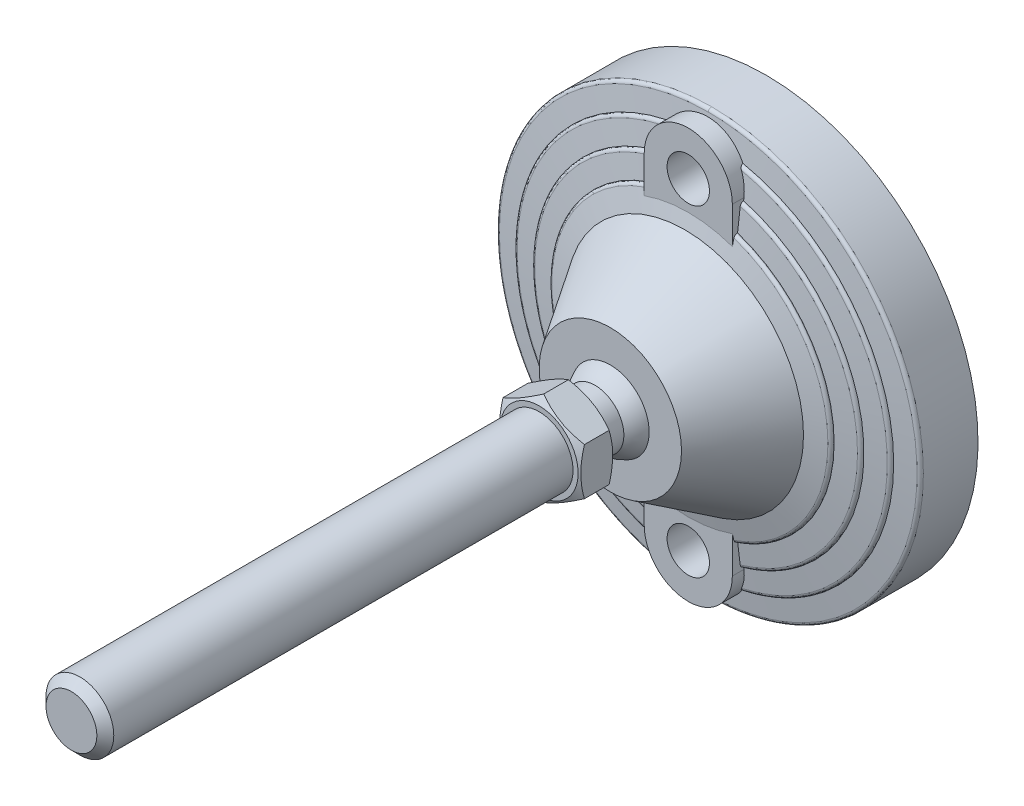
ISO-10303-21;
HEADER;
FILE_DESCRIPTION(('STEP AP214'),'2;1');
FILE_NAME('part.step','',(''),(''),'','','');
FILE_SCHEMA(('AUTOMOTIVE_DESIGN { 1 0 10303 214 1 1 1 1 }'));
ENDSEC;
DATA;
#1=APPLICATION_CONTEXT('core data for automotive mechanical design processes');
#2=APPLICATION_PROTOCOL_DEFINITION('international standard','automotive_design',2000,#1);
#3=PRODUCT_CONTEXT('',#1,'mechanical');
#4=PRODUCT('Part','Part','',(#3));
#5=PRODUCT_RELATED_PRODUCT_CATEGORY('part','',(#4));
#6=PRODUCT_DEFINITION_FORMATION('','',#4);
#7=PRODUCT_DEFINITION_CONTEXT('part definition',#1,'design');
#8=PRODUCT_DEFINITION('design','',#6,#7);
#9=PRODUCT_DEFINITION_SHAPE('','',#8);
#10=(LENGTH_UNIT() NAMED_UNIT(*) SI_UNIT(.MILLI.,.METRE.));
#11=(NAMED_UNIT(*) PLANE_ANGLE_UNIT() SI_UNIT($,.RADIAN.));
#12=(NAMED_UNIT(*) SI_UNIT($,.STERADIAN.) SOLID_ANGLE_UNIT());
#13=UNCERTAINTY_MEASURE_WITH_UNIT(LENGTH_MEASURE(1.E-05),#10,'distance_accuracy_value','');
#14=(GEOMETRIC_REPRESENTATION_CONTEXT(3) GLOBAL_UNCERTAINTY_ASSIGNED_CONTEXT((#13)) GLOBAL_UNIT_ASSIGNED_CONTEXT((#10,
#11,#12)) REPRESENTATION_CONTEXT('',''));
#15=CARTESIAN_POINT('',(0.,0.,0.));
#16=DIRECTION('',(0.,0.,1.));
#17=DIRECTION('',(1.,0.,0.));
#18=AXIS2_PLACEMENT_3D('',#15,#16,#17);
#19=CARTESIAN_POINT('',(-12.,14.022683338,60.));
#20=DIRECTION('',(0.,0.,1.));
#21=DIRECTION('',(0.,-1.,0.));
#22=AXIS2_PLACEMENT_3D('',#19,#20,#21);
#23=PLANE('',#22);
#24=CARTESIAN_POINT('',(0.,0.,60.));
#25=DIRECTION('',(0.,0.,-1.));
#26=DIRECTION('',(0.,1.,0.));
#27=AXIS2_PLACEMENT_3D('',#24,#25,#26);
#28=CIRCLE('',#27,11.5);
#29=CARTESIAN_POINT('',(0.,11.5,60.));
#30=VERTEX_POINT('',#29);
#31=EDGE_CURVE('E212',#30,#30,#28,.T.);
#32=ORIENTED_EDGE('',*,*,#31,.T.);
#33=EDGE_LOOP('',(#32));
#34=FACE_BOUND('',#33,.T.);
#35=CARTESIAN_POINT('',(0.,0.,60.));
#36=DIRECTION('',(0.,0.,-1.));
#37=DIRECTION('',(1.,0.,0.));
#38=AXIS2_PLACEMENT_3D('',#35,#36,#37);
#39=CIRCLE('',#38,8.5);
#40=CARTESIAN_POINT('',(8.5,0.,60.));
#41=VERTEX_POINT('',#40);
#42=EDGE_CURVE('E226',#41,#41,#39,.T.);
#43=ORIENTED_EDGE('',*,*,#42,.F.);
#44=EDGE_LOOP('',(#43));
#45=FACE_BOUND('',#44,.T.);
#46=ADVANCED_FACE('F14',(#34,#45),#23,.F.);
#47=CARTESIAN_POINT('',(0.,0.,60.));
#48=DIRECTION('',(0.,0.,-1.));
#49=DIRECTION('',(1.,0.,0.));
#50=AXIS2_PLACEMENT_3D('',#47,#48,#49);
#51=CYLINDRICAL_SURFACE('',#50,8.5);
#52=CARTESIAN_POINT('',(0.,0.,53.5));
#53=DIRECTION('',(0.,0.,-1.));
#54=DIRECTION('',(1.,0.,0.));
#55=AXIS2_PLACEMENT_3D('',#52,#53,#54);
#56=CIRCLE('',#55,8.5);
#57=CARTESIAN_POINT('',(8.5,0.,53.5));
#58=VERTEX_POINT('',#57);
#59=EDGE_CURVE('E477',#58,#58,#56,.F.);
#60=ORIENTED_EDGE('',*,*,#59,.T.);
#61=EDGE_LOOP('',(#60));
#62=FACE_BOUND('',#61,.T.);
#63=ORIENTED_EDGE('',*,*,#42,.T.);
#64=EDGE_LOOP('',(#63));
#65=FACE_BOUND('',#64,.T.);
#66=ADVANCED_FACE('F1093',(#62,#65),#51,.T.);
#67=CARTESIAN_POINT('',(-55.851524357,55.66,0.));
#68=DIRECTION('',(0.,0.,1.));
#69=DIRECTION('',(0.,-1.,0.));
#70=AXIS2_PLACEMENT_3D('',#67,#68,#69);
#71=PLANE('',#70);
#72=CARTESIAN_POINT('',(0.,0.,0.));
#73=DIRECTION('',(0.,0.,-1.));
#74=DIRECTION('',(0.,1.,0.));
#75=AXIS2_PLACEMENT_3D('',#72,#73,#74);
#76=CIRCLE('',#75,55.);
#77=CARTESIAN_POINT('',(0.,55.,0.));
#78=VERTEX_POINT('',#77);
#79=EDGE_CURVE('E480',#78,#78,#76,.F.);
#80=ORIENTED_EDGE('',*,*,#79,.F.);
#81=EDGE_LOOP('',(#80));
#82=FACE_BOUND('',#81,.T.);
#83=ADVANCED_FACE('F1083',(#82),#71,.F.);
#84=CARTESIAN_POINT('',(-8.631599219,8.622532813,53.5));
#85=DIRECTION('',(0.,0.,1.));
#86=DIRECTION('',(0.,-1.,0.));
#87=AXIS2_PLACEMENT_3D('',#84,#85,#86);
#88=PLANE('',#87);
#89=CARTESIAN_POINT('',(0.,0.,53.5));
#90=DIRECTION('',(0.,0.,-1.));
#91=DIRECTION('',(0.,1.,0.));
#92=AXIS2_PLACEMENT_3D('',#89,#90,#91);
#93=CIRCLE('',#92,8.49107182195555);
#94=CARTESIAN_POINT('',(0.,8.49107182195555,53.5));
#95=VERTEX_POINT('',#94);
#96=EDGE_CURVE('E483',#95,#95,#93,.T.);
#97=ORIENTED_EDGE('',*,*,#96,.F.);
#98=EDGE_LOOP('',(#97));
#99=FACE_BOUND('',#98,.T.);
#100=ORIENTED_EDGE('',*,*,#59,.F.);
#101=EDGE_LOOP('',(#100));
#102=FACE_BOUND('',#101,.T.);
#103=ADVANCED_FACE('F1074',(#99,#102),#88,.F.);
#104=CARTESIAN_POINT('',(0.,0.,3.));
#105=DIRECTION('',(0.,0.,-1.));
#106=DIRECTION('',(0.,1.,0.));
#107=AXIS2_PLACEMENT_3D('',#104,#105,#106);
#108=CYLINDRICAL_SURFACE('',#107,55.);
#109=ORIENTED_EDGE('',*,*,#79,.T.);
#110=EDGE_LOOP('',(#109));
#111=FACE_BOUND('',#110,.T.);
#112=CARTESIAN_POINT('',(0.,0.,3.));
#113=DIRECTION('',(0.,0.,-1.));
#114=DIRECTION('',(0.,1.,0.));
#115=AXIS2_PLACEMENT_3D('',#112,#113,#114);
#116=CIRCLE('',#115,55.);
#117=CARTESIAN_POINT('',(0.,55.,3.));
#118=VERTEX_POINT('',#117);
#119=EDGE_CURVE('E486',#118,#118,#116,.T.);
#120=ORIENTED_EDGE('',*,*,#119,.T.);
#121=EDGE_LOOP('',(#120));
#122=FACE_BOUND('',#121,.T.);
#123=ADVANCED_FACE('F603',(#111,#122),#108,.T.);
#124=CARTESIAN_POINT('',(0.,0.,44.670266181));
#125=DIRECTION('',(0.,0.,-1.));
#126=DIRECTION('',(1.,0.,0.));
#127=AXIS2_PLACEMENT_3D('',#124,#125,#126);
#128=SPHERICAL_SURFACE('',#127,12.25);
#129=CARTESIAN_POINT('',(0.,0.,49.));
#130=DIRECTION('',(0.,0.,-1.));
#131=DIRECTION('',(0.,1.,0.));
#132=AXIS2_PLACEMENT_3D('',#129,#130,#131);
#133=CIRCLE('',#132,11.4593152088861);
#134=CARTESIAN_POINT('',(0.,11.4593152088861,49.));
#135=VERTEX_POINT('',#134);
#136=EDGE_CURVE('E489',#135,#135,#133,.F.);
#137=ORIENTED_EDGE('',*,*,#136,.T.);
#138=EDGE_LOOP('',(#137));
#139=FACE_BOUND('',#138,.T.);
#140=ORIENTED_EDGE('',*,*,#96,.T.);
#141=EDGE_LOOP('',(#140));
#142=FACE_BOUND('',#141,.T.);
#143=ADVANCED_FACE('F598',(#139,#142),#128,.T.);
#144=CARTESIAN_POINT('',(-6.346764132,-41.175,3.));
#145=DIRECTION('',(0.,0.,1.));
#146=DIRECTION('',(0.,-1.,0.));
#147=AXIS2_PLACEMENT_3D('',#144,#145,#146);
#148=PLANE('',#147);
#149=CARTESIAN_POINT('',(0.,-47.5,3.));
#150=DIRECTION('',(0.,0.,1.));
#151=DIRECTION('',(0.,-1.,0.));
#152=AXIS2_PLACEMENT_3D('',#149,#150,#151);
#153=CIRCLE('',#152,6.25);
#154=CARTESIAN_POINT('',(0.,-53.75,3.));
#155=VERTEX_POINT('',#154);
#156=EDGE_CURVE('E451',#155,#155,#153,.T.);
#157=ORIENTED_EDGE('',*,*,#156,.T.);
#158=EDGE_LOOP('',(#157));
#159=FACE_BOUND('',#158,.T.);
#160=ADVANCED_FACE('F602',(#159),#148,.T.);
#161=CARTESIAN_POINT('',(-63.467641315,63.25,3.));
#162=DIRECTION('',(0.,0.,1.));
#163=DIRECTION('',(0.,-1.,0.));
#164=AXIS2_PLACEMENT_3D('',#161,#162,#163);
#165=PLANE('',#164);
#166=ORIENTED_EDGE('',*,*,#119,.F.);
#167=EDGE_LOOP('',(#166));
#168=FACE_BOUND('',#167,.T.);
#169=CARTESIAN_POINT('',(0.,0.,3.));
#170=DIRECTION('',(0.,0.,-1.));
#171=DIRECTION('',(0.,1.,0.));
#172=AXIS2_PLACEMENT_3D('',#169,#170,#171);
#173=CIRCLE('',#172,62.5);
#174=CARTESIAN_POINT('',(0.,62.5,3.));
#175=VERTEX_POINT('',#174);
#176=EDGE_CURVE('E414',#175,#175,#173,.F.);
#177=ORIENTED_EDGE('',*,*,#176,.F.);
#178=EDGE_LOOP('',(#177));
#179=FACE_BOUND('',#178,.T.);
#180=ADVANCED_FACE('F1054',(#168,#179),#165,.F.);
#181=CARTESIAN_POINT('',(-21.325127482,-21.252,49.));
#182=DIRECTION('',(0.,0.,-1.));
#183=DIRECTION('',(0.,1.,0.));
#184=AXIS2_PLACEMENT_3D('',#181,#182,#183);
#185=PLANE('',#184);
#186=ORIENTED_EDGE('',*,*,#136,.F.);
#187=EDGE_LOOP('',(#186));
#188=FACE_BOUND('',#187,.T.);
#189=CARTESIAN_POINT('',(0.,0.,49.));
#190=DIRECTION('',(0.,0.,-1.));
#191=DIRECTION('',(1.,0.,0.));
#192=AXIS2_PLACEMENT_3D('',#189,#190,#191);
#193=CIRCLE('',#192,21.);
#194=CARTESIAN_POINT('',(21.,0.,49.));
#195=VERTEX_POINT('',#194);
#196=EDGE_CURVE('E588',#195,#195,#193,.T.);
#197=ORIENTED_EDGE('',*,*,#196,.F.);
#198=EDGE_LOOP('',(#197));
#199=FACE_BOUND('',#198,.T.);
#200=ADVANCED_FACE('F608',(#188,#199),#185,.F.);
#201=CARTESIAN_POINT('',(0.,-47.5,3.));
#202=DIRECTION('',(0.,0.,1.));
#203=DIRECTION('',(0.,-1.,0.));
#204=AXIS2_PLACEMENT_3D('',#201,#202,#203);
#205=CYLINDRICAL_SURFACE('',#204,6.25);
#206=ORIENTED_EDGE('',*,*,#156,.F.);
#207=EDGE_LOOP('',(#206));
#208=FACE_BOUND('',#207,.T.);
#209=CARTESIAN_POINT('',(0.,-47.5,26.));
#210=DIRECTION('',(0.,0.,1.));
#211=DIRECTION('',(0.,-1.,0.));
#212=AXIS2_PLACEMENT_3D('',#209,#210,#211);
#213=CIRCLE('',#212,6.25);
#214=CARTESIAN_POINT('',(0.,-53.75,26.));
#215=VERTEX_POINT('',#214);
#216=EDGE_CURVE('E587',#215,#215,#213,.T.);
#217=ORIENTED_EDGE('',*,*,#216,.T.);
#218=EDGE_LOOP('',(#217));
#219=FACE_BOUND('',#218,.T.);
#220=ADVANCED_FACE('F606',(#208,#219),#205,.F.);
#221=CARTESIAN_POINT('',(-6.346764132,53.825,3.));
#222=DIRECTION('',(0.,0.,1.));
#223=DIRECTION('',(0.,-1.,0.));
#224=AXIS2_PLACEMENT_3D('',#221,#222,#223);
#225=PLANE('',#224);
#226=CARTESIAN_POINT('',(0.,47.5,3.));
#227=DIRECTION('',(0.,0.,1.));
#228=DIRECTION('',(0.,-1.,0.));
#229=AXIS2_PLACEMENT_3D('',#226,#227,#228);
#230=CIRCLE('',#229,6.25);
#231=CARTESIAN_POINT('',(0.,41.25,3.));
#232=VERTEX_POINT('',#231);
#233=EDGE_CURVE('E239',#232,#232,#230,.T.);
#234=ORIENTED_EDGE('',*,*,#233,.T.);
#235=EDGE_LOOP('',(#234));
#236=FACE_BOUND('',#235,.T.);
#237=ADVANCED_FACE('F335',(#236),#225,.T.);
#238=CARTESIAN_POINT('',(12.406354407,39.602176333,24.568111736));
#239=CARTESIAN_POINT('',(59.707464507,24.78394183,24.568111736));
#240=CARTESIAN_POINT('',(59.707464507,-24.78394183,24.568111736));
#241=CARTESIAN_POINT('',(12.406354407,-39.602176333,24.568111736));
#242=CARTESIAN_POINT('',(12.406354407,39.602176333,25.044046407));
#243=CARTESIAN_POINT('',(59.707464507,24.78394183,25.044046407));
#244=CARTESIAN_POINT('',(59.707464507,-24.78394183,25.044046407));
#245=CARTESIAN_POINT('',(12.406354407,-39.602176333,25.044046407));
#246=CARTESIAN_POINT('',(12.31903347,39.323440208,25.419805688));
#247=CARTESIAN_POINT('',(59.287219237,24.609502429,25.419805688));
#248=CARTESIAN_POINT('',(59.287219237,-24.609502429,25.419805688));
#249=CARTESIAN_POINT('',(12.31903347,-39.323440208,25.419805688));
#250=CARTESIAN_POINT('',(12.18115046,38.883305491,25.53720891));
#251=CARTESIAN_POINT('',(58.623636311,24.334056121,25.53720891));
#252=CARTESIAN_POINT('',(58.623636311,-24.334056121,25.53720891));
#253=CARTESIAN_POINT('',(12.18115046,-38.883305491,25.53720891));
#254=(BOUNDED_SURFACE() B_SPLINE_SURFACE(3,3,((#238,#239,#240,#241),(#242,#243,#244,#245),(#246,
#247,#248,#249),(#250,#251,#252,#253)),.UNSPECIFIED.,.F.,.F.,
.F.) B_SPLINE_SURFACE_WITH_KNOTS((4,4),(4,4),(0.,1.),(0.,1.),
.UNSPECIFIED.) GEOMETRIC_REPRESENTATION_ITEM() RATIONAL_B_SPLINE_SURFACE(((1.,0.532632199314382,
0.532632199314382,1.),(0.859679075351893,0.457892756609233,0.457892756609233,0.859679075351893),
(0.859679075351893,0.457892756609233,0.457892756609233,0.859679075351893),(1.,0.532632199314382,
0.532632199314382,1.))) REPRESENTATION_ITEM('') SURFACE());
#255=CARTESIAN_POINT('',(0.,0.,25.5372089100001));
#256=DIRECTION('',(0.,0.,-1.));
#257=DIRECTION('',(0.,1.,0.));
#258=AXIS2_PLACEMENT_3D('',#255,#256,#257);
#259=CIRCLE('',#258,40.746679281);
#260=CARTESIAN_POINT('',(13.,-38.6172483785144,25.537208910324));
#261=VERTEX_POINT('',#260);
#262=CARTESIAN_POINT('',(13.,38.6172483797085,25.5372089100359));
#263=VERTEX_POINT('',#262);
#264=EDGE_CURVE('E452',#261,#263,#259,.F.);
#265=CARTESIAN_POINT('',(13.,-39.4112927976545,24.5681117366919));
#266=CARTESIAN_POINT('',(13.,-39.4112933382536,24.59521048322));
#267=CARTESIAN_POINT('',(13.,-39.4101321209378,24.6222958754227));
#268=CARTESIAN_POINT('',(13.,-39.405504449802,24.6762650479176));
#269=CARTESIAN_POINT('',(13.,-39.4020383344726,24.7031488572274));
#270=CARTESIAN_POINT('',(13.,-39.3882336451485,24.7831079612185));
#271=CARTESIAN_POINT('',(13.,-39.3744885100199,24.8356344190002));
#272=CARTESIAN_POINT('',(13.,-39.3384084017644,24.937608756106));
#273=CARTESIAN_POINT('',(13.,-39.3160736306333,24.9870567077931));
#274=CARTESIAN_POINT('',(13.,-39.263590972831,25.0816017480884));
#275=CARTESIAN_POINT('',(13.,-39.233444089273,25.1266993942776));
#276=CARTESIAN_POINT('',(13.,-39.1656058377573,25.2123360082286));
#277=CARTESIAN_POINT('',(13.,-39.1277714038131,25.2527614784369));
#278=CARTESIAN_POINT('',(13.,-39.0461074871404,25.327071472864));
#279=CARTESIAN_POINT('',(13.,-39.0022718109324,25.3609491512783));
#280=CARTESIAN_POINT('',(13.,-38.9043172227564,25.4250520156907));
#281=CARTESIAN_POINT('',(13.,-38.8495953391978,25.454364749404));
#282=CARTESIAN_POINT('',(13.,-38.7644641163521,25.4909906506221));
#283=CARTESIAN_POINT('',(13.,-38.7355751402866,25.5019763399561));
#284=CARTESIAN_POINT('',(13.,-38.6769796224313,25.5214626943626));
#285=CARTESIAN_POINT('',(13.,-38.6472733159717,25.5299640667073));
#286=CARTESIAN_POINT('',(13.,-38.6172483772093,25.5372089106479));
#287=B_SPLINE_CURVE_WITH_KNOTS('',3,(#265,#266,#267,#268,#269,#270,#271,#272,#273,#274,#275,
#276,#277,#278,#279,#280,#281,#282,#283,#284,#285,#286),.UNSPECIFIED.,.F.,.F.,(4,2,2,2,2,2,2,2,
2,2,4),(0.,0.0812450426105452,0.162478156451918,0.32451953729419,0.486557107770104,
0.648573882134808,0.813939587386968,0.979477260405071,1.16468654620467,1.25731455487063,
1.34991616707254),.UNSPECIFIED.);
#288=CARTESIAN_POINT('',(13.,-39.4112927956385,24.568111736));
#289=VERTEX_POINT('',#288);
#290=EDGE_CURVE('E321',#289,#261,#287,.T.);
#291=CARTESIAN_POINT('',(0.,0.,24.568111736));
#292=DIRECTION('',(0.,0.,-1.));
#293=DIRECTION('',(0.,1.,0.));
#294=AXIS2_PLACEMENT_3D('',#291,#292,#293);
#295=CIRCLE('',#294,41.5);
#296=CARTESIAN_POINT('',(13.,39.4112927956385,24.5681117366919));
#297=VERTEX_POINT('',#296);
#298=EDGE_CURVE('E449',#297,#289,#295,.T.);
#299=CARTESIAN_POINT('',(13.,38.6172483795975,25.5372089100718));
#300=CARTESIAN_POINT('',(13.,38.6757273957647,25.5231434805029));
#301=CARTESIAN_POINT('',(13.,38.7330575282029,25.5042077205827));
#302=CARTESIAN_POINT('',(13.,38.843898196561,25.4570874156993));
#303=CARTESIAN_POINT('',(13.,38.8974017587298,25.4288864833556));
#304=CARTESIAN_POINT('',(13.,38.9989209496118,25.3637346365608));
#305=CARTESIAN_POINT('',(13.,39.0469285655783,25.3267711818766));
#306=CARTESIAN_POINT('',(13.,39.1357078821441,25.2450475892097));
#307=CARTESIAN_POINT('',(13.,39.1764870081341,25.2002955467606));
#308=CARTESIAN_POINT('',(13.,39.2479885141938,25.1059931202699));
#309=CARTESIAN_POINT('',(13.,39.2790300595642,25.0566848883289));
#310=CARTESIAN_POINT('',(13.,39.3318958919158,24.9533393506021));
#311=CARTESIAN_POINT('',(13.,39.3537228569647,24.8993034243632));
#312=CARTESIAN_POINT('',(13.,39.3839717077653,24.7991363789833));
#313=CARTESIAN_POINT('',(13.,39.3941848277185,24.7535382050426));
#314=CARTESIAN_POINT('',(13.,39.4078594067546,24.6613400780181));
#315=CARTESIAN_POINT('',(13.,39.411320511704,24.6147400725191));
#316=CARTESIAN_POINT('',(13.,39.4112927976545,24.5681117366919));
#317=B_SPLINE_CURVE_WITH_KNOTS('',3,(#299,#300,#301,#302,#303,#304,#305,#306,#307,#308,#309,
#310,#311,#312,#313,#314,#315,#316),.UNSPECIFIED.,.F.,.F.,(4,2,2,2,2,2,2,2,4),(0.,
0.180276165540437,0.360872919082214,0.541729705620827,0.722399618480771,0.89631033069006,
1.07017046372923,1.20986980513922,1.34957647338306),.UNSPECIFIED.);
#318=EDGE_CURVE('E238',#263,#297,#317,.T.);
#319=ORIENTED_EDGE('',*,*,#264,.F.);
#320=ORIENTED_EDGE('',*,*,#290,.F.);
#321=ORIENTED_EDGE('',*,*,#298,.F.);
#322=ORIENTED_EDGE('',*,*,#318,.F.);
#323=EDGE_LOOP('',(#319,#320,#321,#322));
#324=FACE_BOUND('',#323,.T.);
#325=ADVANCED_FACE('F610',(#324),#254,.T.);
#326=CARTESIAN_POINT('',(0.,0.,24.568111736));
#327=DIRECTION('',(0.,0.,-1.));
#328=DIRECTION('',(0.,1.,0.));
#329=AXIS2_PLACEMENT_3D('',#326,#327,#328);
#330=CYLINDRICAL_SURFACE('',#329,41.5);
#331=CARTESIAN_POINT('',(0.,0.,24.454545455));
#332=DIRECTION('',(0.,0.,-1.));
#333=DIRECTION('',(0.,1.,0.));
#334=AXIS2_PLACEMENT_3D('',#331,#332,#333);
#335=CIRCLE('',#334,41.5);
#336=CARTESIAN_POINT('',(13.,39.4112927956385,24.454545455));
#337=VERTEX_POINT('',#336);
#338=CARTESIAN_POINT('',(13.,-39.4112927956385,24.4545454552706));
#339=VERTEX_POINT('',#338);
#340=EDGE_CURVE('E447',#337,#339,#335,.T.);
#341=ORIENTED_EDGE('',*,*,#340,.F.);
#342=DIRECTION('',(0.,0.,-1.));
#343=VECTOR('',#342,1.);
#344=CARTESIAN_POINT('',(13.,39.4112927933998,24.2785712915));
#345=LINE('',#344,#343);
#346=EDGE_CURVE('E291',#297,#337,#345,.T.);
#347=ORIENTED_EDGE('',*,*,#346,.F.);
#348=ORIENTED_EDGE('',*,*,#298,.T.);
#349=DIRECTION('',(0.,0.,1.));
#350=VECTOR('',#349,1.);
#351=CARTESIAN_POINT('',(13.,-39.4112927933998,24.2785712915));
#352=LINE('',#351,#350);
#353=EDGE_CURVE('E319',#339,#289,#352,.T.);
#354=ORIENTED_EDGE('',*,*,#353,.F.);
#355=EDGE_LOOP('',(#341,#347,#348,#354));
#356=FACE_BOUND('',#355,.T.);
#357=ADVANCED_FACE('F303',(#356),#330,.T.);
#358=CARTESIAN_POINT('',(0.,0.,24.454545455));
#359=DIRECTION('',(0.,0.,-1.));
#360=DIRECTION('',(0.,1.,0.));
#361=AXIS2_PLACEMENT_3D('',#358,#359,#360);
#362=CONICAL_SURFACE('',#361,41.5,1.4442041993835);
#363=ORIENTED_EDGE('',*,*,#340,.T.);
#364=CARTESIAN_POINT('',(13.0000000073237,-45.8176832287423,23.6748403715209));
#365=CARTESIAN_POINT('',(13.0000000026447,-45.2838642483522,23.7402005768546));
#366=CARTESIAN_POINT('',(13.000000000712,-44.7500350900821,23.8054777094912));
#367=CARTESIAN_POINT('',(12.999999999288,-43.6823542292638,23.9358466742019));
#368=CARTESIAN_POINT('',(12.9999999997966,-43.1485025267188,24.0009385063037));
#369=CARTESIAN_POINT('',(13.0000000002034,-42.0807742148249,24.1309177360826));
#370=CARTESIAN_POINT('',(13.0000000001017,-41.5468976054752,24.195805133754));
#371=CARTESIAN_POINT('',(12.9999999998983,-40.4791166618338,24.3253520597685));
#372=CARTESIAN_POINT('',(12.9999999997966,-39.9452123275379,24.3900115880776));
#373=CARTESIAN_POINT('',(13.,-39.4112927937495,24.4545454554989));
#374=B_SPLINE_CURVE_WITH_KNOTS('',3,(#364,#365,#366,#367,#368,#369,#370,#371,#372,#373),
.UNSPECIFIED.,.F.,.F.,(4,2,2,2,4),(0.,1.61341623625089,3.22683223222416,4.84024827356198,
6.4536645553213),.UNSPECIFIED.);
#375=CARTESIAN_POINT('',(13.,-45.8176832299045,23.674840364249));
#376=VERTEX_POINT('',#375);
#377=EDGE_CURVE('E311',#376,#339,#374,.T.);
#378=ORIENTED_EDGE('',*,*,#377,.F.);
#379=CARTESIAN_POINT('',(-7.48558333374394E-10,0.,23.674840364));
#380=DIRECTION('',(0.,0.,-1.));
#381=DIRECTION('',(0.,1.,0.));
#382=AXIS2_PLACEMENT_3D('',#379,#380,#381);
#383=CIRCLE('',#382,47.6262542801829);
#384=CARTESIAN_POINT('',(13.,45.8176832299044,23.6748403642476));
#385=VERTEX_POINT('',#384);
#386=EDGE_CURVE('E412',#385,#376,#383,.T.);
#387=ORIENTED_EDGE('',*,*,#386,.F.);
#388=CARTESIAN_POINT('',(13.,39.4112927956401,24.4545454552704));
#389=CARTESIAN_POINT('',(13.,39.9452123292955,24.3900115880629));
#390=CARTESIAN_POINT('',(13.,40.4791166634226,24.3253520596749));
#391=CARTESIAN_POINT('',(13.,41.5468976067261,24.195805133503));
#392=CARTESIAN_POINT('',(13.,42.0807742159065,24.1309177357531));
#393=CARTESIAN_POINT('',(13.,43.1485025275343,24.0009385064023));
#394=CARTESIAN_POINT('',(13.,43.6823542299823,23.9358466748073));
#395=CARTESIAN_POINT('',(13.,44.7500350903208,23.805477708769));
#396=CARTESIAN_POINT('',(13.,45.283864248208,23.7402005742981));
#397=CARTESIAN_POINT('',(13.,45.8176832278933,23.6748403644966));
#398=B_SPLINE_CURVE_WITH_KNOTS('',3,(#388,#389,#390,#391,#392,#393,#394,#395,#396,#397),
.UNSPECIFIED.,.F.,.F.,(4,2,2,2,4),(0.,1.61341628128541,3.22683232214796,4.84024831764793,
6.45366455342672),.UNSPECIFIED.);
#399=EDGE_CURVE('E283',#337,#385,#398,.T.);
#400=ORIENTED_EDGE('',*,*,#399,.F.);
#401=EDGE_LOOP('',(#363,#378,#387,#400));
#402=FACE_BOUND('',#401,.T.);
#403=ADVANCED_FACE('F298',(#402),#362,.T.);
#404=CARTESIAN_POINT('',(12.269850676,46.922284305,22.669623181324));
#405=CARTESIAN_POINT('',(72.557631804,31.157449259,22.669623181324));
#406=CARTESIAN_POINT('',(72.557631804,-31.157449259,22.669623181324));
#407=CARTESIAN_POINT('',(12.269850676,-46.922284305,22.669623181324));
#408=CARTESIAN_POINT('',(12.269850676,46.922284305,22.6740296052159));
#409=CARTESIAN_POINT('',(72.557631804,31.157449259,22.674029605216));
#410=CARTESIAN_POINT('',(72.557631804,-31.157449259,22.674029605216));
#411=CARTESIAN_POINT('',(12.269850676,-46.922284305,22.6740296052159));
#412=CARTESIAN_POINT('',(12.269850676,46.922284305,22.678436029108));
#413=CARTESIAN_POINT('',(72.557631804,31.157449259,22.678436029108));
#414=CARTESIAN_POINT('',(72.557631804,-31.157449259,22.678436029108));
#415=CARTESIAN_POINT('',(12.269850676,-46.922284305,22.678436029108));
#416=CARTESIAN_POINT('',(12.269850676,46.922284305,22.682842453));
#417=CARTESIAN_POINT('',(72.557631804,31.157449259,22.682842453));
#418=CARTESIAN_POINT('',(72.557631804,-31.157449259,22.682842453));
#419=CARTESIAN_POINT('',(12.269850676,-46.922284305,22.682842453));
#420=CARTESIAN_POINT('',(12.269850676,46.922284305,23.211436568));
#421=CARTESIAN_POINT('',(72.557631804,31.157449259,23.211436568));
#422=CARTESIAN_POINT('',(72.557631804,-31.157449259,23.211436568));
#423=CARTESIAN_POINT('',(12.269850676,-46.922284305,23.211436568));
#424=CARTESIAN_POINT('',(12.181461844,46.584268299,23.608103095));
#425=CARTESIAN_POINT('',(72.034945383,30.93299905,23.608103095));
#426=CARTESIAN_POINT('',(72.034945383,-30.93299905,23.608103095));
#427=CARTESIAN_POINT('',(12.181461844,-46.584268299,23.608103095));
#428=CARTESIAN_POINT('',(12.048804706,46.076961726,23.674840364));
#429=CARTESIAN_POINT('',(71.250478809,30.596136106,23.674840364));
#430=CARTESIAN_POINT('',(71.250478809,-30.596136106,23.674840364));
#431=CARTESIAN_POINT('',(12.048804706,-46.076961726,23.674840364));
#432=(BOUNDED_SURFACE() B_SPLINE_SURFACE(3,3,((#404,#405,#406,#407),(#408,#409,#410,#411),(#412,
#413,#414,#415),(#416,#417,#418,#419),(#420,#421,#422,#423),(#424,#425,#426,#427),(#428,#429,
#430,#431)),.UNSPECIFIED.,.F.,.F.,.F.) B_SPLINE_SURFACE_WITH_KNOTS((4,3,4),(4,4),(-0.01,0.,1.),
(0.,1.),.UNSPECIFIED.) GEOMETRIC_REPRESENTATION_ITEM() RATIONAL_B_SPLINE_SURFACE(((1.,
0.501991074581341,0.501991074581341,1.),(1.,0.501991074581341,0.501991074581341,1.),(1.,
0.501991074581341,0.501991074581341,1.),(1.,0.501991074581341,0.501991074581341,1.),
(0.833611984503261,0.418465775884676,0.418465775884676,0.833611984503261),(0.833611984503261,
0.418465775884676,0.418465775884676,0.833611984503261),(1.,0.501991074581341,0.501991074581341,1.))) REPRESENTATION_ITEM('') SURFACE());
#433=CARTESIAN_POINT('',(13.,-46.7252608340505,22.6777848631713));
#434=CARTESIAN_POINT('',(13.,-46.7253979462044,22.7054287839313));
#435=CARTESIAN_POINT('',(13.,-46.7243484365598,22.7330653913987));
#436=CARTESIAN_POINT('',(13.,-46.7198870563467,22.7881439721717));
#437=CARTESIAN_POINT('',(13.,-46.7164754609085,22.8155859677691));
#438=CARTESIAN_POINT('',(13.,-46.7027375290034,22.8972169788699));
#439=CARTESIAN_POINT('',(13.,-46.688908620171,22.9508576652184));
#440=CARTESIAN_POINT('',(13.,-46.6523707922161,23.0550506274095));
#441=CARTESIAN_POINT('',(13.,-46.6296523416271,23.1055995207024));
#442=CARTESIAN_POINT('',(13.,-46.5760978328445,23.2021956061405));
#443=CARTESIAN_POINT('',(13.,-46.545261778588,23.248242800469));
#444=CARTESIAN_POINT('',(13.,-46.4762858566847,23.3348542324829));
#445=CARTESIAN_POINT('',(13.,-46.438110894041,23.3753904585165));
#446=CARTESIAN_POINT('',(13.,-46.3556866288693,23.4497572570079));
#447=CARTESIAN_POINT('',(13.,-46.3114344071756,23.4835845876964));
#448=CARTESIAN_POINT('',(13.,-46.2164675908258,23.5448274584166));
#449=CARTESIAN_POINT('',(13.,-46.1655796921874,23.5719736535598));
#450=CARTESIAN_POINT('',(13.,-46.0601083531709,23.6176355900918));
#451=CARTESIAN_POINT('',(13.,-46.0055288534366,23.6361603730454));
#452=CARTESIAN_POINT('',(13.,-45.9281089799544,23.6556819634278));
#453=CARTESIAN_POINT('',(13.,-45.9061721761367,23.660484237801));
#454=CARTESIAN_POINT('',(13.,-45.8620822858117,23.6686997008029));
#455=CARTESIAN_POINT('',(13.,-45.8399296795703,23.6721154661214));
#456=CARTESIAN_POINT('',(13.0000000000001,-45.817683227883,23.6748403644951));
#457=B_SPLINE_CURVE_WITH_KNOTS('',3,(#433,#434,#435,#436,#437,#438,#439,#440,#441,#442,#443,
#444,#445,#446,#447,#448,#449,#450,#451,#452,#453,#454,#455,#456),.UNSPECIFIED.,.F.,.F.,(4,2,2,
2,2,2,2,2,2,2,2,4),(0.,0.0828810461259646,0.165752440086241,0.331061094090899,0.496547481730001,
0.662033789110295,0.828332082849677,0.994710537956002,1.16697834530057,1.33906508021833,
1.40639957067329,1.47360834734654),.UNSPECIFIED.);
#458=CARTESIAN_POINT('',(13.0000000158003,-46.7252608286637,22.6777848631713));
#459=VERTEX_POINT('',#458);
#460=EDGE_CURVE('E320',#459,#376,#457,.T.);
#461=CARTESIAN_POINT('',(13.0000000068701,46.7252608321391,22.6727272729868));
#462=CARTESIAN_POINT('',(13.3212147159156,46.635891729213,22.6727272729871));
#463=CARTESIAN_POINT('',(13.6414983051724,46.5432129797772,22.6727272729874));
#464=CARTESIAN_POINT('',(14.2801231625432,46.3512597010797,22.672727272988));
#465=CARTESIAN_POINT('',(14.5984642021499,46.2519844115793,22.6727272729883));
#466=CARTESIAN_POINT('',(15.5526106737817,45.9435979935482,22.6727272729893));
#467=CARTESIAN_POINT('',(16.1852411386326,45.7245656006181,22.6727272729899));
#468=CARTESIAN_POINT('',(17.4409289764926,45.2604918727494,22.6727272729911));
#469=CARTESIAN_POINT('',(18.0639854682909,45.01544815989,22.6727272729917));
#470=CARTESIAN_POINT('',(19.3000708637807,44.4995075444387,22.672727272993));
#471=CARTESIAN_POINT('',(19.9130888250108,44.228584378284,22.6727272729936));
#472=CARTESIAN_POINT('',(21.1274202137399,43.6615551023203,22.6727272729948));
#473=CARTESIAN_POINT('',(21.7287319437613,43.3654453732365,22.6727272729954));
#474=CARTESIAN_POINT('',(23.5288179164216,42.4321391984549,22.6727272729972));
#475=CARTESIAN_POINT('',(24.7079785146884,41.7565378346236,22.6727272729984));
#476=CARTESIAN_POINT('',(27.0057517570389,40.308619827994,22.6727272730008));
#477=CARTESIAN_POINT('',(28.1243409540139,39.5362661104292,22.672727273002));
#478=CARTESIAN_POINT('',(30.294054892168,37.8994558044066,22.6727272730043));
#479=CARTESIAN_POINT('',(31.3451007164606,37.0348945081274,22.6727272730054));
#480=CARTESIAN_POINT('',(33.3707378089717,35.2206260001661,22.6727272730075));
#481=CARTESIAN_POINT('',(34.3453363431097,34.2709268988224,22.6727272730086));
#482=CARTESIAN_POINT('',(36.2141318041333,32.2900336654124,22.6727272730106));
#483=CARTESIAN_POINT('',(37.1080775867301,31.258602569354,22.6727272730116));
#484=CARTESIAN_POINT('',(38.8059105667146,29.1240638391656,22.6727272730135));
#485=CARTESIAN_POINT('',(39.6097954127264,28.0209543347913,22.6727272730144));
#486=CARTESIAN_POINT('',(41.1215543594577,25.7512426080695,22.6727272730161));
#487=CARTESIAN_POINT('',(41.8294551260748,24.5846581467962,22.6727272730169));
#488=CARTESIAN_POINT('',(43.1444737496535,22.1960153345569,22.6727272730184));
#489=CARTESIAN_POINT('',(43.7515922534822,20.9739573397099,22.6727272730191));
#490=CARTESIAN_POINT('',(44.8608053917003,18.482892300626,22.6727272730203));
#491=CARTESIAN_POINT('',(45.362887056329,17.2138794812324,22.6727272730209));
#492=CARTESIAN_POINT('',(46.2583633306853,14.6380667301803,22.6727272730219));
#493=CARTESIAN_POINT('',(46.6517577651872,13.331266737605,22.6727272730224));
#494=CARTESIAN_POINT('',(47.3270705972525,10.6891374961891,22.6727272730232));
#495=CARTESIAN_POINT('',(47.6089860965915,9.3538075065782,22.6727272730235));
#496=CARTESIAN_POINT('',(48.0593220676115,6.66414532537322,22.672727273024));
#497=CARTESIAN_POINT('',(48.2277425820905,5.30981314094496,22.6727272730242));
#498=CARTESIAN_POINT('',(48.4498861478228,2.5918387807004,22.6727272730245));
#499=CARTESIAN_POINT('',(48.5036145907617,1.2281970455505,22.6727272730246));
#500=CARTESIAN_POINT('',(48.4960080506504,-1.49876561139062,22.6727272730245));
#501=CARTESIAN_POINT('',(48.4346730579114,-2.86208653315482,22.6727272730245));
#502=CARTESIAN_POINT('',(48.1973677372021,-5.57880747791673,22.6727272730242));
#503=CARTESIAN_POINT('',(48.021389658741,-6.93220682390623,22.672727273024));
#504=CARTESIAN_POINT('',(47.5560413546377,-9.61936956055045,22.6727272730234));
#505=CARTESIAN_POINT('',(47.2666711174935,-10.9531329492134,22.6727272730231));
#506=CARTESIAN_POINT('',(46.5765756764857,-13.5916227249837,22.6727272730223));
#507=CARTESIAN_POINT('',(46.1758433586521,-14.8963472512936,22.6727272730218));
#508=CARTESIAN_POINT('',(45.2658742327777,-17.467402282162,22.6727272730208));
#509=CARTESIAN_POINT('',(44.7566374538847,-18.7337327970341,22.6727272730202));
#510=CARTESIAN_POINT('',(43.6334165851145,-21.218718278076,22.6727272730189));
#511=CARTESIAN_POINT('',(43.0194530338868,-22.4373825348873,22.6727272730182));
#512=CARTESIAN_POINT('',(41.6909757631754,-24.8187625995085,22.6727272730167));
#513=CARTESIAN_POINT('',(40.9764619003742,-25.9814783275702,22.6727272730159));
#514=CARTESIAN_POINT('',(39.7063025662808,-27.8655028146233,22.6727272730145));
#515=CARTESIAN_POINT('',(39.1770724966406,-28.6047764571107,22.6727272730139));
#516=CARTESIAN_POINT('',(38.0778809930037,-30.052466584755,22.6727272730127));
#517=CARTESIAN_POINT('',(37.5079195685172,-30.7608830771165,22.6727272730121));
#518=CARTESIAN_POINT('',(36.3291070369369,-32.1445499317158,22.6727272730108));
#519=CARTESIAN_POINT('',(35.7202564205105,-32.8198007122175,22.6727272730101));
#520=CARTESIAN_POINT('',(34.4653645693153,-34.1352484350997,22.6727272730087));
#521=CARTESIAN_POINT('',(33.8193109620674,-34.7754335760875,22.672727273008));
#522=CARTESIAN_POINT('',(32.4922294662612,-36.0184899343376,22.6727272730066));
#523=CARTESIAN_POINT('',(31.8112009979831,-36.6213605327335,22.6727272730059));
#524=CARTESIAN_POINT('',(30.4163089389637,-37.7878929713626,22.6727272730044));
#525=CARTESIAN_POINT('',(29.7024437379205,-38.351552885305,22.6727272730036));
#526=CARTESIAN_POINT('',(28.1769516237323,-39.4879139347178,22.672727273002));
#527=CARTESIAN_POINT('',(27.3623770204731,-40.0566641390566,22.6727272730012));
#528=CARTESIAN_POINT('',(25.6997855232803,-41.1431320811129,22.6727272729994));
#529=CARTESIAN_POINT('',(24.8517655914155,-41.6608451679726,22.6727272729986));
#530=CARTESIAN_POINT('',(23.1254909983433,-42.6432641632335,22.6727272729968));
#531=CARTESIAN_POINT('',(22.2472346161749,-43.1079670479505,22.6727272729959));
#532=CARTESIAN_POINT('',(20.462387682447,-43.9832963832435,22.6727272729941));
#533=CARTESIAN_POINT('',(19.5557530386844,-44.3938329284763,22.6727272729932));
#534=CARTESIAN_POINT('',(17.7189637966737,-45.1583612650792,22.6727272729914));
#535=CARTESIAN_POINT('',(16.7888095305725,-45.5123538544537,22.6727272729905));
#536=CARTESIAN_POINT('',(14.9085132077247,-46.1625049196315,22.6727272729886));
#537=CARTESIAN_POINT('',(13.9583713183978,-46.4586638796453,22.6727272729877));
#538=CARTESIAN_POINT('',(13.0000000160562,-46.7252608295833,22.6727272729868));
#539=B_SPLINE_CURVE_WITH_KNOTS('',3,(#461,#462,#463,#464,#465,#466,#467,#468,#469,#470,#471,
#472,#473,#474,#475,#476,#477,#478,#479,#480,#481,#482,#483,#484,#485,#486,#487,#488,#489,#490,
#491,#492,#493,#494,#495,#496,#497,#498,#499,#500,#501,#502,#503,#504,#505,#506,#507,#508,#509,
#510,#511,#512,#513,#514,#515,#516,#517,#518,#519,#520,#521,#522,#523,#524,#525,#526,#527,#528,
#529,#530,#531,#532,#533,#534,#535,#536,#537,#538),.UNSPECIFIED.,.F.,.F.,(4,2,2,2,2,2,2,2,2,2,2,
2,2,2,2,2,2,2,2,2,2,2,2,2,2,2,2,2,2,2,2,2,2,2,2,2,2,2,4),(0.,1.00020816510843,2.00053180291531,
4.00833027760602,6.01631246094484,8.02635452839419,10.0366859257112,14.1084282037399,
18.1817355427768,22.2597186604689,26.3373137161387,30.4271967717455,34.5171865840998,
38.6060377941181,42.6948627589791,46.7841923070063,50.8735284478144,54.9629708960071,
59.0524118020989,63.1416604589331,67.2309094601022,71.3204349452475,75.4099608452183,
79.499748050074,83.5895341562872,87.6785191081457,91.767509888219,94.4937471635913,
97.2199838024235,99.9461860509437,102.673300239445,105.400459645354,108.12775293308,
111.106299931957,114.085118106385,117.064106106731,120.047978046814,123.031807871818,
126.015612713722),.UNSPECIFIED.);
#540=CARTESIAN_POINT('',(13.0000000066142,46.7252608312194,22.6777848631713));
#541=VERTEX_POINT('',#540);
#542=EDGE_CURVE('E396',#541,#459,#539,.T.);
#543=CARTESIAN_POINT('',(13.,45.8176832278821,23.6748403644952));
#544=CARTESIAN_POINT('',(13.,45.8768916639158,23.6676266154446));
#545=CARTESIAN_POINT('',(13.,45.9354849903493,23.655431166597));
#546=CARTESIAN_POINT('',(13.,46.0498761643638,23.6214764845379));
#547=CARTESIAN_POINT('',(13.,46.1056719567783,23.5997103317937));
#548=CARTESIAN_POINT('',(13.,46.2128716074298,23.5469963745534));
#549=CARTESIAN_POINT('',(13.,46.2642705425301,23.5160384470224));
#550=CARTESIAN_POINT('',(13.,46.336724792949,23.4633763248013));
#551=CARTESIAN_POINT('',(13.,46.3600988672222,23.4447881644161));
#552=CARTESIAN_POINT('',(13.,46.405165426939,23.405625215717));
#553=CARTESIAN_POINT('',(13.,46.4268560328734,23.3850482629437));
#554=CARTESIAN_POINT('',(13.,46.4880645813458,23.3216088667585));
#555=CARTESIAN_POINT('',(13.,46.5249454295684,23.2761439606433));
#556=CARTESIAN_POINT('',(13.,46.5901806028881,23.1794685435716));
#557=CARTESIAN_POINT('',(13.,46.6185381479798,23.1282602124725));
#558=CARTESIAN_POINT('',(13.,46.653488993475,23.049293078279));
#559=CARTESIAN_POINT('',(13.,46.6637514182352,23.0231112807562));
#560=CARTESIAN_POINT('',(13.,46.6819716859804,22.9699855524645));
#561=CARTESIAN_POINT('',(13.,46.6899313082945,22.9430422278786));
#562=CARTESIAN_POINT('',(13.,46.7102220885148,22.8614024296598));
#563=CARTESIAN_POINT('',(13.,46.7190275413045,22.8057552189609));
#564=CARTESIAN_POINT('',(13.,46.7237631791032,22.737878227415));
#565=CARTESIAN_POINT('',(13.,46.7243742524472,22.7258595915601));
#566=CARTESIAN_POINT('',(13.,46.7251497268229,22.7018236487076));
#567=CARTESIAN_POINT('',(13.,46.7253147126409,22.6898063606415));
#568=CARTESIAN_POINT('',(13.,46.7252608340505,22.6777848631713));
#569=B_SPLINE_CURVE_WITH_KNOTS('',3,(#543,#544,#545,#546,#547,#548,#549,#550,#551,#552,#553,
#554,#555,#556,#557,#558,#559,#560,#561,#562,#563,#564,#565,#566,#567,#568),.UNSPECIFIED.,.F.,
.F.,(4,2,2,2,2,2,2,2,2,2,2,2,4),(0.,0.178718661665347,0.35756674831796,0.536612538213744,
0.626107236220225,0.715700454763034,0.890396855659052,1.0650271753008,1.14929679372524,
1.233501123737,1.40145319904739,1.43755286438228,1.47360518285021),.UNSPECIFIED.);
#570=EDGE_CURVE('E290',#385,#541,#569,.T.);
#571=ORIENTED_EDGE('',*,*,#386,.T.);
#572=ORIENTED_EDGE('',*,*,#460,.F.);
#573=ORIENTED_EDGE('',*,*,#542,.F.);
#574=ORIENTED_EDGE('',*,*,#570,.F.);
#575=EDGE_LOOP('',(#571,#572,#573,#574));
#576=FACE_BOUND('',#575,.T.);
#577=ADVANCED_FACE('F302',(#576),#432,.T.);
#578=CARTESIAN_POINT('',(0.,62.5,19.119206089));
#579=CARTESIAN_POINT('',(125.,62.5,19.119206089));
#580=CARTESIAN_POINT('',(125.,-62.5,19.119206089));
#581=CARTESIAN_POINT('',(0.,-62.5,19.119206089));
#582=CARTESIAN_POINT('',(0.,62.5,19.647800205));
#583=CARTESIAN_POINT('',(125.,62.5000000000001,19.647800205));
#584=CARTESIAN_POINT('',(125.,-62.5000000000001,19.647800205));
#585=CARTESIAN_POINT('',(0.,-62.5,19.647800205));
#586=CARTESIAN_POINT('',(0.,62.1506185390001,20.044466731));
#587=CARTESIAN_POINT('',(124.301237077,62.150618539,20.044466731));
#588=CARTESIAN_POINT('',(124.301237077,-62.150618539,20.044466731));
#589=CARTESIAN_POINT('',(0.,-62.1506185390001,20.044466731));
#590=CARTESIAN_POINT('',(0.,61.62625428,20.111204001));
#591=CARTESIAN_POINT('',(123.252508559,61.6262542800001,20.111204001));
#592=CARTESIAN_POINT('',(123.252508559,-61.6262542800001,20.111204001));
#593=CARTESIAN_POINT('',(0.,-61.62625428,20.111204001));
#594=(BOUNDED_SURFACE() B_SPLINE_SURFACE(3,3,((#578,#579,#580,#581),(#582,#583,#584,#585),(#586,
#587,#588,#589),(#590,#591,#592,#593)),.UNSPECIFIED.,.F.,.F.,
.F.) B_SPLINE_SURFACE_WITH_KNOTS((4,4),(4,4),(0.,1.),(0.,1.),
.UNSPECIFIED.) GEOMETRIC_REPRESENTATION_ITEM() RATIONAL_B_SPLINE_SURFACE(((1.,0.333333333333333,
0.333333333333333,1.),(0.833611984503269,0.27787066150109,0.27787066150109,0.833611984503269),
(0.833611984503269,0.27787066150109,0.27787066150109,0.833611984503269),(1.,0.333333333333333,
0.333333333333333,1.))) REPRESENTATION_ITEM('') SURFACE());
#595=CARTESIAN_POINT('',(0.,0.,19.119206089));
#596=DIRECTION('',(0.,0.,1.));
#597=DIRECTION('',(0.,-1.,0.));
#598=AXIS2_PLACEMENT_3D('',#595,#596,#597);
#599=CIRCLE('',#598,62.5);
#600=CARTESIAN_POINT('',(-9.61422321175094E-09,-62.5,19.119206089));
#601=VERTEX_POINT('',#600);
#602=CARTESIAN_POINT('',(-2.80605088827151E-09,62.5,19.119206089));
#603=VERTEX_POINT('',#602);
#604=EDGE_CURVE('E495',#601,#603,#599,.T.);
#605=CARTESIAN_POINT('',(0.,62.5,19.119206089));
#606=CARTESIAN_POINT('',(0.,62.5,19.647800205));
#607=CARTESIAN_POINT('',(0.,62.1506185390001,20.044466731));
#608=CARTESIAN_POINT('',(0.,61.62625428,20.111204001));
#609=(BOUNDED_CURVE() B_SPLINE_CURVE(3,(#605,#606,#607,#608),.UNSPECIFIED.,.F.,
.F.) B_SPLINE_CURVE_WITH_KNOTS((4,4),(0.,1.),
.UNSPECIFIED.) CURVE() GEOMETRIC_REPRESENTATION_ITEM() RATIONAL_B_SPLINE_CURVE((1.,
0.833611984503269,0.833611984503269,1.)) REPRESENTATION_ITEM(''));
#610=CARTESIAN_POINT('',(-8.30046746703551E-09,61.6262542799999,20.1112040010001));
#611=VERTEX_POINT('',#610);
#612=EDGE_CURVE('E433',#611,#603,#609,.F.);
#613=CARTESIAN_POINT('',(0.,0.,20.1112040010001));
#614=DIRECTION('',(0.,0.,-1.));
#615=DIRECTION('',(0.,1.,0.));
#616=AXIS2_PLACEMENT_3D('',#613,#614,#615);
#617=CIRCLE('',#616,61.62625428);
#618=CARTESIAN_POINT('',(-1.57996950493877E-08,-61.6262542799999,20.1112040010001));
#619=VERTEX_POINT('',#618);
#620=EDGE_CURVE('E545',#619,#611,#617,.F.);
#621=CARTESIAN_POINT('',(0.,-62.5,19.119206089));
#622=CARTESIAN_POINT('',(0.,-62.5,19.647800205));
#623=CARTESIAN_POINT('',(0.,-62.1506185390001,20.044466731));
#624=CARTESIAN_POINT('',(0.,-61.62625428,20.111204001));
#625=(BOUNDED_CURVE() B_SPLINE_CURVE(3,(#621,#622,#623,#624),.UNSPECIFIED.,.F.,
.F.) B_SPLINE_CURVE_WITH_KNOTS((4,4),(0.,1.),
.UNSPECIFIED.) CURVE() GEOMETRIC_REPRESENTATION_ITEM() RATIONAL_B_SPLINE_CURVE((1.,
0.833611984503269,0.833611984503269,1.)) REPRESENTATION_ITEM(''));
#626=EDGE_CURVE('E439',#601,#619,#625,.T.);
#627=ORIENTED_EDGE('',*,*,#604,.T.);
#628=ORIENTED_EDGE('',*,*,#612,.F.);
#629=ORIENTED_EDGE('',*,*,#620,.F.);
#630=ORIENTED_EDGE('',*,*,#626,.F.);
#631=EDGE_LOOP('',(#627,#628,#629,#630));
#632=FACE_BOUND('',#631,.T.);
#633=ADVANCED_FACE('F887',(#632),#594,.T.);
#634=CARTESIAN_POINT('',(0.,0.,19.119206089));
#635=DIRECTION('',(0.,0.,-1.));
#636=DIRECTION('',(0.,1.,0.));
#637=AXIS2_PLACEMENT_3D('',#634,#635,#636);
#638=CYLINDRICAL_SURFACE('',#637,62.5);
#639=ORIENTED_EDGE('',*,*,#604,.F.);
#640=CARTESIAN_POINT('',(0.,0.,19.119206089));
#641=DIRECTION('',(0.,0.,1.));
#642=DIRECTION('',(0.,-1.,0.));
#643=AXIS2_PLACEMENT_3D('',#640,#641,#642);
#644=CIRCLE('',#643,62.5);
#645=EDGE_CURVE('E431',#603,#601,#644,.T.);
#646=ORIENTED_EDGE('',*,*,#645,.F.);
#647=EDGE_LOOP('',(#639,#646));
#648=FACE_BOUND('',#647,.T.);
#649=ORIENTED_EDGE('',*,*,#176,.T.);
#650=EDGE_LOOP('',(#649));
#651=FACE_BOUND('',#650,.T.);
#652=ADVANCED_FACE('F333',(#648,#651),#638,.T.);
#653=CARTESIAN_POINT('',(13.,-47.5,22.557142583));
#654=DIRECTION('',(1.,0.,0.));
#655=DIRECTION('',(0.,1.,0.));
#656=AXIS2_PLACEMENT_3D('',#653,#654,#655);
#657=PLANE('',#656);
#658=ORIENTED_EDGE('',*,*,#353,.T.);
#659=ORIENTED_EDGE('',*,*,#290,.T.);
#660=CARTESIAN_POINT('',(12.999999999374,-36.6937824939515,25.9999999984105));
#661=CARTESIAN_POINT('',(12.999999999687,-37.0144078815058,25.9230665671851));
#662=CARTESIAN_POINT('',(12.9999999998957,-37.3350093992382,25.8460339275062));
#663=CARTESIAN_POINT('',(13.0000000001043,-37.9761646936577,25.6917702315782));
#664=CARTESIAN_POINT('',(13.0000000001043,-38.2967184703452,25.6145391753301));
#665=CARTESIAN_POINT('',(13.,-38.6172483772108,25.5372089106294));
#666=B_SPLINE_CURVE_WITH_KNOTS('',3,(#660,#661,#662,#663,#664,#665),.UNSPECIFIED.,.F.,.F.,(4,2,
4),(0.,0.989178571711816,1.97835713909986),.UNSPECIFIED.);
#667=CARTESIAN_POINT('',(13.,-36.6937824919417,25.9999999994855));
#668=VERTEX_POINT('',#667);
#669=EDGE_CURVE('E340',#668,#261,#666,.T.);
#670=ORIENTED_EDGE('',*,*,#669,.F.);
#671=DIRECTION('',(0.,-1.,0.));
#672=VECTOR('',#671,1.);
#673=CARTESIAN_POINT('',(13.,-48.6192575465,26.));
#674=LINE('',#673,#672);
#675=CARTESIAN_POINT('',(13.,-47.5000000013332,26.));
#676=VERTEX_POINT('',#675);
#677=EDGE_CURVE('E421',#668,#676,#674,.T.);
#678=ORIENTED_EDGE('',*,*,#677,.T.);
#679=DIRECTION('',(0.,0.,1.));
#680=VECTOR('',#679,1.);
#681=CARTESIAN_POINT('',(13.,-47.5000000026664,23.1100363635));
#682=LINE('',#681,#680);
#683=CARTESIAN_POINT('',(13.,-47.4999998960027,22.5776765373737));
#684=VERTEX_POINT('',#683);
#685=EDGE_CURVE('E417',#684,#676,#682,.T.);
#686=ORIENTED_EDGE('',*,*,#685,.F.);
#687=CARTESIAN_POINT('',(13.,-46.7246498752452,22.6728021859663));
#688=CARTESIAN_POINT('',(13.,-46.8538759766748,22.6569570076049));
#689=CARTESIAN_POINT('',(13.,-46.9831015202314,22.6411072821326));
#690=CARTESIAN_POINT('',(13.,-47.241551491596,22.6093987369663));
#691=CARTESIAN_POINT('',(13.,-47.370775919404,22.5935399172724));
#692=CARTESIAN_POINT('',(13.,-47.499999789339,22.5776765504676));
#693=B_SPLINE_CURVE_WITH_KNOTS('',3,(#687,#688,#689,#690,#691,#692),.UNSPECIFIED.,.F.,.F.,(4,2,
4),(0.,0.390581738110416,0.781163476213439),.UNSPECIFIED.);
#694=EDGE_CURVE('E355',#459,#684,#693,.T.);
#695=ORIENTED_EDGE('',*,*,#694,.F.);
#696=ORIENTED_EDGE('',*,*,#460,.T.);
#697=ORIENTED_EDGE('',*,*,#377,.T.);
#698=EDGE_LOOP('',(#658,#659,#670,#678,#686,#695,#696,#697));
#699=FACE_BOUND('',#698,.T.);
#700=ADVANCED_FACE('F328',(#699),#657,.T.);
#701=CARTESIAN_POINT('',(0.,0.,49.));
#702=DIRECTION('',(0.,0.,-1.));
#703=DIRECTION('',(1.,0.,0.));
#704=AXIS2_PLACEMENT_3D('',#701,#702,#703);
#705=CONICAL_SURFACE('',#704,21.,0.566729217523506);
#706=ORIENTED_EDGE('',*,*,#196,.T.);
#707=EDGE_LOOP('',(#706));
#708=FACE_BOUND('',#707,.T.);
#709=CARTESIAN_POINT('',(0.,0.,27.));
#710=DIRECTION('',(0.,0.,-1.));
#711=DIRECTION('',(0.,1.,0.));
#712=AXIS2_PLACEMENT_3D('',#709,#710,#711);
#713=CIRCLE('',#712,35.);
#714=CARTESIAN_POINT('',(0.,35.,27.));
#715=VERTEX_POINT('',#714);
#716=EDGE_CURVE('E507',#715,#715,#713,.T.);
#717=ORIENTED_EDGE('',*,*,#716,.F.);
#718=EDGE_LOOP('',(#717));
#719=FACE_BOUND('',#718,.T.);
#720=ADVANCED_FACE('F332',(#708,#719),#705,.T.);
#721=CARTESIAN_POINT('',(-13.,-60.687838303,26.));
#722=DIRECTION('',(0.,0.,-1.));
#723=DIRECTION('',(0.,1.,0.));
#724=AXIS2_PLACEMENT_3D('',#721,#722,#723);
#725=PLANE('',#724);
#726=ORIENTED_EDGE('',*,*,#216,.F.);
#727=EDGE_LOOP('',(#726));
#728=FACE_BOUND('',#727,.T.);
#729=ORIENTED_EDGE('',*,*,#677,.F.);
#730=CARTESIAN_POINT('',(0.,0.,25.999999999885));
#731=DIRECTION('',(0.,0.,-1.));
#732=DIRECTION('',(1.,0.,0.));
#733=AXIS2_PLACEMENT_3D('',#730,#731,#732);
#734=CIRCLE('',#733,38.9285714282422);
#735=CARTESIAN_POINT('',(-13.,-36.6937824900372,25.9999999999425));
#736=VERTEX_POINT('',#735);
#737=EDGE_CURVE('E823',#736,#668,#734,.F.);
#738=ORIENTED_EDGE('',*,*,#737,.F.);
#739=DIRECTION('',(0.,1.,0.));
#740=VECTOR('',#739,1.);
#741=CARTESIAN_POINT('',(-13.,-42.064472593,26.));
#742=LINE('',#741,#740);
#743=CARTESIAN_POINT('',(-13.,-47.5,26.));
#744=VERTEX_POINT('',#743);
#745=EDGE_CURVE('E511',#744,#736,#742,.T.);
#746=ORIENTED_EDGE('',*,*,#745,.F.);
#747=CARTESIAN_POINT('',(0.,-47.5,26.));
#748=DIRECTION('',(0.,0.,-1.));
#749=DIRECTION('',(1.,0.,0.));
#750=AXIS2_PLACEMENT_3D('',#747,#748,#749);
#751=CIRCLE('',#750,13.);
#752=EDGE_CURVE('E424',#676,#744,#751,.T.);
#753=ORIENTED_EDGE('',*,*,#752,.F.);
#754=EDGE_LOOP('',(#729,#738,#746,#753));
#755=FACE_BOUND('',#754,.T.);
#756=ADVANCED_FACE('F256',(#728,#755),#725,.F.);
#757=CARTESIAN_POINT('',(0.,47.5,3.));
#758=DIRECTION('',(0.,0.,1.));
#759=DIRECTION('',(0.,-1.,0.));
#760=AXIS2_PLACEMENT_3D('',#757,#758,#759);
#761=CYLINDRICAL_SURFACE('',#760,6.25);
#762=ORIENTED_EDGE('',*,*,#233,.F.);
#763=EDGE_LOOP('',(#762));
#764=FACE_BOUND('',#763,.T.);
#765=CARTESIAN_POINT('',(0.,47.5,26.));
#766=DIRECTION('',(0.,0.,1.));
#767=DIRECTION('',(0.,-1.,0.));
#768=AXIS2_PLACEMENT_3D('',#765,#766,#767);
#769=CIRCLE('',#768,6.25);
#770=CARTESIAN_POINT('',(0.,41.25,26.));
#771=VERTEX_POINT('',#770);
#772=EDGE_CURVE('E519',#771,#771,#769,.T.);
#773=ORIENTED_EDGE('',*,*,#772,.T.);
#774=EDGE_LOOP('',(#773));
#775=FACE_BOUND('',#774,.T.);
#776=ADVANCED_FACE('F254',(#764,#775),#761,.F.);
#777=CARTESIAN_POINT('',(13.,36.628945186,22.557142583));
#778=DIRECTION('',(1.,0.,0.));
#779=DIRECTION('',(0.,1.,0.));
#780=AXIS2_PLACEMENT_3D('',#777,#778,#779);
#781=PLANE('',#780);
#782=DIRECTION('',(0.,0.,-1.));
#783=VECTOR('',#782,1.);
#784=CARTESIAN_POINT('',(13.,47.4999999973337,23.1100363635));
#785=LINE('',#784,#783);
#786=CARTESIAN_POINT('',(13.,47.4999999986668,26.));
#787=VERTEX_POINT('',#786);
#788=CARTESIAN_POINT('',(13.,47.499999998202,22.5776765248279));
#789=VERTEX_POINT('',#788);
#790=EDGE_CURVE('E516',#787,#789,#785,.T.);
#791=ORIENTED_EDGE('',*,*,#790,.F.);
#792=DIRECTION('',(0.,-1.,0.));
#793=VECTOR('',#792,1.);
#794=CARTESIAN_POINT('',(13.,48.5968912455,26.));
#795=LINE('',#794,#793);
#796=CARTESIAN_POINT('',(13.,36.6937824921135,25.9999999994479));
#797=VERTEX_POINT('',#796);
#798=EDGE_CURVE('E575',#787,#797,#795,.T.);
#799=ORIENTED_EDGE('',*,*,#798,.T.);
#800=CARTESIAN_POINT('',(13.,36.6937824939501,25.9999999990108));
#801=CARTESIAN_POINT('',(13.,37.6335857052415,25.7745100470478));
#802=CARTESIAN_POINT('',(13.,38.6172483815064,25.5372089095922));
#803=B_SPLINE_CURVE_WITH_KNOTS('',2,(#800,#801,#802),.UNSPECIFIED.,.F.,.F.,(3,3),(0.,1.),.UNSPECIFIED.);
#804=EDGE_CURVE('E233',#797,#263,#803,.T.);
#805=ORIENTED_EDGE('',*,*,#804,.T.);
#806=ORIENTED_EDGE('',*,*,#318,.T.);
#807=ORIENTED_EDGE('',*,*,#346,.T.);
#808=ORIENTED_EDGE('',*,*,#399,.T.);
#809=ORIENTED_EDGE('',*,*,#570,.T.);
#810=CARTESIAN_POINT('',(13.,47.499999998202,22.5776765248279));
#811=CARTESIAN_POINT('',(13.,47.3707760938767,22.5935398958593));
#812=CARTESIAN_POINT('',(13.,47.2415516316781,22.6093987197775));
#813=CARTESIAN_POINT('',(13.,46.9831015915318,22.6411072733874));
#814=CARTESIAN_POINT('',(13.,46.8538760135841,22.6569570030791));
#815=CARTESIAN_POINT('',(13.,46.724649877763,22.6728021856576));
#816=B_SPLINE_CURVE_WITH_KNOTS('',3,(#810,#811,#812,#813,#814,#815),.UNSPECIFIED.,.F.,.F.,(4,2,
4),(0.,0.390581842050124,0.781163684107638),.UNSPECIFIED.);
#817=EDGE_CURVE('E398',#789,#541,#816,.T.);
#818=ORIENTED_EDGE('',*,*,#817,.F.);
#819=EDGE_LOOP('',(#791,#799,#805,#806,#807,#808,#809,#818));
#820=FACE_BOUND('',#819,.T.);
#821=ADVANCED_FACE('F243',(#820),#781,.T.);
#822=CARTESIAN_POINT('',(0.,0.,22.672727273));
#823=DIRECTION('',(0.,0.,-1.));
#824=DIRECTION('',(0.,1.,0.));
#825=AXIS2_PLACEMENT_3D('',#822,#823,#824);
#826=CONICAL_SURFACE('',#825,48.5,1.44420419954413);
#827=ORIENTED_EDGE('',*,*,#817,.T.);
#828=ORIENTED_EDGE('',*,*,#542,.T.);
#829=ORIENTED_EDGE('',*,*,#694,.T.);
#830=CARTESIAN_POINT('',(11.5932568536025,-53.3818700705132,21.8930221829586));
#831=CARTESIAN_POINT('',(11.7613010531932,-53.0507456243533,21.9296661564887));
#832=CARTESIAN_POINT('',(11.9150335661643,-52.7124850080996,21.9673922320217));
#833=CARTESIAN_POINT('',(12.1930253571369,-52.0241209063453,22.0448334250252));
#834=CARTESIAN_POINT('',(12.3172727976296,-51.6740127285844,22.0845493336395));
#835=CARTESIAN_POINT('',(12.53321332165,-50.9714687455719,22.16498494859));
#836=CARTESIAN_POINT('',(12.6254861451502,-50.6192069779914,22.2056706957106));
#837=CARTESIAN_POINT('',(12.780106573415,-49.9085284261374,22.2885418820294));
#838=CARTESIAN_POINT('',(12.8424702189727,-49.5501150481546,22.3307265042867));
#839=CARTESIAN_POINT('',(12.9262918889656,-48.910751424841,22.4067383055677));
#840=CARTESIAN_POINT('',(12.9538012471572,-48.6305476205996,22.4403063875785));
#841=CARTESIAN_POINT('',(12.9907296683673,-48.066897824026,22.5083749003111));
#842=CARTESIAN_POINT('',(13.0000099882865,-47.78344335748,22.5428804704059));
#843=CARTESIAN_POINT('',(13.,-47.4999997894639,22.5776765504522));
#844=B_SPLINE_CURVE_WITH_KNOTS('',3,(#830,#831,#832,#833,#834,#835,#836,#837,#838,#839,#840,
#841,#842,#843),.UNSPECIFIED.,.F.,.F.,(4,2,2,2,2,2,4),(0.,1.11904065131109,2.23852981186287,
3.33650467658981,4.43389001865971,5.28395886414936,6.14047298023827),.UNSPECIFIED.);
#845=CARTESIAN_POINT('',(11.5932568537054,-53.3818700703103,21.8930221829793));
#846=VERTEX_POINT('',#845);
#847=EDGE_CURVE('E381',#846,#684,#844,.T.);
#848=ORIENTED_EDGE('',*,*,#847,.F.);
#849=CARTESIAN_POINT('',(-6.43539041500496E-11,0.,21.893022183));
#850=DIRECTION('',(0.,0.,-1.));
#851=DIRECTION('',(0.,1.,0.));
#852=AXIS2_PLACEMENT_3D('',#849,#850,#851);
#853=CIRCLE('',#852,54.6262542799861);
#854=CARTESIAN_POINT('',(11.5932568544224,53.3818700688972,21.8930221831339));
#855=VERTEX_POINT('',#854);
#856=EDGE_CURVE('E402',#855,#846,#853,.T.);
#857=ORIENTED_EDGE('',*,*,#856,.F.);
#858=CARTESIAN_POINT('',(13.,47.499999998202,22.5776765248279));
#859=CARTESIAN_POINT('',(13.0000412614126,47.8703415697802,22.5322107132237));
#860=CARTESIAN_POINT('',(12.9841765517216,48.2407469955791,22.487238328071));
#861=CARTESIAN_POINT('',(12.9208802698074,48.9791698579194,22.3985010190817));
#862=CARTESIAN_POINT('',(12.873434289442,49.3471861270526,22.3547366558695));
#863=CARTESIAN_POINT('',(12.7484369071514,50.070931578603,22.2695070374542));
#864=CARTESIAN_POINT('',(12.6714831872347,50.4267608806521,22.2280137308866));
#865=CARTESIAN_POINT('',(12.4879990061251,51.1307124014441,22.1466643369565));
#866=CARTESIAN_POINT('',(12.3814849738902,51.4788387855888,22.106807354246));
#867=CARTESIAN_POINT('',(12.166853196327,52.0877128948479,22.0376853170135));
#868=CARTESIAN_POINT('',(12.0645073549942,52.3504706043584,22.0080576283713));
#869=CARTESIAN_POINT('',(11.8420691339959,52.870860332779,21.9497450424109));
#870=CARTESIAN_POINT('',(11.7218478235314,53.1284382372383,21.9210690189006));
#871=CARTESIAN_POINT('',(11.5932568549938,53.3818700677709,21.8930221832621));
#872=B_SPLINE_CURVE_WITH_KNOTS('',3,(#858,#859,#860,#861,#862,#863,#864,#865,#866,#867,#868,
#869,#870,#871),.UNSPECIFIED.,.F.,.F.,(4,2,2,2,2,2,4),(0.,1.11903694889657,2.23858477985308,
3.33656129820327,4.43392880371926,5.283972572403,6.1404750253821),.UNSPECIFIED.);
#873=EDGE_CURVE('E372',#789,#855,#872,.T.);
#874=ORIENTED_EDGE('',*,*,#873,.F.);
#875=EDGE_LOOP('',(#827,#828,#829,#848,#857,#874));
#876=FACE_BOUND('',#875,.T.);
#877=ADVANCED_FACE('F253',(#876),#826,.T.);
#878=CARTESIAN_POINT('',(10.12472555,54.568671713,20.887804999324));
#879=CARTESIAN_POINT('',(88.74549149,39.98129671,20.8878049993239));
#880=CARTESIAN_POINT('',(88.74549149,-39.98129671,20.8878049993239));
#881=CARTESIAN_POINT('',(10.12472555,-54.568671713,20.887804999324));
#882=CARTESIAN_POINT('',(10.12472555,54.568671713,20.892211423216));
#883=CARTESIAN_POINT('',(88.74549149,39.98129671,20.892211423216));
#884=CARTESIAN_POINT('',(88.74549149,-39.98129671,20.892211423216));
#885=CARTESIAN_POINT('',(10.12472555,-54.568671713,20.892211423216));
#886=CARTESIAN_POINT('',(10.12472555,54.568671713,20.896617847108));
#887=CARTESIAN_POINT('',(88.74549149,39.98129671,20.896617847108));
#888=CARTESIAN_POINT('',(88.74549149,-39.98129671,20.896617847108));
#889=CARTESIAN_POINT('',(10.12472555,-54.568671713,20.896617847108));
#890=CARTESIAN_POINT('',(10.12472555,54.568671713,20.901024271));
#891=CARTESIAN_POINT('',(88.74549149,39.98129671,20.901024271));
#892=CARTESIAN_POINT('',(88.74549149,-39.98129671,20.901024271));
#893=CARTESIAN_POINT('',(10.12472555,-54.568671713,20.901024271));
#894=CARTESIAN_POINT('',(10.12472555,54.568671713,21.429618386));
#895=CARTESIAN_POINT('',(88.7454914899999,39.98129671,21.429618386));
#896=CARTESIAN_POINT('',(88.7454914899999,-39.98129671,21.429618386));
#897=CARTESIAN_POINT('',(10.12472555,-54.568671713,21.429618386));
#898=CARTESIAN_POINT('',(10.060988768,54.2251531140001,21.826284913));
#899=CARTESIAN_POINT('',(88.186824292,39.7296079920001,21.826284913));
#900=CARTESIAN_POINT('',(88.186824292,-39.7296079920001,21.826284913));
#901=CARTESIAN_POINT('',(10.060988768,-54.2251531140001,21.826284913));
#902=CARTESIAN_POINT('',(9.965330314,53.709588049,21.893022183));
#903=CARTESIAN_POINT('',(87.348356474,39.351864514,21.893022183));
#904=CARTESIAN_POINT('',(87.348356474,-39.351864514,21.893022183));
#905=CARTESIAN_POINT('',(9.965330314,-53.709588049,21.893022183));
#906=(BOUNDED_SURFACE() B_SPLINE_SURFACE(3,3,((#878,#879,#880,#881),(#882,#883,#884,#885),(#886,
#887,#888,#889),(#890,#891,#892,#893),(#894,#895,#896,#897),(#898,#899,#900,#901),(#902,#903,
#904,#905)),.UNSPECIFIED.,.F.,.F.,.F.) B_SPLINE_SURFACE_WITH_KNOTS((4,3,4),(4,4),(-0.01,0.,1.),
(0.,1.),.UNSPECIFIED.) GEOMETRIC_REPRESENTATION_ITEM() RATIONAL_B_SPLINE_SURFACE(((1.,
0.454951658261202,0.454951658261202,1.),(1.,0.454951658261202,0.454951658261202,1.),(1.,
0.454951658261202,0.454951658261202,1.),(1.,0.454951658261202,0.454951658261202,1.),
(0.833611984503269,0.379253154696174,0.379253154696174,0.833611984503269),(0.833611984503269,
0.379253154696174,0.379253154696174,0.833611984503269),(1.,0.454951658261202,0.454951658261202,1.))) REPRESENTATION_ITEM('') SURFACE());
#907=CARTESIAN_POINT('',(0.,0.,20.890909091));
#908=DIRECTION('',(0.,0.,-1.));
#909=DIRECTION('',(1.,0.,0.));
#910=AXIS2_PLACEMENT_3D('',#907,#908,#909);
#911=CIRCLE('',#910,55.5);
#912=CARTESIAN_POINT('',(11.0210073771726,54.3947368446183,20.8959666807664));
#913=VERTEX_POINT('',#912);
#914=CARTESIAN_POINT('',(11.02100737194,-54.3947368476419,20.8959666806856));
#915=VERTEX_POINT('',#914);
#916=EDGE_CURVE('E528',#913,#915,#911,.T.);
#917=CARTESIAN_POINT('',(11.5932568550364,53.381870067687,21.8930221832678));
#918=CARTESIAN_POINT('',(11.5742588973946,53.4193168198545,21.8888715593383));
#919=CARTESIAN_POINT('',(11.5551583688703,53.4565124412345,21.8831357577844));
#920=CARTESIAN_POINT('',(11.5168510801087,53.5302460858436,21.8684898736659));
#921=CARTESIAN_POINT('',(11.4976442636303,53.5667837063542,21.8595779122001));
#922=CARTESIAN_POINT('',(11.4398026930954,53.675569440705,21.827948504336));
#923=CARTESIAN_POINT('',(11.4011915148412,53.7465090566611,21.8003901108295));
#924=CARTESIAN_POINT('',(11.3310664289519,53.8727053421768,21.7372637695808));
#925=CARTESIAN_POINT('',(11.2993422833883,53.9287360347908,21.7034638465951));
#926=CARTESIAN_POINT('',(11.2382417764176,54.0349557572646,21.6261176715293));
#927=CARTESIAN_POINT('',(11.2088591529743,54.0851605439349,21.5825986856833));
#928=CARTESIAN_POINT('',(11.1609968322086,54.1658664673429,21.497795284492));
#929=CARTESIAN_POINT('',(11.1416342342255,54.1981465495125,21.4587049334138));
#930=CARTESIAN_POINT('',(11.106123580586,54.2568626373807,21.3750125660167));
#931=CARTESIAN_POINT('',(11.0899722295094,54.2833046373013,21.3304162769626));
#932=CARTESIAN_POINT('',(11.0645457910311,54.3246839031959,21.2447155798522));
#933=CARTESIAN_POINT('',(11.0545578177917,54.3408324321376,21.204409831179));
#934=CARTESIAN_POINT('',(11.0382174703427,54.3671681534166,21.1212219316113));
#935=CARTESIAN_POINT('',(11.0318575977,54.3773676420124,21.0783452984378));
#936=CARTESIAN_POINT('',(11.0253158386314,54.3878463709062,21.0119053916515));
#937=CARTESIAN_POINT('',(11.0236343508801,54.3905364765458,20.9888429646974));
#938=CARTESIAN_POINT('',(11.0214382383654,54.3940481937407,20.9425113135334));
#939=CARTESIAN_POINT('',(11.0209241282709,54.3948689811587,20.9192420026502));
#940=CARTESIAN_POINT('',(11.0210073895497,54.394736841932,20.8959666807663));
#941=B_SPLINE_CURVE_WITH_KNOTS('',3,(#917,#918,#919,#920,#921,#922,#923,#924,#925,#926,#927,
#928,#929,#930,#931,#932,#933,#934,#935,#936,#937,#938,#939,#940),.UNSPECIFIED.,.F.,.F.,(4,2,2,
2,2,2,2,2,2,2,2,4),(0.,0.126511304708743,0.253097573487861,0.507880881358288,0.725288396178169,
0.942093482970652,1.10433476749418,1.26640868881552,1.3995390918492,1.53239333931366,
1.60213777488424,1.67191295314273),.UNSPECIFIED.);
#942=EDGE_CURVE('E733',#855,#913,#941,.T.);
#943=CARTESIAN_POINT('',(11.0210073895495,-54.394736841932,20.8959666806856));
#944=CARTESIAN_POINT('',(11.0209229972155,-54.3948706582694,20.9190661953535));
#945=CARTESIAN_POINT('',(11.0214299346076,-54.3940613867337,20.9421693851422));
#946=CARTESIAN_POINT('',(11.0235945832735,-54.3906001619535,20.9881652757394));
#947=CARTESIAN_POINT('',(11.0252513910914,-54.3879496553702,21.0110581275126));
#948=CARTESIAN_POINT('',(11.0296648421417,-54.3808799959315,21.0562576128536));
#949=CARTESIAN_POINT('',(11.0324119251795,-54.3764762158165,21.0785675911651));
#950=CARTESIAN_POINT('',(11.0389383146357,-54.365994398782,21.1226321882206));
#951=CARTESIAN_POINT('',(11.0427177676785,-54.3599161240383,21.1443867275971));
#952=CARTESIAN_POINT('',(11.0554767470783,-54.3393489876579,21.208522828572));
#953=CARTESIAN_POINT('',(11.0658887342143,-54.3225090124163,21.2498921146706));
#954=CARTESIAN_POINT('',(11.0898158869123,-54.2835467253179,21.3291278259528));
#955=CARTESIAN_POINT('',(11.1033381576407,-54.2614123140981,21.3669859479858));
#956=CARTESIAN_POINT('',(11.1384598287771,-54.2034507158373,21.4526827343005));
#957=CARTESIAN_POINT('',(11.1611616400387,-54.165636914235,21.4987283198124));
#958=CARTESIAN_POINT('',(11.2095892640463,-54.0838726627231,21.5831368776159));
#959=CARTESIAN_POINT('',(11.2353209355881,-54.0399102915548,21.6214845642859));
#960=CARTESIAN_POINT('',(11.2968188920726,-53.9332517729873,21.7012510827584));
#961=CARTESIAN_POINT('',(11.3332423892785,-53.8689452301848,21.7400048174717));
#962=CARTESIAN_POINT('',(11.407424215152,-53.7351050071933,21.8050561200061));
#963=CARTESIAN_POINT('',(11.4451825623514,-53.6655712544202,21.8313535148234));
#964=CARTESIAN_POINT('',(11.5014324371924,-53.5595886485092,21.8613792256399));
#965=CARTESIAN_POINT('',(11.5199102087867,-53.5243893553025,21.8697736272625));
#966=CARTESIAN_POINT('',(11.5567095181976,-53.4534911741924,21.8836000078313));
#967=CARTESIAN_POINT('',(11.5750313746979,-53.4177944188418,21.8890420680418));
#968=CARTESIAN_POINT('',(11.5932568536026,-53.3818700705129,21.893022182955));
#969=B_SPLINE_CURVE_WITH_KNOTS('',3,(#943,#944,#945,#946,#947,#948,#949,#950,#951,#952,#953,
#954,#955,#956,#957,#958,#959,#960,#961,#962,#963,#964,#965,#966,#967,#968),.UNSPECIFIED.,.F.,
.F.,(4,2,2,2,2,2,2,2,2,2,2,2,4),(0.,0.0692678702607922,0.138481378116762,0.207100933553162,
0.275730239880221,0.412641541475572,0.549868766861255,0.740100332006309,0.93070598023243,
1.17976894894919,1.42883537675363,1.55063397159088,1.67201400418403),.UNSPECIFIED.);
#970=EDGE_CURVE('E429',#915,#846,#969,.T.);
#971=ORIENTED_EDGE('',*,*,#916,.F.);
#972=ORIENTED_EDGE('',*,*,#942,.F.);
#973=ORIENTED_EDGE('',*,*,#856,.T.);
#974=ORIENTED_EDGE('',*,*,#970,.F.);
#975=EDGE_LOOP('',(#971,#972,#973,#974));
#976=FACE_BOUND('',#975,.T.);
#977=ADVANCED_FACE('F360',(#976),#906,.T.);
#978=CARTESIAN_POINT('',(0.,-62.5,19.119206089));
#979=CARTESIAN_POINT('',(-125.,-62.5,19.119206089));
#980=CARTESIAN_POINT('',(-125.,62.5,19.119206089));
#981=CARTESIAN_POINT('',(0.,62.5,19.119206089));
#982=CARTESIAN_POINT('',(0.,-62.5,19.647800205));
#983=CARTESIAN_POINT('',(-125.,-62.5000000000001,19.647800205));
#984=CARTESIAN_POINT('',(-125.,62.5000000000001,19.647800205));
#985=CARTESIAN_POINT('',(0.,62.5,19.647800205));
#986=CARTESIAN_POINT('',(0.,-62.1506185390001,20.044466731));
#987=CARTESIAN_POINT('',(-124.301237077,-62.150618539,20.044466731));
#988=CARTESIAN_POINT('',(-124.301237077,62.150618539,20.044466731));
#989=CARTESIAN_POINT('',(0.,62.1506185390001,20.044466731));
#990=CARTESIAN_POINT('',(0.,-61.62625428,20.111204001));
#991=CARTESIAN_POINT('',(-123.252508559,-61.6262542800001,20.111204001));
#992=CARTESIAN_POINT('',(-123.252508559,61.6262542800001,20.111204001));
#993=CARTESIAN_POINT('',(0.,61.62625428,20.111204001));
#994=(BOUNDED_SURFACE() B_SPLINE_SURFACE(3,3,((#978,#979,#980,#981),(#982,#983,#984,#985),(#986,
#987,#988,#989),(#990,#991,#992,#993)),.UNSPECIFIED.,.F.,.F.,
.F.) B_SPLINE_SURFACE_WITH_KNOTS((4,4),(4,4),(0.,1.),(0.,1.),
.UNSPECIFIED.) GEOMETRIC_REPRESENTATION_ITEM() RATIONAL_B_SPLINE_SURFACE(((1.,0.333333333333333,
0.333333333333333,1.),(0.833611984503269,0.27787066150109,0.27787066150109,0.833611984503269),
(0.833611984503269,0.27787066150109,0.27787066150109,0.833611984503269),(1.,0.333333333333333,
0.333333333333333,1.))) REPRESENTATION_ITEM('') SURFACE());
#995=CARTESIAN_POINT('',(0.,0.,20.1112040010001));
#996=DIRECTION('',(0.,0.,-1.));
#997=DIRECTION('',(0.,1.,0.));
#998=AXIS2_PLACEMENT_3D('',#995,#996,#997);
#999=CIRCLE('',#998,61.62625428);
#1000=EDGE_CURVE('E538',#611,#619,#999,.F.);
#1001=ORIENTED_EDGE('',*,*,#612,.T.);
#1002=ORIENTED_EDGE('',*,*,#645,.T.);
#1003=ORIENTED_EDGE('',*,*,#626,.T.);
#1004=ORIENTED_EDGE('',*,*,#1000,.F.);
#1005=EDGE_LOOP('',(#1001,#1002,#1003,#1004));
#1006=FACE_BOUND('',#1005,.T.);
#1007=ADVANCED_FACE('F710',(#1006),#994,.T.);
#1008=CARTESIAN_POINT('',(0.,-47.5,26.));
#1009=DIRECTION('',(0.,0.,-1.));
#1010=DIRECTION('',(1.,0.,0.));
#1011=AXIS2_PLACEMENT_3D('',#1008,#1009,#1010);
#1012=CYLINDRICAL_SURFACE('',#1011,13.);
#1013=CARTESIAN_POINT('',(11.0212529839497,-54.3943442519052,20.8909518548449));
#1014=CARTESIAN_POINT('',(10.8279142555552,-54.7034885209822,20.8572775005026));
#1015=CARTESIAN_POINT('',(10.6214505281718,-55.0045428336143,20.8247251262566));
#1016=CARTESIAN_POINT('',(10.1838418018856,-55.5883982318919,20.761993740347));
#1017=CARTESIAN_POINT('',(9.95269731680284,-55.8711996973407,20.7318146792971));
#1018=CARTESIAN_POINT('',(9.46740937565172,-56.4163523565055,20.6739724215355));
#1019=CARTESIAN_POINT('',(9.21327751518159,-56.6787137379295,20.6463079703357));
#1020=CARTESIAN_POINT('',(8.68370436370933,-57.1812448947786,20.5935909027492));
#1021=CARTESIAN_POINT('',(8.4082634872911,-57.4214151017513,20.5685382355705));
#1022=CARTESIAN_POINT('',(7.83782458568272,-57.8779598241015,20.5211307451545));
#1023=CARTESIAN_POINT('',(7.54281473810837,-58.0943197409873,20.4987775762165));
#1024=CARTESIAN_POINT('',(6.93547493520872,-58.5014930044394,20.4568757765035));
#1025=CARTESIAN_POINT('',(6.62314503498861,-58.6923064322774,20.4373271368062));
#1026=CARTESIAN_POINT('',(5.98347109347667,-59.0469378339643,20.4011162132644));
#1027=CARTESIAN_POINT('',(5.65613123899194,-59.2107632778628,20.384453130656));
#1028=CARTESIAN_POINT('',(4.98869237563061,-59.5102765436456,20.3540716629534));
#1029=CARTESIAN_POINT('',(4.64859345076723,-59.645964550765,20.3403532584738));
#1030=CARTESIAN_POINT('',(3.95859762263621,-59.8880172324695,20.3159327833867));
#1031=CARTESIAN_POINT('',(3.6087165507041,-59.9944265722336,20.3052261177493));
#1032=CARTESIAN_POINT('',(2.90115937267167,-60.1774131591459,20.2868421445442));
#1033=CARTESIAN_POINT('',(2.54348325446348,-60.2539903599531,20.2791648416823));
#1034=CARTESIAN_POINT('',(1.82281990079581,-60.376760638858,20.2668675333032));
#1035=CARTESIAN_POINT('',(1.45983150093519,-60.4229469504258,20.2622482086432));
#1036=CARTESIAN_POINT('',(0.73122846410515,-60.4845665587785,20.2560871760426));
#1037=CARTESIAN_POINT('',(0.365613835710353,-60.4999999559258,20.2545454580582));
#1038=CARTESIAN_POINT('',(-0.364119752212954,-60.5000000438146,20.2545454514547));
#1039=CARTESIAN_POINT('',(-0.728238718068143,-60.484692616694,20.2560745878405));
#1040=CARTESIAN_POINT('',(-1.45388119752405,-60.4235754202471,20.2621853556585));
#1041=CARTESIAN_POINT('',(-1.81540471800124,-60.377765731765,20.2667669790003));
#1042=CARTESIAN_POINT('',(-2.53319266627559,-60.2559952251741,20.278963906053));
#1043=CARTESIAN_POINT('',(-2.88945838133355,-60.1800419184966,20.2865784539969));
#1044=CARTESIAN_POINT('',(-3.5942903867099,-59.9985402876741,20.3048124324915));
#1045=CARTESIAN_POINT('',(-3.9428566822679,-59.8929919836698,20.3154318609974));
#1046=CARTESIAN_POINT('',(-4.62977653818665,-59.6530863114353,20.3396338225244));
#1047=CARTESIAN_POINT('',(-4.9681313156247,-59.5187323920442,20.3532160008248));
#1048=CARTESIAN_POINT('',(-5.63227981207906,-59.2221876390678,20.3832923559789));
#1049=CARTESIAN_POINT('',(-5.95807349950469,-59.059996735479,20.3997865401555));
#1050=CARTESIAN_POINT('',(-6.59489843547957,-58.7089052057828,20.4356288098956));
#1051=CARTESIAN_POINT('',(-6.90592525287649,-58.5199966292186,20.45497774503));
#1052=CARTESIAN_POINT('',(-7.51093018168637,-58.116876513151,20.4964507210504));
#1053=CARTESIAN_POINT('',(-7.80490813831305,-57.9026647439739,20.5185747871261));
#1054=CARTESIAN_POINT('',(-8.37802701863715,-57.4470929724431,20.5658633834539));
#1055=CARTESIAN_POINT('',(-8.65687938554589,-57.2053740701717,20.5910685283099));
#1056=CARTESIAN_POINT('',(-9.19291505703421,-56.6992507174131,20.6441454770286));
#1057=CARTESIAN_POINT('',(-9.45009760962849,-56.4348454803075,20.6720173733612));
#1058=CARTESIAN_POINT('',(-9.94109957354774,-55.8851277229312,20.7303301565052));
#1059=CARTESIAN_POINT('',(-10.1749040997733,-55.5998020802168,20.7607726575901));
#1060=CARTESIAN_POINT('',(-10.6173529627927,-55.0105165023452,20.8240792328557));
#1061=CARTESIAN_POINT('',(-10.8259970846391,-54.7065564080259,20.8569433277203));
#1062=CARTESIAN_POINT('',(-11.0212529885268,-54.3943442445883,20.8909518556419));
#1063=B_SPLINE_CURVE_WITH_KNOTS('',3,(#1013,#1014,#1015,#1016,#1017,#1018,#1019,#1020,#1021,
#1022,#1023,#1024,#1025,#1026,#1027,#1028,#1029,#1030,#1031,#1032,#1033,#1034,#1035,#1036,#1037,
#1038,#1039,#1040,#1041,#1042,#1043,#1044,#1045,#1046,#1047,#1048,#1049,#1050,#1051,#1052,#1053,
#1054,#1055,#1056,#1057,#1058,#1059,#1060,#1061,#1062),.UNSPECIFIED.,.F.,.F.,(4,2,2,2,2,2,2,2,2,
2,2,2,2,2,2,2,2,2,2,2,2,2,2,2,4),(0.,1.09819800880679,2.19637315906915,3.2939974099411,
4.39160031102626,5.48987246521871,6.58814112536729,7.68610528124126,8.78406220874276,
9.88033477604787,10.9766090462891,12.0731273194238,13.1696420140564,14.261675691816,
15.3537064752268,16.445465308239,17.5372233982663,18.6288508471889,19.7204810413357,
20.8124367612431,21.9044023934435,23.0127408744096,24.1211178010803,25.2301960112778,
26.3392836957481),.UNSPECIFIED.);
#1064=CARTESIAN_POINT('',(-11.02100738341,-54.3947368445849,20.8959666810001));
#1065=VERTEX_POINT('',#1064);
#1066=EDGE_CURVE('E542',#915,#1065,#1063,.T.);
#1067=ORIENTED_EDGE('',*,*,#1066,.F.);
#1068=ORIENTED_EDGE('',*,*,#970,.T.);
#1069=ORIENTED_EDGE('',*,*,#847,.T.);
#1070=ORIENTED_EDGE('',*,*,#685,.T.);
#1071=ORIENTED_EDGE('',*,*,#752,.T.);
#1072=DIRECTION('',(0.,0.,1.));
#1073=VECTOR('',#1072,1.);
#1074=CARTESIAN_POINT('',(-13.,-47.5,24.2785712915));
#1075=LINE('',#1074,#1073);
#1076=CARTESIAN_POINT('',(-13.,-47.500000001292,22.5776765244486));
#1077=VERTEX_POINT('',#1076);
#1078=EDGE_CURVE('E548',#1077,#744,#1075,.T.);
#1079=ORIENTED_EDGE('',*,*,#1078,.F.);
#1080=CARTESIAN_POINT('',(-11.5932568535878,-53.3818700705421,21.8930221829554));
#1081=CARTESIAN_POINT('',(-11.7613010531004,-53.0507456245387,21.9296661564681));
#1082=CARTESIAN_POINT('',(-11.915033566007,-52.7124850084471,21.9673922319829));
#1083=CARTESIAN_POINT('',(-12.1930253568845,-52.0241209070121,22.0448334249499));
#1084=CARTESIAN_POINT('',(-12.3172727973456,-51.6740127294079,22.0845493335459));
#1085=CARTESIAN_POINT('',(-12.5332133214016,-50.9714687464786,22.1649849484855));
#1086=CARTESIAN_POINT('',(-12.625486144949,-50.6192069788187,22.2056706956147));
#1087=CARTESIAN_POINT('',(-12.7801065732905,-49.908528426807,22.2885418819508));
#1088=CARTESIAN_POINT('',(-12.8424702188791,-49.5501150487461,22.3307265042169));
#1089=CARTESIAN_POINT('',(-12.9262918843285,-48.9107514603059,22.4067383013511));
#1090=CARTESIAN_POINT('',(-12.9538012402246,-48.6305476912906,22.4403063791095));
#1091=CARTESIAN_POINT('',(-12.9907296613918,-48.0668979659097,22.5083748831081));
#1092=CARTESIAN_POINT('',(-13.0000099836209,-47.7834435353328,22.5428804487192));
#1093=CARTESIAN_POINT('',(-13.,-47.5000000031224,22.5776765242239));
#1094=B_SPLINE_CURVE_WITH_KNOTS('',3,(#1080,#1081,#1082,#1083,#1084,#1085,#1086,#1087,#1088,
#1089,#1090,#1091,#1092,#1093),.UNSPECIFIED.,.F.,.F.,(4,2,2,2,2,2,4),(0.,1.11904065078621,
2.23852981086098,3.33650467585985,4.43389001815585,5.28395875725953,6.14047276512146),.UNSPECIFIED.);
#1095=CARTESIAN_POINT('',(-11.5932568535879,-53.381870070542,21.8930221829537));
#1096=VERTEX_POINT('',#1095);
#1097=EDGE_CURVE('E564',#1096,#1077,#1094,.T.);
#1098=ORIENTED_EDGE('',*,*,#1097,.F.);
#1099=CARTESIAN_POINT('',(-11.0210073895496,-54.394736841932,20.8959666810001));
#1100=CARTESIAN_POINT('',(-11.0209229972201,-54.394870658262,20.9190661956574));
#1101=CARTESIAN_POINT('',(-11.0214299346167,-54.3940613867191,20.9421693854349));
#1102=CARTESIAN_POINT('',(-11.0235945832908,-54.3906001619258,20.9881652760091));
#1103=CARTESIAN_POINT('',(-11.0252513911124,-54.3879496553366,21.0110581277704));
#1104=CARTESIAN_POINT('',(-11.0296648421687,-54.3808799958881,21.0562576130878));
#1105=CARTESIAN_POINT('',(-11.0324119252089,-54.3764762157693,21.0785675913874));
#1106=CARTESIAN_POINT('',(-11.0389383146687,-54.365994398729,21.1226321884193));
#1107=CARTESIAN_POINT('',(-11.0427177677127,-54.3599161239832,21.144386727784));
#1108=CARTESIAN_POINT('',(-11.0554767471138,-54.3393489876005,21.2085228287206));
#1109=CARTESIAN_POINT('',(-11.0658887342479,-54.3225090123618,21.2498921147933));
#1110=CARTESIAN_POINT('',(-11.0898158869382,-54.2835467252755,21.3291278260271));
#1111=CARTESIAN_POINT('',(-11.1033381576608,-54.2614123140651,21.3669859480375));
#1112=CARTESIAN_POINT('',(-11.1384598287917,-54.203450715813,21.4526827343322));
#1113=CARTESIAN_POINT('',(-11.1611616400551,-54.1656369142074,21.4987283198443));
#1114=CARTESIAN_POINT('',(-11.2095892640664,-54.083872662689,21.5831368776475));
#1115=CARTESIAN_POINT('',(-11.23532093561,-54.0399102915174,21.6214845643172));
#1116=CARTESIAN_POINT('',(-11.2968188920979,-53.9332517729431,21.7012510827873));
#1117=CARTESIAN_POINT('',(-11.3332423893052,-53.8689452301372,21.7400048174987));
#1118=CARTESIAN_POINT('',(-11.4074242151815,-53.7351050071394,21.8050561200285));
#1119=CARTESIAN_POINT('',(-11.4451825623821,-53.6655712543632,21.8313535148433));
#1120=CARTESIAN_POINT('',(-11.5014324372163,-53.5595886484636,21.861379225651));
#1121=CARTESIAN_POINT('',(-11.5199102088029,-53.5243893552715,21.869773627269));
#1122=CARTESIAN_POINT('',(-11.5567095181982,-53.4534911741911,21.8836000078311));
#1123=CARTESIAN_POINT('',(-11.5750313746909,-53.4177944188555,21.8890420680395));
#1124=CARTESIAN_POINT('',(-11.593256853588,-53.3818700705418,21.8930221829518));
#1125=B_SPLINE_CURVE_WITH_KNOTS('',3,(#1099,#1100,#1101,#1102,#1103,#1104,#1105,#1106,#1107,
#1108,#1109,#1110,#1111,#1112,#1113,#1114,#1115,#1116,#1117,#1118,#1119,#1120,#1121,#1122,#1123,
#1124),.UNSPECIFIED.,.F.,.F.,(4,2,2,2,2,2,2,2,2,2,2,2,4),(0.,0.06926787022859,0.138481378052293,
0.207100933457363,0.275730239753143,0.412641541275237,0.549868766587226,0.740100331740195,
0.930705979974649,1.17976894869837,1.42883537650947,1.55063397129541,1.67201400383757),.UNSPECIFIED.);
#1126=EDGE_CURVE('E565',#1065,#1096,#1125,.T.);
#1127=ORIENTED_EDGE('',*,*,#1126,.F.);
#1128=EDGE_LOOP('',(#1067,#1068,#1069,#1070,#1071,#1079,#1098,#1127));
#1129=FACE_BOUND('',#1128,.T.);
#1130=ADVANCED_FACE('F427',(#1129),#1012,.T.);
#1131=CARTESIAN_POINT('',(-13.,-36.628945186,22.557142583));
#1132=DIRECTION('',(-1.,0.,0.));
#1133=DIRECTION('',(0.,-1.,0.));
#1134=AXIS2_PLACEMENT_3D('',#1131,#1132,#1133);
#1135=PLANE('',#1134);
#1136=ORIENTED_EDGE('',*,*,#1078,.T.);
#1137=ORIENTED_EDGE('',*,*,#745,.T.);
#1138=CARTESIAN_POINT('',(-13.0000000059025,-38.6172483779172,25.5372089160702));
#1139=CARTESIAN_POINT('',(-13.0000000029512,-38.2967184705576,25.6145391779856));
#1140=CARTESIAN_POINT('',(-13.0000000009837,-37.9761646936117,25.6917702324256));
#1141=CARTESIAN_POINT('',(-12.9999999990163,-37.3350093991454,25.8460339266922));
#1142=CARTESIAN_POINT('',(-12.9999999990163,-37.0144078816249,25.9230665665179));
#1143=CARTESIAN_POINT('',(-13.,-36.6937824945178,25.9999999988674));
#1144=B_SPLINE_CURVE_WITH_KNOTS('',3,(#1138,#1139,#1140,#1141,#1142,#1143),.UNSPECIFIED.,.F.,
.F.,(4,2,4),(0.,0.989178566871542,1.97835713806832),.UNSPECIFIED.);
#1145=CARTESIAN_POINT('',(-13.,-38.6172483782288,25.5372089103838));
#1146=VERTEX_POINT('',#1145);
#1147=EDGE_CURVE('E510',#1146,#736,#1144,.T.);
#1148=ORIENTED_EDGE('',*,*,#1147,.F.);
#1149=CARTESIAN_POINT('',(-13.,-39.4112927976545,24.5681117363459));
#1150=CARTESIAN_POINT('',(-13.,-39.4112933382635,24.5952104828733));
#1151=CARTESIAN_POINT('',(-13.,-39.4101321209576,24.6222958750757));
#1152=CARTESIAN_POINT('',(-13.,-39.4055044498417,24.6762650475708));
#1153=CARTESIAN_POINT('',(-13.,-39.4020383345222,24.7031488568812));
#1154=CARTESIAN_POINT('',(-13.,-39.3882336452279,24.7831079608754));
#1155=CARTESIAN_POINT('',(-13.,-39.3744885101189,24.8356344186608));
#1156=CARTESIAN_POINT('',(-13.,-39.3384084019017,24.9376087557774));
#1157=CARTESIAN_POINT('',(-13.,-39.3160736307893,24.9870567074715));
#1158=CARTESIAN_POINT('',(-13.,-39.2635909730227,25.0816017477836));
#1159=CARTESIAN_POINT('',(-13.,-39.2334440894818,25.1266993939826));
#1160=CARTESIAN_POINT('',(-13.,-39.1656058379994,25.2123360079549));
#1161=CARTESIAN_POINT('',(-13.,-39.1277714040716,25.2527614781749));
#1162=CARTESIAN_POINT('',(-13.,-39.0461074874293,25.327071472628));
#1163=CARTESIAN_POINT('',(-13.,-39.0022718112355,25.3609491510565));
#1164=CARTESIAN_POINT('',(-13.,-38.9043172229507,25.4250520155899));
#1165=CARTESIAN_POINT('',(-13.,-38.8495953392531,25.4543647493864));
#1166=CARTESIAN_POINT('',(-13.,-38.7644641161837,25.4909906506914));
#1167=CARTESIAN_POINT('',(-13.,-38.7355751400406,25.5019763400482));
#1168=CARTESIAN_POINT('',(-13.,-38.676979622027,25.5214626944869));
#1169=CARTESIAN_POINT('',(-13.,-38.6472733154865,25.5299640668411));
#1170=CARTESIAN_POINT('',(-13.,-38.6172483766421,25.5372089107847));
#1171=B_SPLINE_CURVE_WITH_KNOTS('',3,(#1149,#1150,#1151,#1152,#1153,#1154,#1155,#1156,#1157,
#1158,#1159,#1160,#1161,#1162,#1163,#1164,#1165,#1166,#1167,#1168,#1169,#1170),.UNSPECIFIED.,
.F.,.F.,(4,2,2,2,2,2,2,2,2,2,4),(0.,0.081245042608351,0.162478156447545,0.324519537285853,
0.486557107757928,0.648573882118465,0.813939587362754,0.979477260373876,1.16468654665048,
1.25731455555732,1.34991616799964),.UNSPECIFIED.);
#1172=CARTESIAN_POINT('',(-13.000000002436,-39.4112927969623,24.5681117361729));
#1173=VERTEX_POINT('',#1172);
#1174=EDGE_CURVE('E579',#1173,#1146,#1171,.T.);
#1175=ORIENTED_EDGE('',*,*,#1174,.F.);
#1176=DIRECTION('',(0.,0.,1.));
#1177=VECTOR('',#1176,1.);
#1178=CARTESIAN_POINT('',(-13.000000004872,-39.4112927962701,24.5113285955));
#1179=LINE('',#1178,#1177);
#1180=CARTESIAN_POINT('',(-13.000000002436,-39.4112927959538,24.4545454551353));
#1181=VERTEX_POINT('',#1180);
#1182=EDGE_CURVE('E512',#1181,#1173,#1179,.T.);
#1183=ORIENTED_EDGE('',*,*,#1182,.F.);
#1184=CARTESIAN_POINT('',(-13.0000000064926,-45.8176832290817,23.6748403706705));
#1185=CARTESIAN_POINT('',(-13.0000000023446,-45.2838642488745,23.7402005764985));
#1186=CARTESIAN_POINT('',(-13.0000000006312,-44.7500350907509,23.8054777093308));
#1187=CARTESIAN_POINT('',(-12.9999999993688,-43.6823542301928,23.9358466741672));
#1188=CARTESIAN_POINT('',(-12.9999999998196,-43.1485025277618,24.0009385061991));
#1189=CARTESIAN_POINT('',(-13.0000000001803,-42.080774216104,24.1309177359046));
#1190=CARTESIAN_POINT('',(-13.0000000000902,-41.5468976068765,24.1958051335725));
#1191=CARTESIAN_POINT('',(-12.9999999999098,-40.4791166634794,24.3253520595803));
#1192=CARTESIAN_POINT('',(-12.9999999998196,-39.9452123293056,24.3900115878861));
#1193=CARTESIAN_POINT('',(-13.,-39.4112927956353,24.4545454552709));
#1194=B_SPLINE_CURVE_WITH_KNOTS('',3,(#1184,#1185,#1186,#1187,#1188,#1189,#1190,#1191,#1192,
#1193),.UNSPECIFIED.,.F.,.F.,(4,2,2,2,4),(0.,1.61341623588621,3.22683223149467,4.84024827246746,
6.45366455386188),.UNSPECIFIED.);
#1195=CARTESIAN_POINT('',(-13.0000000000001,-45.8176832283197,23.674840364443));
#1196=VERTEX_POINT('',#1195);
#1197=EDGE_CURVE('E554',#1196,#1181,#1194,.T.);
#1198=ORIENTED_EDGE('',*,*,#1197,.F.);
#1199=CARTESIAN_POINT('',(-13.,-46.7252608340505,22.6777848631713));
#1200=CARTESIAN_POINT('',(-13.,-46.7253979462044,22.7054287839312));
#1201=CARTESIAN_POINT('',(-13.,-46.7243484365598,22.7330653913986));
#1202=CARTESIAN_POINT('',(-13.,-46.7198870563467,22.7881439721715));
#1203=CARTESIAN_POINT('',(-13.,-46.7164754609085,22.8155859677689));
#1204=CARTESIAN_POINT('',(-13.,-46.7027375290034,22.8972169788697));
#1205=CARTESIAN_POINT('',(-13.,-46.6889086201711,22.9508576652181));
#1206=CARTESIAN_POINT('',(-13.,-46.6523707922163,23.0550506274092));
#1207=CARTESIAN_POINT('',(-13.,-46.6296523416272,23.105599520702));
#1208=CARTESIAN_POINT('',(-13.,-46.5760978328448,23.20219560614));
#1209=CARTESIAN_POINT('',(-13.,-46.5452617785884,23.2482428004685));
#1210=CARTESIAN_POINT('',(-13.,-46.4762858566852,23.3348542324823));
#1211=CARTESIAN_POINT('',(-13.,-46.4381108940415,23.375390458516));
#1212=CARTESIAN_POINT('',(-13.,-46.3556866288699,23.4497572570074));
#1213=CARTESIAN_POINT('',(-13.,-46.3114344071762,23.4835845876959));
#1214=CARTESIAN_POINT('',(-13.,-46.2164675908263,23.5448274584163));
#1215=CARTESIAN_POINT('',(-13.,-46.1655796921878,23.5719736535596));
#1216=CARTESIAN_POINT('',(-13.,-46.0601083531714,23.6176355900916));
#1217=CARTESIAN_POINT('',(-13.,-46.0055288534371,23.6361603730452));
#1218=CARTESIAN_POINT('',(-13.,-45.9281089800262,23.6556819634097));
#1219=CARTESIAN_POINT('',(-13.,-45.9061721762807,23.6604842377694));
#1220=CARTESIAN_POINT('',(-13.,-45.8620822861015,23.6686997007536));
#1221=CARTESIAN_POINT('',(-13.0000000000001,-45.8399296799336,23.6721154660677));
#1222=CARTESIAN_POINT('',(-13.0000000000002,-45.81768322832,23.6748403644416));
#1223=B_SPLINE_CURVE_WITH_KNOTS('',3,(#1199,#1200,#1201,#1202,#1203,#1204,#1205,#1206,#1207,
#1208,#1209,#1210,#1211,#1212,#1213,#1214,#1215,#1216,#1217,#1218,#1219,#1220,#1221,#1222),
.UNSPECIFIED.,.F.,.F.,(4,2,2,2,2,2,2,2,2,2,2,4),(0.,0.082881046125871,0.165752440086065,
0.331061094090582,0.496547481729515,0.662033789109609,0.828332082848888,0.994710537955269,
1.16697834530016,1.33906508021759,1.40639957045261,1.47360834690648),.UNSPECIFIED.);
#1224=CARTESIAN_POINT('',(-13.0000000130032,-46.7252608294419,22.6777848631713));
#1225=VERTEX_POINT('',#1224);
#1226=EDGE_CURVE('E555',#1225,#1196,#1223,.T.);
#1227=ORIENTED_EDGE('',*,*,#1226,.F.);
#1228=CARTESIAN_POINT('',(-12.999999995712,-47.5000000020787,22.5776765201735));
#1229=CARTESIAN_POINT('',(-12.999999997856,-47.3707760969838,22.5935398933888));
#1230=CARTESIAN_POINT('',(-12.9999999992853,-47.2415516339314,22.6093987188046));
#1231=CARTESIAN_POINT('',(-13.0000000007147,-46.9831015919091,22.6411072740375));
#1232=CARTESIAN_POINT('',(-13.0000000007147,-46.8538760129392,22.6569570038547));
#1233=CARTESIAN_POINT('',(-13.,-46.7246498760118,22.6728021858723));
#1234=B_SPLINE_CURVE_WITH_KNOTS('',3,(#1228,#1229,#1230,#1231,#1232,#1233),.UNSPECIFIED.,.F.,
.F.,(4,2,4),(0.,0.390581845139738,0.781163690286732),.UNSPECIFIED.);
#1235=EDGE_CURVE('E843',#1077,#1225,#1234,.T.);
#1236=ORIENTED_EDGE('',*,*,#1235,.F.);
#1237=EDGE_LOOP('',(#1136,#1137,#1148,#1175,#1183,#1198,#1227,#1236));
#1238=FACE_BOUND('',#1237,.T.);
#1239=ADVANCED_FACE('F258',(#1238),#1135,.T.);
#1240=CARTESIAN_POINT('',(0.,0.,27.));
#1241=DIRECTION('',(0.,0.,-1.));
#1242=DIRECTION('',(1.,0.,0.));
#1243=AXIS2_PLACEMENT_3D('',#1240,#1241,#1242);
#1244=CONICAL_SURFACE('',#1243,35.,1.32154418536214);
#1245=ORIENTED_EDGE('',*,*,#716,.T.);
#1246=EDGE_LOOP('',(#1245));
#1247=FACE_BOUND('',#1246,.T.);
#1248=ORIENTED_EDGE('',*,*,#1147,.T.);
#1249=ORIENTED_EDGE('',*,*,#737,.T.);
#1250=ORIENTED_EDGE('',*,*,#669,.T.);
#1251=ORIENTED_EDGE('',*,*,#264,.T.);
#1252=ORIENTED_EDGE('',*,*,#804,.F.);
#1253=CARTESIAN_POINT('',(0.,0.,25.999999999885));
#1254=DIRECTION('',(0.,0.,-1.));
#1255=DIRECTION('',(1.,0.,0.));
#1256=AXIS2_PLACEMENT_3D('',#1253,#1254,#1255);
#1257=CIRCLE('',#1256,38.9285714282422);
#1258=CARTESIAN_POINT('',(-13.,36.6937824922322,25.9999999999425));
#1259=VERTEX_POINT('',#1258);
#1260=EDGE_CURVE('E578',#797,#1259,#1257,.F.);
#1261=ORIENTED_EDGE('',*,*,#1260,.T.);
#1262=CARTESIAN_POINT('',(-13.,38.6172483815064,25.5372089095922));
#1263=CARTESIAN_POINT('',(-13.,37.6335856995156,25.7745100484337));
#1264=CARTESIAN_POINT('',(-13.,36.6937824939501,25.9999999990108));
#1265=B_SPLINE_CURVE_WITH_KNOTS('',2,(#1262,#1263,#1264),.UNSPECIFIED.,.F.,.F.,(3,3),(0.,1.),.UNSPECIFIED.);
#1266=CARTESIAN_POINT('',(-13.,38.6172483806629,25.5372089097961));
#1267=VERTEX_POINT('',#1266);
#1268=EDGE_CURVE('E240',#1267,#1259,#1265,.T.);
#1269=ORIENTED_EDGE('',*,*,#1268,.F.);
#1270=CARTESIAN_POINT('',(0.,0.,25.53720891));
#1271=DIRECTION('',(0.,0.,-1.));
#1272=DIRECTION('',(1.,0.,0.));
#1273=AXIS2_PLACEMENT_3D('',#1270,#1271,#1272);
#1274=CIRCLE('',#1273,40.746679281);
#1275=EDGE_CURVE('E514',#1146,#1267,#1274,.T.);
#1276=ORIENTED_EDGE('',*,*,#1275,.F.);
#1277=EDGE_LOOP('',(#1248,#1249,#1250,#1251,#1252,#1261,#1269,#1276));
#1278=FACE_BOUND('',#1277,.T.);
#1279=ADVANCED_FACE('F713',(#1247,#1278),#1244,.T.);
#1280=CARTESIAN_POINT('',(-12.269850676,-46.922284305,22.669623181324));
#1281=CARTESIAN_POINT('',(-72.557631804,-31.157449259,22.669623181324));
#1282=CARTESIAN_POINT('',(-72.557631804,31.157449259,22.669623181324));
#1283=CARTESIAN_POINT('',(-12.269850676,46.922284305,22.669623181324));
#1284=CARTESIAN_POINT('',(-12.269850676,-46.922284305,22.6740296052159));
#1285=CARTESIAN_POINT('',(-72.557631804,-31.157449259,22.674029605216));
#1286=CARTESIAN_POINT('',(-72.557631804,31.157449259,22.674029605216));
#1287=CARTESIAN_POINT('',(-12.269850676,46.922284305,22.6740296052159));
#1288=CARTESIAN_POINT('',(-12.269850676,-46.922284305,22.678436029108));
#1289=CARTESIAN_POINT('',(-72.557631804,-31.157449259,22.678436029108));
#1290=CARTESIAN_POINT('',(-72.557631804,31.157449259,22.678436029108));
#1291=CARTESIAN_POINT('',(-12.269850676,46.922284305,22.678436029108));
#1292=CARTESIAN_POINT('',(-12.269850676,-46.922284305,22.682842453));
#1293=CARTESIAN_POINT('',(-72.557631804,-31.157449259,22.682842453));
#1294=CARTESIAN_POINT('',(-72.557631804,31.157449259,22.682842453));
#1295=CARTESIAN_POINT('',(-12.269850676,46.922284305,22.682842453));
#1296=CARTESIAN_POINT('',(-12.269850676,-46.922284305,23.211436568));
#1297=CARTESIAN_POINT('',(-72.557631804,-31.157449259,23.211436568));
#1298=CARTESIAN_POINT('',(-72.557631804,31.157449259,23.211436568));
#1299=CARTESIAN_POINT('',(-12.269850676,46.922284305,23.211436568));
#1300=CARTESIAN_POINT('',(-12.181461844,-46.584268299,23.608103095));
#1301=CARTESIAN_POINT('',(-72.034945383,-30.93299905,23.608103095));
#1302=CARTESIAN_POINT('',(-72.034945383,30.93299905,23.608103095));
#1303=CARTESIAN_POINT('',(-12.181461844,46.584268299,23.608103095));
#1304=CARTESIAN_POINT('',(-12.048804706,-46.076961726,23.674840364));
#1305=CARTESIAN_POINT('',(-71.250478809,-30.596136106,23.674840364));
#1306=CARTESIAN_POINT('',(-71.250478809,30.596136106,23.674840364));
#1307=CARTESIAN_POINT('',(-12.048804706,46.076961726,23.674840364));
#1308=(BOUNDED_SURFACE() B_SPLINE_SURFACE(3,3,((#1280,#1281,#1282,#1283),(#1284,#1285,#1286,
#1287),(#1288,#1289,#1290,#1291),(#1292,#1293,#1294,#1295),(#1296,#1297,#1298,#1299),(#1300,
#1301,#1302,#1303),(#1304,#1305,#1306,#1307)),.UNSPECIFIED.,.F.,.F.,
.F.) B_SPLINE_SURFACE_WITH_KNOTS((4,3,4),(4,4),(-0.01,0.,1.),(0.,1.),
.UNSPECIFIED.) GEOMETRIC_REPRESENTATION_ITEM() RATIONAL_B_SPLINE_SURFACE(((1.,0.501991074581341,
0.501991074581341,1.),(1.,0.501991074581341,0.501991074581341,1.),(1.,0.501991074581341,
0.501991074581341,1.),(1.,0.501991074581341,0.501991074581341,1.),(0.833611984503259,
0.418465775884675,0.418465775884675,0.833611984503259),(0.833611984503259,0.418465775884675,
0.418465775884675,0.833611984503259),(1.,0.501991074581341,0.501991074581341,1.))) REPRESENTATION_ITEM('') SURFACE());
#1309=CARTESIAN_POINT('',(0.,0.,22.672727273));
#1310=DIRECTION('',(0.,0.,-1.));
#1311=DIRECTION('',(0.,1.,0.));
#1312=AXIS2_PLACEMENT_3D('',#1309,#1310,#1311);
#1313=CIRCLE('',#1312,48.5);
#1314=CARTESIAN_POINT('',(-13.0000000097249,46.7252608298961,22.6777848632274));
#1315=VERTEX_POINT('',#1314);
#1316=EDGE_CURVE('E849',#1225,#1315,#1313,.T.);
#1317=CARTESIAN_POINT('',(0.,0.,23.6748403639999));
#1318=DIRECTION('',(0.,0.,-1.));
#1319=DIRECTION('',(0.,1.,0.));
#1320=AXIS2_PLACEMENT_3D('',#1317,#1318,#1319);
#1321=CIRCLE('',#1320,47.62625428);
#1322=CARTESIAN_POINT('',(-13.,45.8176832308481,23.6748403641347));
#1323=VERTEX_POINT('',#1322);
#1324=EDGE_CURVE('E551',#1323,#1196,#1321,.F.);
#1325=CARTESIAN_POINT('',(-13.,46.7252608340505,22.6777848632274));
#1326=CARTESIAN_POINT('',(-13.,46.725397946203,22.7054287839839));
#1327=CARTESIAN_POINT('',(-13.,46.7243484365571,22.7330653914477));
#1328=CARTESIAN_POINT('',(-13.,46.719887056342,22.7881439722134));
#1329=CARTESIAN_POINT('',(-13.,46.7164754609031,22.8155859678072));
#1330=CARTESIAN_POINT('',(-13.,46.7027375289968,22.8972169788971));
#1331=CARTESIAN_POINT('',(-13.,46.6889086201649,22.9508576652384));
#1332=CARTESIAN_POINT('',(-13.,46.6523707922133,23.0550506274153));
#1333=CARTESIAN_POINT('',(-13.,46.6296523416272,23.1055995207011));
#1334=CARTESIAN_POINT('',(-13.,46.5760978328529,23.2021956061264));
#1335=CARTESIAN_POINT('',(-13.,46.5452617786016,23.2482428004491));
#1336=CARTESIAN_POINT('',(-13.,46.4762858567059,23.3348542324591));
#1337=CARTESIAN_POINT('',(-13.,46.4381108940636,23.3753904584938));
#1338=CARTESIAN_POINT('',(-13.,46.3556866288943,23.4497572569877));
#1339=CARTESIAN_POINT('',(-13.,46.3114344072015,23.4835845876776));
#1340=CARTESIAN_POINT('',(-13.,46.2164675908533,23.5448274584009));
#1341=CARTESIAN_POINT('',(-13.,46.1655796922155,23.5719736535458));
#1342=CARTESIAN_POINT('',(-13.,46.0601083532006,23.6176355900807));
#1343=CARTESIAN_POINT('',(-13.,46.0055288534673,23.6361603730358));
#1344=CARTESIAN_POINT('',(-13.,45.9281089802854,23.655681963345));
#1345=CARTESIAN_POINT('',(-13.,45.9061721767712,23.6604842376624));
#1346=CARTESIAN_POINT('',(-13.,45.8620822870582,23.6686997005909));
#1347=CARTESIAN_POINT('',(-13.,45.8399296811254,23.6721154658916));
#1348=CARTESIAN_POINT('',(-13.0000000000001,45.8176832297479,23.6748403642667));
#1349=B_SPLINE_CURVE_WITH_KNOTS('',3,(#1325,#1326,#1327,#1328,#1329,#1330,#1331,#1332,#1333,
#1334,#1335,#1336,#1337,#1338,#1339,#1340,#1341,#1342,#1343,#1344,#1345,#1346,#1347,#1348),
.UNSPECIFIED.,.F.,.F.,(4,2,2,2,2,2,2,2,2,2,2,4),(0.,0.0828810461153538,0.165752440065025,
0.331061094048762,0.496547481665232,0.662033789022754,0.828332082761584,0.994710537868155,
1.16697834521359,1.3390650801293,1.40639956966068,1.4736083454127),.UNSPECIFIED.);
#1350=EDGE_CURVE('E855',#1315,#1323,#1349,.T.);
#1351=ORIENTED_EDGE('',*,*,#1316,.F.);
#1352=ORIENTED_EDGE('',*,*,#1226,.T.);
#1353=ORIENTED_EDGE('',*,*,#1324,.F.);
#1354=ORIENTED_EDGE('',*,*,#1350,.F.);
#1355=EDGE_LOOP('',(#1351,#1352,#1353,#1354));
#1356=FACE_BOUND('',#1355,.T.);
#1357=ADVANCED_FACE('F796',(#1356),#1308,.T.);
#1358=CARTESIAN_POINT('',(0.,0.,24.454545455));
#1359=DIRECTION('',(0.,0.,-1.));
#1360=DIRECTION('',(0.,1.,0.));
#1361=AXIS2_PLACEMENT_3D('',#1358,#1359,#1360);
#1362=CONICAL_SURFACE('',#1361,41.5,1.4442041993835);
#1363=CARTESIAN_POINT('',(0.,0.,24.454545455));
#1364=DIRECTION('',(0.,0.,-1.));
#1365=DIRECTION('',(0.,1.,0.));
#1366=AXIS2_PLACEMENT_3D('',#1363,#1364,#1365);
#1367=CIRCLE('',#1366,41.5);
#1368=CARTESIAN_POINT('',(-13.,39.4112927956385,24.4545454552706));
#1369=VERTEX_POINT('',#1368);
#1370=EDGE_CURVE('E515',#1369,#1181,#1367,.F.);
#1371=ORIENTED_EDGE('',*,*,#1370,.F.);
#1372=CARTESIAN_POINT('',(-13.0000000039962,45.8176832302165,23.6748403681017));
#1373=CARTESIAN_POINT('',(-13.0000000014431,45.2838642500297,23.7402005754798));
#1374=CARTESIAN_POINT('',(-13.0000000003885,44.7500350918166,23.8054777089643));
#1375=CARTESIAN_POINT('',(-12.9999999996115,43.6823542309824,23.9358466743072));
#1376=CARTESIAN_POINT('',(-12.999999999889,43.1485025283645,24.0009385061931));
#1377=CARTESIAN_POINT('',(-13.000000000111,42.0807742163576,24.1309177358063));
#1378=CARTESIAN_POINT('',(-13.0000000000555,41.5468976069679,24.1958051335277));
#1379=CARTESIAN_POINT('',(-12.9999999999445,40.479116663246,24.3253520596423));
#1380=CARTESIAN_POINT('',(-12.999999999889,39.9452123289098,24.3900115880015));
#1381=CARTESIAN_POINT('',(-13.,39.4112927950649,24.4545454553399));
#1382=B_SPLINE_CURVE_WITH_KNOTS('',3,(#1372,#1373,#1374,#1375,#1376,#1377,#1378,#1379,#1380,
#1381),.UNSPECIFIED.,.F.,.F.,(4,2,2,2,4),(0.,1.61341623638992,3.22683223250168,4.84024827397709,
6.45366455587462),.UNSPECIFIED.);
#1383=EDGE_CURVE('E574',#1323,#1369,#1382,.T.);
#1384=ORIENTED_EDGE('',*,*,#1383,.F.);
#1385=ORIENTED_EDGE('',*,*,#1324,.T.);
#1386=ORIENTED_EDGE('',*,*,#1197,.T.);
#1387=EDGE_LOOP('',(#1371,#1384,#1385,#1386));
#1388=FACE_BOUND('',#1387,.T.);
#1389=ADVANCED_FACE('F793',(#1388),#1362,.T.);
#1390=CARTESIAN_POINT('',(0.,0.,24.568111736));
#1391=DIRECTION('',(0.,0.,-1.));
#1392=DIRECTION('',(0.,1.,0.));
#1393=AXIS2_PLACEMENT_3D('',#1390,#1391,#1392);
#1394=CYLINDRICAL_SURFACE('',#1393,41.5);
#1395=ORIENTED_EDGE('',*,*,#1370,.T.);
#1396=ORIENTED_EDGE('',*,*,#1182,.T.);
#1397=CARTESIAN_POINT('',(-2.87003927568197E-10,0.,24.568111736));
#1398=DIRECTION('',(0.,0.,1.));
#1399=DIRECTION('',(0.,-1.,0.));
#1400=AXIS2_PLACEMENT_3D('',#1397,#1398,#1399);
#1401=CIRCLE('',#1400,41.4999999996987);
#1402=CARTESIAN_POINT('',(-13.,39.4112927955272,24.5681117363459));
#1403=VERTEX_POINT('',#1402);
#1404=EDGE_CURVE('E580',#1403,#1173,#1401,.T.);
#1405=ORIENTED_EDGE('',*,*,#1404,.F.);
#1406=DIRECTION('',(0.,0.,1.));
#1407=VECTOR('',#1406,1.);
#1408=CARTESIAN_POINT('',(-13.,39.4112927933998,24.2785712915));
#1409=LINE('',#1408,#1407);
#1410=EDGE_CURVE('E570',#1369,#1403,#1409,.T.);
#1411=ORIENTED_EDGE('',*,*,#1410,.F.);
#1412=EDGE_LOOP('',(#1395,#1396,#1405,#1411));
#1413=FACE_BOUND('',#1412,.T.);
#1414=ADVANCED_FACE('F769',(#1413),#1394,.T.);
#1415=CARTESIAN_POINT('',(-12.406354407,-39.602176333,24.568111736));
#1416=CARTESIAN_POINT('',(-59.707464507,-24.78394183,24.568111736));
#1417=CARTESIAN_POINT('',(-59.707464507,24.78394183,24.568111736));
#1418=CARTESIAN_POINT('',(-12.406354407,39.602176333,24.568111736));
#1419=CARTESIAN_POINT('',(-12.406354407,-39.602176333,25.044046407));
#1420=CARTESIAN_POINT('',(-59.707464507,-24.78394183,25.044046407));
#1421=CARTESIAN_POINT('',(-59.707464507,24.78394183,25.044046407));
#1422=CARTESIAN_POINT('',(-12.406354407,39.602176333,25.044046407));
#1423=CARTESIAN_POINT('',(-12.31903347,-39.3234402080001,25.419805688));
#1424=CARTESIAN_POINT('',(-59.287219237,-24.609502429,25.419805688));
#1425=CARTESIAN_POINT('',(-59.287219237,24.609502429,25.419805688));
#1426=CARTESIAN_POINT('',(-12.31903347,39.3234402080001,25.419805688));
#1427=CARTESIAN_POINT('',(-12.18115046,-38.883305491,25.53720891));
#1428=CARTESIAN_POINT('',(-58.623636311,-24.334056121,25.53720891));
#1429=CARTESIAN_POINT('',(-58.623636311,24.334056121,25.53720891));
#1430=CARTESIAN_POINT('',(-12.18115046,38.883305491,25.53720891));
#1431=(BOUNDED_SURFACE() B_SPLINE_SURFACE(3,3,((#1415,#1416,#1417,#1418),(#1419,#1420,#1421,
#1422),(#1423,#1424,#1425,#1426),(#1427,#1428,#1429,#1430)),.UNSPECIFIED.,.F.,.F.,
.F.) B_SPLINE_SURFACE_WITH_KNOTS((4,4),(4,4),(0.,1.),(0.,1.),
.UNSPECIFIED.) GEOMETRIC_REPRESENTATION_ITEM() RATIONAL_B_SPLINE_SURFACE(((1.,0.532632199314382,
0.532632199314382,1.),(0.859679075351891,0.457892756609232,0.457892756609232,0.859679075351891),
(0.859679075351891,0.457892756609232,0.457892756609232,0.859679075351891),(1.,0.532632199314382,
0.532632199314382,1.))) REPRESENTATION_ITEM('') SURFACE());
#1432=CARTESIAN_POINT('',(-13.,39.4112927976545,24.5681117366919));
#1433=CARTESIAN_POINT('',(-13.,39.4112933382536,24.59521048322));
#1434=CARTESIAN_POINT('',(-13.,39.4101321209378,24.6222958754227));
#1435=CARTESIAN_POINT('',(-13.,39.405504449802,24.6762650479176));
#1436=CARTESIAN_POINT('',(-13.,39.4020383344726,24.7031488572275));
#1437=CARTESIAN_POINT('',(-13.,39.3882336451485,24.7831079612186));
#1438=CARTESIAN_POINT('',(-13.,39.3744885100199,24.8356344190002));
#1439=CARTESIAN_POINT('',(-13.,39.3384084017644,24.9376087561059));
#1440=CARTESIAN_POINT('',(-13.,39.3160736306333,24.987056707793));
#1441=CARTESIAN_POINT('',(-13.,39.263590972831,25.0816017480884));
#1442=CARTESIAN_POINT('',(-13.,39.233444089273,25.1266993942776));
#1443=CARTESIAN_POINT('',(-13.,39.1656058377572,25.2123360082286));
#1444=CARTESIAN_POINT('',(-13.,39.1277714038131,25.252761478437));
#1445=CARTESIAN_POINT('',(-13.,39.0461074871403,25.3270714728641));
#1446=CARTESIAN_POINT('',(-13.,39.0022718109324,25.3609491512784));
#1447=CARTESIAN_POINT('',(-13.,38.9043172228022,25.4250520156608));
#1448=CARTESIAN_POINT('',(-13.,38.8495953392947,25.4543647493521));
#1449=CARTESIAN_POINT('',(-13.,38.76446411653,25.4909906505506));
#1450=CARTESIAN_POINT('',(-13.,38.7355751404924,25.5019763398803));
#1451=CARTESIAN_POINT('',(-13.,38.6769796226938,25.5214626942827));
#1452=CARTESIAN_POINT('',(-13.,38.6472733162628,25.5299640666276));
#1453=CARTESIAN_POINT('',(-13.,38.6172483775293,25.5372089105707));
#1454=B_SPLINE_CURVE_WITH_KNOTS('',3,(#1432,#1433,#1434,#1435,#1436,#1437,#1438,#1439,#1440,
#1441,#1442,#1443,#1444,#1445,#1446,#1447,#1448,#1449,#1450,#1451,#1452,#1453),.UNSPECIFIED.,
.F.,.F.,(4,2,2,2,2,2,2,2,2,2,4),(0.,0.0812450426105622,0.162478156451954,0.324519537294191,
0.486557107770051,0.648573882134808,0.8139395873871,0.979477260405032,1.16468654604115,
1.25731455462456,1.34991616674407),.UNSPECIFIED.);
#1455=EDGE_CURVE('E573',#1403,#1267,#1454,.T.);
#1456=ORIENTED_EDGE('',*,*,#1404,.T.);
#1457=ORIENTED_EDGE('',*,*,#1174,.T.);
#1458=ORIENTED_EDGE('',*,*,#1275,.T.);
#1459=ORIENTED_EDGE('',*,*,#1455,.F.);
#1460=EDGE_LOOP('',(#1456,#1457,#1458,#1459));
#1461=FACE_BOUND('',#1460,.T.);
#1462=ADVANCED_FACE('F762',(#1461),#1431,.T.);
#1463=CARTESIAN_POINT('',(-13.,36.550945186,26.));
#1464=DIRECTION('',(0.,0.,-1.));
#1465=DIRECTION('',(0.,1.,0.));
#1466=AXIS2_PLACEMENT_3D('',#1463,#1464,#1465);
#1467=PLANE('',#1466);
#1468=ORIENTED_EDGE('',*,*,#772,.F.);
#1469=EDGE_LOOP('',(#1468));
#1470=FACE_BOUND('',#1469,.T.);
#1471=ORIENTED_EDGE('',*,*,#1260,.F.);
#1472=ORIENTED_EDGE('',*,*,#798,.F.);
#1473=CARTESIAN_POINT('',(0.,47.5,26.));
#1474=DIRECTION('',(0.,0.,-1.));
#1475=DIRECTION('',(1.,0.,0.));
#1476=AXIS2_PLACEMENT_3D('',#1473,#1474,#1475);
#1477=CIRCLE('',#1476,13.);
#1478=CARTESIAN_POINT('',(-13.,47.4999999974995,26.));
#1479=VERTEX_POINT('',#1478);
#1480=EDGE_CURVE('E747',#1479,#787,#1477,.T.);
#1481=ORIENTED_EDGE('',*,*,#1480,.F.);
#1482=DIRECTION('',(0.,1.,0.));
#1483=VECTOR('',#1482,1.);
#1484=CARTESIAN_POINT('',(-13.,42.064472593,26.));
#1485=LINE('',#1484,#1483);
#1486=EDGE_CURVE('E566',#1259,#1479,#1485,.T.);
#1487=ORIENTED_EDGE('',*,*,#1486,.F.);
#1488=EDGE_LOOP('',(#1471,#1472,#1481,#1487));
#1489=FACE_BOUND('',#1488,.T.);
#1490=ADVANCED_FACE('F768',(#1470,#1489),#1467,.F.);
#1491=CARTESIAN_POINT('',(0.,0.,20.890909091));
#1492=DIRECTION('',(0.,0.,-1.));
#1493=DIRECTION('',(1.,0.,0.));
#1494=AXIS2_PLACEMENT_3D('',#1491,#1492,#1493);
#1495=CONICAL_SURFACE('',#1494,55.5,1.44420419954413);
#1496=ORIENTED_EDGE('',*,*,#916,.T.);
#1497=ORIENTED_EDGE('',*,*,#1066,.T.);
#1498=CARTESIAN_POINT('',(0.,0.,20.890909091));
#1499=DIRECTION('',(0.,0.,-1.));
#1500=DIRECTION('',(1.,0.,0.));
#1501=AXIS2_PLACEMENT_3D('',#1498,#1499,#1500);
#1502=CIRCLE('',#1501,55.5);
#1503=CARTESIAN_POINT('',(-11.0210073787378,54.3947368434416,20.8959666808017));
#1504=VERTEX_POINT('',#1503);
#1505=EDGE_CURVE('E541',#1504,#1065,#1502,.F.);
#1506=ORIENTED_EDGE('',*,*,#1505,.F.);
#1507=CARTESIAN_POINT('',(11.021252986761,54.3943442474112,20.8909518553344));
#1508=CARTESIAN_POINT('',(10.8279142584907,54.70348851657,20.8572775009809));
#1509=CARTESIAN_POINT('',(10.621450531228,55.004542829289,20.8247251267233));
#1510=CARTESIAN_POINT('',(10.183841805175,55.5883982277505,20.76199374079));
#1511=CARTESIAN_POINT('',(9.95269732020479,55.8711996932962,20.7318146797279));
#1512=CARTESIAN_POINT('',(9.4674093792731,56.4163523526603,20.6739724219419));
#1513=CARTESIAN_POINT('',(9.21327751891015,56.6787137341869,20.6463079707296));
#1514=CARTESIAN_POINT('',(8.68370436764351,57.1812448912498,20.593590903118));
#1515=CARTESIAN_POINT('',(8.40826349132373,57.4214150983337,20.5685382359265));
#1516=CARTESIAN_POINT('',(7.83782458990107,57.8779598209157,20.5211307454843));
#1517=CARTESIAN_POINT('',(7.54281474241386,58.0943197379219,20.4987775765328));
#1518=CARTESIAN_POINT('',(6.93547493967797,58.5014930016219,20.4568757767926));
#1519=CARTESIAN_POINT('',(6.62314503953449,58.6923064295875,20.4373271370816));
#1520=CARTESIAN_POINT('',(5.98347109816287,59.046937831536,20.4011162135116));
#1521=CARTESIAN_POINT('',(5.65613124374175,59.2107632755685,20.3844531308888));
#1522=CARTESIAN_POINT('',(4.98869238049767,59.5102765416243,20.3540716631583));
#1523=CARTESIAN_POINT('',(4.648593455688,59.6459645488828,20.340353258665));
#1524=CARTESIAN_POINT('',(3.95859762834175,59.8880172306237,20.3159327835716));
#1525=CARTESIAN_POINT('',(3.60871655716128,59.9944265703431,20.3052261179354));
#1526=CARTESIAN_POINT('',(2.90115938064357,60.1774131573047,20.286842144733));
#1527=CARTESIAN_POINT('',(2.54348326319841,60.2539903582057,20.2791648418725));
#1528=CARTESIAN_POINT('',(1.82281991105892,60.376760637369,20.2668675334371));
#1529=CARTESIAN_POINT('',(1.45983151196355,60.4229469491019,20.2622482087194));
#1530=CARTESIAN_POINT('',(0.731228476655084,60.4845665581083,20.2560871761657));
#1531=CARTESIAN_POINT('',(0.365613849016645,60.4999999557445,20.2545454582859));
#1532=CARTESIAN_POINT('',(-0.364119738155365,60.5000000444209,20.254545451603));
#1533=CARTESIAN_POINT('',(-0.728238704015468,60.4846926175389,20.256074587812));
#1534=CARTESIAN_POINT('',(-1.45388118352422,60.4235754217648,20.2621853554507));
#1535=CARTESIAN_POINT('',(-1.81540470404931,60.3777657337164,20.26676697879));
#1536=CARTESIAN_POINT('',(-2.5331926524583,60.2559952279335,20.2789639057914));
#1537=CARTESIAN_POINT('',(-2.88945836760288,60.1800419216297,20.2865784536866));
#1538=CARTESIAN_POINT('',(-3.59429037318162,59.9985402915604,20.3048124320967));
#1539=CARTESIAN_POINT('',(-3.94285666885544,59.8929919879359,20.3154318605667));
#1540=CARTESIAN_POINT('',(-4.62977652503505,59.6530863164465,20.3396338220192));
#1541=CARTESIAN_POINT('',(-4.96813130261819,59.518732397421,20.3532160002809));
#1542=CARTESIAN_POINT('',(-5.63227979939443,59.2221876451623,20.3832923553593));
#1543=CARTESIAN_POINT('',(-5.95807348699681,59.0599967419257,20.399786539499));
#1544=CARTESIAN_POINT('',(-6.594898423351,58.7089052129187,20.4356288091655));
#1545=CARTESIAN_POINT('',(-6.90592524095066,58.5199966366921,20.4549777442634));
#1546=CARTESIAN_POINT('',(-7.51093017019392,58.1168765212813,20.4964507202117));
#1547=CARTESIAN_POINT('',(-7.80490812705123,57.9026647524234,20.5185747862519));
#1548=CARTESIAN_POINT('',(-8.37802700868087,57.4470929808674,20.5658633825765));
#1549=CARTESIAN_POINT('',(-8.65687937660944,57.2053740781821,20.5910685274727));
#1550=CARTESIAN_POINT('',(-9.19291505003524,56.6992507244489,20.6441454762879));
#1551=CARTESIAN_POINT('',(-9.45009760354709,56.4348454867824,20.6720173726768));
#1552=CARTESIAN_POINT('',(-9.94109956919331,55.88512772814,20.7303301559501));
#1553=CARTESIAN_POINT('',(-10.1749040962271,55.5998020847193,20.7607726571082));
#1554=CARTESIAN_POINT('',(-10.617352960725,55.0105165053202,20.8240792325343));
#1555=CARTESIAN_POINT('',(-10.8259970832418,54.7065564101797,20.8569433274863));
#1556=CARTESIAN_POINT('',(-11.0212529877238,54.394344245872,20.8909518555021));
#1557=B_SPLINE_CURVE_WITH_KNOTS('',3,(#1507,#1508,#1509,#1510,#1511,#1512,#1513,#1514,#1515,
#1516,#1517,#1518,#1519,#1520,#1521,#1522,#1523,#1524,#1525,#1526,#1527,#1528,#1529,#1530,#1531,
#1532,#1533,#1534,#1535,#1536,#1537,#1538,#1539,#1540,#1541,#1542,#1543,#1544,#1545,#1546,#1547,
#1548,#1549,#1550,#1551,#1552,#1553,#1554,#1555,#1556),.UNSPECIFIED.,.F.,.F.,(4,2,2,2,2,2,2,2,2,
2,2,2,2,2,2,2,2,2,2,2,2,2,2,2,4),(0.,1.09819800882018,2.19637315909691,3.29399740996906,
4.3916003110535,5.48987246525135,6.58814112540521,7.68610528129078,8.78406220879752,
9.88033477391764,10.9766090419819,12.0731273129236,13.1696420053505,14.2616756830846,
15.353706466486,16.4454652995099,17.5372233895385,18.6288508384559,19.7204810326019,
20.8124367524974,21.9044023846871,23.0127408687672,24.121117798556,25.2301960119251,
26.3392836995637),.UNSPECIFIED.);
#1558=EDGE_CURVE('E677',#913,#1504,#1557,.T.);
#1559=ORIENTED_EDGE('',*,*,#1558,.F.);
#1560=EDGE_LOOP('',(#1496,#1497,#1506,#1559));
#1561=FACE_BOUND('',#1560,.T.);
#1562=ORIENTED_EDGE('',*,*,#1000,.T.);
#1563=ORIENTED_EDGE('',*,*,#620,.T.);
#1564=EDGE_LOOP('',(#1562,#1563));
#1565=FACE_BOUND('',#1564,.T.);
#1566=ADVANCED_FACE('F688',(#1561,#1565),#1495,.T.);
#1567=CARTESIAN_POINT('',(-10.12472555,-54.568671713,20.887804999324));
#1568=CARTESIAN_POINT('',(-88.74549149,-39.98129671,20.8878049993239));
#1569=CARTESIAN_POINT('',(-88.74549149,39.98129671,20.8878049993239));
#1570=CARTESIAN_POINT('',(-10.12472555,54.568671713,20.887804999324));
#1571=CARTESIAN_POINT('',(-10.12472555,-54.568671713,20.892211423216));
#1572=CARTESIAN_POINT('',(-88.74549149,-39.98129671,20.892211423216));
#1573=CARTESIAN_POINT('',(-88.74549149,39.98129671,20.892211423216));
#1574=CARTESIAN_POINT('',(-10.12472555,54.568671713,20.892211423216));
#1575=CARTESIAN_POINT('',(-10.12472555,-54.568671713,20.896617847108));
#1576=CARTESIAN_POINT('',(-88.74549149,-39.98129671,20.896617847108));
#1577=CARTESIAN_POINT('',(-88.74549149,39.98129671,20.896617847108));
#1578=CARTESIAN_POINT('',(-10.12472555,54.568671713,20.896617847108));
#1579=CARTESIAN_POINT('',(-10.12472555,-54.568671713,20.901024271));
#1580=CARTESIAN_POINT('',(-88.74549149,-39.98129671,20.901024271));
#1581=CARTESIAN_POINT('',(-88.74549149,39.98129671,20.901024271));
#1582=CARTESIAN_POINT('',(-10.12472555,54.568671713,20.901024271));
#1583=CARTESIAN_POINT('',(-10.12472555,-54.568671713,21.429618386));
#1584=CARTESIAN_POINT('',(-88.7454914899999,-39.98129671,21.429618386));
#1585=CARTESIAN_POINT('',(-88.7454914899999,39.98129671,21.429618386));
#1586=CARTESIAN_POINT('',(-10.12472555,54.568671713,21.429618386));
#1587=CARTESIAN_POINT('',(-10.060988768,-54.2251531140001,21.826284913));
#1588=CARTESIAN_POINT('',(-88.186824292,-39.7296079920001,21.826284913));
#1589=CARTESIAN_POINT('',(-88.186824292,39.7296079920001,21.826284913));
#1590=CARTESIAN_POINT('',(-10.060988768,54.2251531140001,21.826284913));
#1591=CARTESIAN_POINT('',(-9.965330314,-53.709588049,21.893022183));
#1592=CARTESIAN_POINT('',(-87.348356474,-39.351864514,21.893022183));
#1593=CARTESIAN_POINT('',(-87.348356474,39.351864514,21.893022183));
#1594=CARTESIAN_POINT('',(-9.965330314,53.709588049,21.893022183));
#1595=(BOUNDED_SURFACE() B_SPLINE_SURFACE(3,3,((#1567,#1568,#1569,#1570),(#1571,#1572,#1573,
#1574),(#1575,#1576,#1577,#1578),(#1579,#1580,#1581,#1582),(#1583,#1584,#1585,#1586),(#1587,
#1588,#1589,#1590),(#1591,#1592,#1593,#1594)),.UNSPECIFIED.,.F.,.F.,
.F.) B_SPLINE_SURFACE_WITH_KNOTS((4,3,4),(4,4),(-0.01,0.,1.),(0.,1.),
.UNSPECIFIED.) GEOMETRIC_REPRESENTATION_ITEM() RATIONAL_B_SPLINE_SURFACE(((1.,0.454951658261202,
0.454951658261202,1.),(1.,0.454951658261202,0.454951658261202,1.),(1.,0.454951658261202,
0.454951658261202,1.),(1.,0.454951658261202,0.454951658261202,1.),(0.833611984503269,
0.379253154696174,0.379253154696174,0.833611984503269),(0.833611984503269,0.379253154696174,
0.379253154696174,0.833611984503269),(1.,0.454951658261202,0.454951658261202,1.))) REPRESENTATION_ITEM('') SURFACE());
#1596=CARTESIAN_POINT('',(0.,0.,21.893022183));
#1597=DIRECTION('',(0.,0.,-1.));
#1598=DIRECTION('',(0.,1.,0.));
#1599=AXIS2_PLACEMENT_3D('',#1596,#1597,#1598);
#1600=CIRCLE('',#1599,54.62625428);
#1601=CARTESIAN_POINT('',(-11.593256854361,53.3818700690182,21.8930221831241));
#1602=VERTEX_POINT('',#1601);
#1603=EDGE_CURVE('E561',#1602,#1096,#1600,.F.);
#1604=CARTESIAN_POINT('',(-11.0210073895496,54.394736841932,20.8959666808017));
#1605=CARTESIAN_POINT('',(-11.0209229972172,54.3948706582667,20.919066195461));
#1606=CARTESIAN_POINT('',(-11.0214299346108,54.3940613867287,20.9421693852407));
#1607=CARTESIAN_POINT('',(-11.0235945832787,54.3906001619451,20.9881652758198));
#1608=CARTESIAN_POINT('',(-11.0252513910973,54.3879496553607,21.011058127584));
#1609=CARTESIAN_POINT('',(-11.029664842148,54.3808799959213,21.0562576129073));
#1610=CARTESIAN_POINT('',(-11.0324119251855,54.3764762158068,21.0785675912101));
#1611=CARTESIAN_POINT('',(-11.0389383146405,54.3659943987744,21.1226321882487));
#1612=CARTESIAN_POINT('',(-11.0427177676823,54.3599161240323,21.1443867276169));
#1613=CARTESIAN_POINT('',(-11.0554767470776,54.3393489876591,21.2085228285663));
#1614=CARTESIAN_POINT('',(-11.065888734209,54.322509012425,21.2498921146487));
#1615=CARTESIAN_POINT('',(-11.0898158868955,54.2835467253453,21.3291278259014));
#1616=CARTESIAN_POINT('',(-11.1033381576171,54.2614123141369,21.3669859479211));
#1617=CARTESIAN_POINT('',(-11.1384598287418,54.2034507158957,21.4526827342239));
#1618=CARTESIAN_POINT('',(-11.1611616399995,54.1656369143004,21.4987283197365));
#1619=CARTESIAN_POINT('',(-11.2095892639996,54.0838726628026,21.5831368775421));
#1620=CARTESIAN_POINT('',(-11.2353209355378,54.0399102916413,21.6214845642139));
#1621=CARTESIAN_POINT('',(-11.2968188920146,53.9332517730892,21.7012510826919));
#1622=CARTESIAN_POINT('',(-11.3332423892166,53.8689452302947,21.7400048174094));
#1623=CARTESIAN_POINT('',(-11.4074242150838,53.7351050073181,21.8050561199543));
#1624=CARTESIAN_POINT('',(-11.4451825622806,53.6655712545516,21.8313535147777));
#1625=CARTESIAN_POINT('',(-11.501432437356,53.559588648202,21.861379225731));
#1626=CARTESIAN_POINT('',(-11.5199102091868,53.5243893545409,21.8697736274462));
#1627=CARTESIAN_POINT('',(-11.5567095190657,53.4534911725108,21.8836000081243));
#1628=CARTESIAN_POINT('',(-11.5750313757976,53.4177944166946,21.8890420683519));
#1629=CARTESIAN_POINT('',(-11.5932568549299,53.3818700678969,21.8930221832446));
#1630=B_SPLINE_CURVE_WITH_KNOTS('',3,(#1604,#1605,#1606,#1607,#1608,#1609,#1610,#1611,#1612,
#1613,#1614,#1615,#1616,#1617,#1618,#1619,#1620,#1621,#1622,#1623,#1624,#1625,#1626,#1627,#1628,
#1629),.UNSPECIFIED.,.F.,.F.,(4,2,2,2,2,2,2,2,2,2,2,2,4),(0.,0.0692678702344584,
0.138481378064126,0.207100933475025,0.275730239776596,0.412641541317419,0.549868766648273,
0.740100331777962,0.930705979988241,1.17976894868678,1.42883537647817,1.55063397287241,
1.67201400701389),.UNSPECIFIED.);
#1631=EDGE_CURVE('E675',#1504,#1602,#1630,.T.);
#1632=ORIENTED_EDGE('',*,*,#1603,.F.);
#1633=ORIENTED_EDGE('',*,*,#1631,.F.);
#1634=ORIENTED_EDGE('',*,*,#1505,.T.);
#1635=ORIENTED_EDGE('',*,*,#1126,.T.);
#1636=EDGE_LOOP('',(#1632,#1633,#1634,#1635));
#1637=FACE_BOUND('',#1636,.T.);
#1638=ADVANCED_FACE('F683',(#1637),#1595,.T.);
#1639=CARTESIAN_POINT('',(0.,0.,22.672727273));
#1640=DIRECTION('',(0.,0.,-1.));
#1641=DIRECTION('',(0.,1.,0.));
#1642=AXIS2_PLACEMENT_3D('',#1639,#1640,#1641);
#1643=CONICAL_SURFACE('',#1642,48.5,1.44420419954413);
#1644=CARTESIAN_POINT('',(-13.0000000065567,47.4999997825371,22.5776765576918));
#1645=CARTESIAN_POINT('',(-13.0000000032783,47.3707759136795,22.5935399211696));
#1646=CARTESIAN_POINT('',(-13.0000000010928,47.2415514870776,22.6093987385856));
#1647=CARTESIAN_POINT('',(-12.9999999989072,46.9831015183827,22.6411072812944));
#1648=CARTESIAN_POINT('',(-12.9999999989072,46.8538759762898,22.6569570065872));
#1649=CARTESIAN_POINT('',(-13.,46.7246498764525,22.6728021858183));
#1650=B_SPLINE_CURVE_WITH_KNOTS('',3,(#1644,#1645,#1646,#1647,#1648,#1649),.UNSPECIFIED.,.F.,
.F.,(4,2,4),(0.,0.390581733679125,0.781163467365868),.UNSPECIFIED.);
#1651=CARTESIAN_POINT('',(-13.,47.4999998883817,22.5776765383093));
#1652=VERTEX_POINT('',#1651);
#1653=EDGE_CURVE('E569',#1652,#1315,#1650,.T.);
#1654=ORIENTED_EDGE('',*,*,#1653,.F.);
#1655=CARTESIAN_POINT('',(-11.5932568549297,53.3818700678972,21.8930221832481));
#1656=CARTESIAN_POINT('',(-11.7613010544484,53.0507456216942,21.9296661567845));
#1657=CARTESIAN_POINT('',(-11.9150335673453,52.7124850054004,21.9673922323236));
#1658=CARTESIAN_POINT('',(-12.1930253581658,52.0241209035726,22.0448334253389));
#1659=CARTESIAN_POINT('',(-12.3172727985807,51.6740127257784,22.0845493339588));
#1660=CARTESIAN_POINT('',(-12.5332133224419,50.9714687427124,22.1649849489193));
#1661=CARTESIAN_POINT('',(-12.6254861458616,50.619206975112,22.2056706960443));
#1662=CARTESIAN_POINT('',(-12.7801065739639,49.9085284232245,22.2885418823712));
#1663=CARTESIAN_POINT('',(-12.8424702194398,49.5501150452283,22.3307265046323));
#1664=CARTESIAN_POINT('',(-12.9262918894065,48.9107514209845,22.406738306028));
#1665=CARTESIAN_POINT('',(-12.9538012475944,48.6305476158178,22.4403063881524));
#1666=CARTESIAN_POINT('',(-12.9907296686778,48.0668978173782,22.5083749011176));
#1667=CARTESIAN_POINT('',(-13.0000099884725,47.7834433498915,22.5428804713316));
#1668=CARTESIAN_POINT('',(-13.,47.4999997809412,22.5776765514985));
#1669=B_SPLINE_CURVE_WITH_KNOTS('',3,(#1655,#1656,#1657,#1658,#1659,#1660,#1661,#1662,#1663,
#1664,#1665,#1666,#1667,#1668),.UNSPECIFIED.,.F.,.F.,(4,2,2,2,2,2,4),(0.,1.11904065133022,
2.23852981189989,3.33650467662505,4.43389001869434,5.28395886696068,6.14047298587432),.UNSPECIFIED.);
#1670=EDGE_CURVE('E560',#1602,#1652,#1669,.T.);
#1671=ORIENTED_EDGE('',*,*,#1670,.F.);
#1672=ORIENTED_EDGE('',*,*,#1603,.T.);
#1673=ORIENTED_EDGE('',*,*,#1097,.T.);
#1674=ORIENTED_EDGE('',*,*,#1235,.T.);
#1675=ORIENTED_EDGE('',*,*,#1316,.T.);
#1676=EDGE_LOOP('',(#1654,#1671,#1672,#1673,#1674,#1675));
#1677=FACE_BOUND('',#1676,.T.);
#1678=ADVANCED_FACE('F641',(#1677),#1643,.T.);
#1679=CARTESIAN_POINT('',(-13.,47.5,22.557142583));
#1680=DIRECTION('',(-1.,0.,0.));
#1681=DIRECTION('',(0.,-1.,0.));
#1682=AXIS2_PLACEMENT_3D('',#1679,#1680,#1681);
#1683=PLANE('',#1682);
#1684=ORIENTED_EDGE('',*,*,#1410,.T.);
#1685=ORIENTED_EDGE('',*,*,#1455,.T.);
#1686=ORIENTED_EDGE('',*,*,#1268,.T.);
#1687=ORIENTED_EDGE('',*,*,#1486,.T.);
#1688=DIRECTION('',(0.,0.,1.));
#1689=VECTOR('',#1688,1.);
#1690=CARTESIAN_POINT('',(-13.,47.499999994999,23.1100363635));
#1691=LINE('',#1690,#1689);
#1692=EDGE_CURVE('E29',#1652,#1479,#1691,.T.);
#1693=ORIENTED_EDGE('',*,*,#1692,.F.);
#1694=ORIENTED_EDGE('',*,*,#1653,.T.);
#1695=ORIENTED_EDGE('',*,*,#1350,.T.);
#1696=ORIENTED_EDGE('',*,*,#1383,.T.);
#1697=EDGE_LOOP('',(#1684,#1685,#1686,#1687,#1693,#1694,#1695,#1696));
#1698=FACE_BOUND('',#1697,.T.);
#1699=ADVANCED_FACE('F16',(#1698),#1683,.T.);
#1700=CARTESIAN_POINT('',(0.,47.5,26.));
#1701=DIRECTION('',(0.,0.,-1.));
#1702=DIRECTION('',(1.,0.,0.));
#1703=AXIS2_PLACEMENT_3D('',#1700,#1701,#1702);
#1704=CYLINDRICAL_SURFACE('',#1703,13.);
#1705=ORIENTED_EDGE('',*,*,#1670,.T.);
#1706=ORIENTED_EDGE('',*,*,#1692,.T.);
#1707=ORIENTED_EDGE('',*,*,#1480,.T.);
#1708=ORIENTED_EDGE('',*,*,#790,.T.);
#1709=ORIENTED_EDGE('',*,*,#873,.T.);
#1710=ORIENTED_EDGE('',*,*,#942,.T.);
#1711=ORIENTED_EDGE('',*,*,#1558,.T.);
#1712=ORIENTED_EDGE('',*,*,#1631,.T.);
#1713=EDGE_LOOP('',(#1705,#1706,#1707,#1708,#1709,#1710,#1711,#1712));
#1714=FACE_BOUND('',#1713,.T.);
#1715=ADVANCED_FACE('F631',(#1714),#1704,.T.);
#1716=CARTESIAN_POINT('',(0.,0.,62.6969291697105));
#1717=DIRECTION('',(0.,0.,1.));
#1718=DIRECTION('',(0.,-1.,0.));
#1719=AXIS2_PLACEMENT_3D('',#1716,#1717,#1718);
#1720=CONICAL_SURFACE('',#1719,16.1712183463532,1.0471975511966);
#1721=CARTESIAN_POINT('',(12.0002,-6.92808775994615,61.3605385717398));
#1722=CARTESIAN_POINT('',(11.7364142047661,-7.08038455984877,61.2726247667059));
#1723=CARTESIAN_POINT('',(11.471644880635,-7.23324920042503,61.1887011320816));
#1724=CARTESIAN_POINT('',(10.939982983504,-7.54020433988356,61.0299413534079));
#1725=CARTESIAN_POINT('',(10.6730897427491,-7.69429522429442,60.9551081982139));
#1726=CARTESIAN_POINT('',(9.86810959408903,-8.15905072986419,60.7456926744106));
#1727=CARTESIAN_POINT('',(9.32684492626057,-8.47155003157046,60.6265783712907));
#1728=CARTESIAN_POINT('',(8.51686717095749,-8.93919090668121,60.4869061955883));
#1729=CARTESIAN_POINT('',(8.25057389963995,-9.09293539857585,60.4471189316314));
#1730=CARTESIAN_POINT('',(7.71675440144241,-9.4011362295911,60.3803985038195));
#1731=CARTESIAN_POINT('',(7.44922815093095,-9.55559258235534,60.3534655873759));
#1732=CARTESIAN_POINT('',(6.91372963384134,-9.86476279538,60.3131437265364));
#1733=CARTESIAN_POINT('',(6.64575827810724,-10.0194761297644,60.2997386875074));
#1734=CARTESIAN_POINT('',(6.10956726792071,-10.329046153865,60.2867582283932));
#1735=CARTESIAN_POINT('',(5.84134762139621,-10.4839028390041,60.2871823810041));
#1736=CARTESIAN_POINT('',(5.33991062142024,-10.7734076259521,60.3008951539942));
#1737=CARTESIAN_POINT('',(5.10665750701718,-10.9080763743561,60.3125111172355));
#1738=CARTESIAN_POINT('',(4.64068775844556,-11.1771041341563,60.3459831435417));
#1739=CARTESIAN_POINT('',(4.40797116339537,-11.3114631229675,60.3678399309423));
#1740=CARTESIAN_POINT('',(3.943200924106,-11.5797983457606,60.4214125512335));
#1741=CARTESIAN_POINT('',(3.71114798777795,-11.7137741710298,60.4531365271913));
#1742=CARTESIAN_POINT('',(3.24813003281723,-11.981097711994,60.5258869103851));
#1743=CARTESIAN_POINT('',(3.01716508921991,-12.1144453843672,60.5669139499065));
#1744=CARTESIAN_POINT('',(2.31605804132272,-12.5192297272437,60.7049867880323));
#1745=CARTESIAN_POINT('',(1.84794625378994,-12.7894941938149,60.8158000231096));
#1746=CARTESIAN_POINT('',(0.918702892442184,-13.3259930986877,61.0673009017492));
#1747=CARTESIAN_POINT('',(0.457559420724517,-13.5922344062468,61.207929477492));
#1748=CARTESIAN_POINT('',(-0.000200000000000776,-13.8565219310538,61.3605385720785));
#1749=B_SPLINE_CURVE_WITH_KNOTS('',3,(#1721,#1722,#1723,#1724,#1725,#1726,#1727,#1728,#1729,
#1730,#1731,#1732,#1733,#1734,#1735,#1736,#1737,#1738,#1739,#1740,#1741,#1742,#1743,#1744,#1745,
#1746,#1747,#1748),.UNSPECIFIED.,.F.,.F.,(4,2,2,2,2,2,2,2,2,2,2,2,2,4),(0.,0.951004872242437,
1.90232158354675,3.80900466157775,4.73894551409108,5.66890426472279,6.59775529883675,
7.52657763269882,8.33514643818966,9.14377244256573,9.95306755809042,10.7624176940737,
12.4167102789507,14.0677556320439),.UNSPECIFIED.);
#1750=CARTESIAN_POINT('',(12.,-6.92820323,61.3604719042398));
#1751=VERTEX_POINT('',#1750);
#1752=CARTESIAN_POINT('',(0.,-13.856406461,61.3604719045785));
#1753=VERTEX_POINT('',#1752);
#1754=EDGE_CURVE('E36',#1751,#1753,#1749,.T.);
#1755=ORIENTED_EDGE('',*,*,#1754,.T.);
#1756=CARTESIAN_POINT('',(0.0002,-13.8565219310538,61.3605385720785));
#1757=CARTESIAN_POINT('',(-0.263585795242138,-13.7042251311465,61.2726247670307));
#1758=CARTESIAN_POINT('',(-0.528355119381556,-13.5513604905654,61.1887011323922));
#1759=CARTESIAN_POINT('',(-1.06001701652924,-13.2444053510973,61.0299413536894));
#1760=CARTESIAN_POINT('',(-1.32691025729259,-13.0903144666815,60.9551081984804));
#1761=CARTESIAN_POINT('',(-2.13189040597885,-12.6255589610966,60.7456926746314));
#1762=CARTESIAN_POINT('',(-2.67315507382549,-12.3130596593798,60.6265783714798));
#1763=CARTESIAN_POINT('',(-3.48313282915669,-11.8454187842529,60.4869061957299));
#1764=CARTESIAN_POINT('',(-3.7494261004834,-11.6916742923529,60.4471189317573));
#1765=CARTESIAN_POINT('',(-4.28324559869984,-11.3834734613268,60.3803985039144));
#1766=CARTESIAN_POINT('',(-4.55077184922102,-11.2290171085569,60.3534655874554));
#1767=CARTESIAN_POINT('',(-5.08627036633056,-10.9198468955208,60.3131437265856));
#1768=CARTESIAN_POINT('',(-5.35424172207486,-10.7651335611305,60.2997386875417));
#1769=CARTESIAN_POINT('',(-5.89043273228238,-10.4555635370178,60.2867582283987));
#1770=CARTESIAN_POINT('',(-6.15865237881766,-10.3007068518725,60.2871823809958));
#1771=CARTESIAN_POINT('',(-6.66008937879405,-10.0112020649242,60.3008951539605));
#1772=CARTESIAN_POINT('',(-6.89334249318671,-9.87653331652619,60.3125111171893));
#1773=CARTESIAN_POINT('',(-7.35931224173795,-9.60750555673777,60.3459831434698));
#1774=CARTESIAN_POINT('',(-7.59202883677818,-9.47314656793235,60.3678399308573));
#1775=CARTESIAN_POINT('',(-8.05679907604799,-9.20481134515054,60.421412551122));
#1776=CARTESIAN_POINT('',(-8.28885201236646,-9.07083551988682,60.4531365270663));
#1777=CARTESIAN_POINT('',(-8.75186996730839,-8.80351197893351,60.5258869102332));
#1778=CARTESIAN_POINT('',(-8.9828349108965,-8.67016430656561,60.566913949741));
#1779=CARTESIAN_POINT('',(-9.68394195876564,-8.26537996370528,60.7049867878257));
#1780=CARTESIAN_POINT('',(-10.1520537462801,-7.99511549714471,60.8158000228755));
#1781=CARTESIAN_POINT('',(-11.0812971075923,-7.45861659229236,61.0673009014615));
#1782=CARTESIAN_POINT('',(-11.5424405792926,-7.19237528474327,61.2079294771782));
#1783=CARTESIAN_POINT('',(-12.0002,-6.92808775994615,61.3605385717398));
#1784=B_SPLINE_CURVE_WITH_KNOTS('',3,(#1756,#1757,#1758,#1759,#1760,#1761,#1762,#1763,#1764,
#1765,#1766,#1767,#1768,#1769,#1770,#1771,#1772,#1773,#1774,#1775,#1776,#1777,#1778,#1779,#1780,
#1781,#1782,#1783),.UNSPECIFIED.,.F.,.F.,(4,2,2,2,2,2,2,2,2,2,2,2,2,4),(0.,0.951004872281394,
1.90232158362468,3.80900466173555,4.73894551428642,5.66890426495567,6.59775529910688,
7.52657763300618,8.33514643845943,9.14377244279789,9.95306755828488,10.7624176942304,
12.4167102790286,14.0677556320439),.UNSPECIFIED.);
#1785=CARTESIAN_POINT('',(-12.,-6.92820323,61.3604719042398));
#1786=VERTEX_POINT('',#1785);
#1787=EDGE_CURVE('E203',#1753,#1786,#1784,.T.);
#1788=ORIENTED_EDGE('',*,*,#1787,.T.);
#1789=CARTESIAN_POINT('',(-12.,18.5203439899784,66.1015229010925));
#1790=CARTESIAN_POINT('',(-12.,18.2586643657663,65.9747332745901));
#1791=CARTESIAN_POINT('',(-12.,17.9966752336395,65.8485827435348));
#1792=CARTESIAN_POINT('',(-12.,17.4720133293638,65.5977047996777));
#1793=CARTESIAN_POINT('',(-12.,17.2093405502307,65.472977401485));
#1794=CARTESIAN_POINT('',(-12.,16.4201286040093,65.1011138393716));
#1795=CARTESIAN_POINT('',(-12.,15.8924746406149,64.8563346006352));
#1796=CARTESIAN_POINT('',(-12.,14.8306907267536,64.373221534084));
#1797=CARTESIAN_POINT('',(-12.,14.296541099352,64.1349308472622));
#1798=CARTESIAN_POINT('',(-12.,13.2239623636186,63.6682180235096));
#1799=CARTESIAN_POINT('',(-12.,12.685533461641,63.4397954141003));
#1800=CARTESIAN_POINT('',(-12.,11.5865190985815,62.9884430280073));
#1801=CARTESIAN_POINT('',(-12.,11.0257691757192,62.7659115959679));
#1802=CARTESIAN_POINT('',(-12.,9.89767189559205,62.3379081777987));
#1803=CARTESIAN_POINT('',(-12.,9.33032380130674,62.1324381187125));
#1804=CARTESIAN_POINT('',(-12.,8.18923751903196,61.7440201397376));
#1805=CARTESIAN_POINT('',(-12.,7.61551524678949,61.5610258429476));
#1806=CARTESIAN_POINT('',(-12.,6.45978712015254,61.2234806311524));
#1807=CARTESIAN_POINT('',(-12.,5.87778396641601,61.0689206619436));
#1808=CARTESIAN_POINT('',(-12.,5.00007626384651,60.8644635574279));
#1809=CARTESIAN_POINT('',(-12.,4.70751022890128,60.8010081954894));
#1810=CARTESIAN_POINT('',(-12.,4.12039610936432,60.683990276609));
#1811=CARTESIAN_POINT('',(-12.,3.82584806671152,60.6304275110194));
#1812=CARTESIAN_POINT('',(-12.,3.23497915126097,60.534145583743));
#1813=CARTESIAN_POINT('',(-12.,2.93865829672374,60.4914263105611));
#1814=CARTESIAN_POINT('',(-12.,2.34456561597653,60.4176869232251));
#1815=CARTESIAN_POINT('',(-12.,2.04679384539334,60.3866663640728));
#1816=CARTESIAN_POINT('',(-12.,1.45406391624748,60.3373246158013));
#1817=CARTESIAN_POINT('',(-12.,1.15911905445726,60.3188446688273));
#1818=CARTESIAN_POINT('',(-12.,0.568713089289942,60.2943680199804));
#1819=CARTESIAN_POINT('',(-12.,0.273251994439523,60.2883711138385));
#1820=CARTESIAN_POINT('',(-12.,-0.317660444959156,60.2890028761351));
#1821=CARTESIAN_POINT('',(-12.,-0.613111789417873,60.2956316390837));
#1822=CARTESIAN_POINT('',(-12.,-1.20347493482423,60.3213546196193));
#1823=CARTESIAN_POINT('',(-12.,-1.49838670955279,60.3404494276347));
#1824=CARTESIAN_POINT('',(-12.,-2.20988321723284,60.4011534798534));
#1825=CARTESIAN_POINT('',(-12.,-2.62595927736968,60.4488289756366));
#1826=CARTESIAN_POINT('',(-12.,-3.4549665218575,60.5663754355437));
#1827=CARTESIAN_POINT('',(-12.,-3.86789725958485,60.6362494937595));
#1828=CARTESIAN_POINT('',(-12.,-4.69023953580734,60.7957072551));
#1829=CARTESIAN_POINT('',(-12.,-5.09964801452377,60.8853065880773));
#1830=CARTESIAN_POINT('',(-12.,-5.91433049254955,61.0814860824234));
#1831=CARTESIAN_POINT('',(-12.,-6.31960456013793,61.1880659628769));
#1832=CARTESIAN_POINT('',(-12.,-7.13488917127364,61.4181261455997));
#1833=CARTESIAN_POINT('',(-12.,-7.54480907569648,61.5419254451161));
#1834=CARTESIAN_POINT('',(-12.,-8.36060971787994,61.8021182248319));
#1835=CARTESIAN_POINT('',(-12.,-8.76649042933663,61.9385117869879));
#1836=CARTESIAN_POINT('',(-12.,-9.57441685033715,62.2217446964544));
#1837=CARTESIAN_POINT('',(-12.,-9.97646382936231,62.3685804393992));
#1838=CARTESIAN_POINT('',(-12.,-10.7772393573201,62.6709895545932));
#1839=CARTESIAN_POINT('',(-12.,-11.1759679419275,62.826562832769));
#1840=CARTESIAN_POINT('',(-12.,-12.1038192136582,63.1984322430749));
#1841=CARTESIAN_POINT('',(-12.,-12.631795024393,63.417585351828));
#1842=CARTESIAN_POINT('',(-12.,-13.683373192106,63.866173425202));
#1843=CARTESIAN_POINT('',(-12.,-14.2069752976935,64.0956089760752));
#1844=CARTESIAN_POINT('',(-12.,-15.2506040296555,64.5627380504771));
#1845=CARTESIAN_POINT('',(-12.,-15.7706298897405,64.8004332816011));
#1846=CARTESIAN_POINT('',(-12.,-16.8075838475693,65.2824454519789));
#1847=CARTESIAN_POINT('',(-12.,-17.3245120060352,65.5267622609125));
#1848=CARTESIAN_POINT('',(-12.,-18.3563105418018,66.0210560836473));
#1849=CARTESIAN_POINT('',(-12.,-18.8711782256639,66.2710387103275));
#1850=CARTESIAN_POINT('',(-12.,-19.8987233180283,66.7754647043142));
#1851=CARTESIAN_POINT('',(-12.,-20.4114007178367,67.0299080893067));
#1852=CARTESIAN_POINT('',(-12.,-21.4348351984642,67.5424717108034));
#1853=CARTESIAN_POINT('',(-12.,-21.945592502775,67.8005915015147));
#1854=CARTESIAN_POINT('',(-12.,-22.9655221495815,68.3199453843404));
#1855=CARTESIAN_POINT('',(-12.,-23.4746944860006,68.5811794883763));
#1856=CARTESIAN_POINT('',(-12.,-24.9170932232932,69.3259169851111));
#1857=CARTESIAN_POINT('',(-12.,-25.8487126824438,69.8125326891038));
#1858=CARTESIAN_POINT('',(-12.,-27.7084873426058,70.7923978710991));
#1859=CARTESIAN_POINT('',(-12.,-28.6366424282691,71.2856475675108));
#1860=CARTESIAN_POINT('',(-12.,-30.488025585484,72.2760633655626));
#1861=CARTESIAN_POINT('',(-12.,-31.4112601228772,72.7732173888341));
#1862=CARTESIAN_POINT('',(-12.,-32.7944713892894,73.5219181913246));
#1863=CARTESIAN_POINT('',(-12.,-33.255256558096,73.7719736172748));
#1864=CARTESIAN_POINT('',(-12.,-34.1763410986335,74.2729759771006));
#1865=CARTESIAN_POINT('',(-12.,-34.636640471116,74.5239229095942));
#1866=CARTESIAN_POINT('',(-12.,-35.0967242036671,74.7752646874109));
#1867=B_SPLINE_CURVE_WITH_KNOTS('',3,(#1789,#1790,#1791,#1792,#1793,#1794,#1795,#1796,#1797,
#1798,#1799,#1800,#1801,#1802,#1803,#1804,#1805,#1806,#1807,#1808,#1809,#1810,#1811,#1812,#1813,
#1814,#1815,#1816,#1817,#1818,#1819,#1820,#1821,#1822,#1823,#1824,#1825,#1826,#1827,#1828,#1829,
#1830,#1831,#1832,#1833,#1834,#1835,#1836,#1837,#1838,#1839,#1840,#1841,#1842,#1843,#1844,#1845,
#1846,#1847,#1848,#1849,#1850,#1851,#1852,#1853,#1854,#1855,#1856,#1857,#1858,#1859,#1860,#1861,
#1862,#1863,#1864,#1865,#1866),.UNSPECIFIED.,.F.,.F.,(4,2,2,2,2,2,2,2,2,2,2,2,2,2,2,2,2,2,2,2,2,
2,2,2,2,2,2,2,2,2,2,2,2,2,2,2,2,2,4),(0.,0.872332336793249,1.74467362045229,3.489619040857,
5.2442163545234,6.99872956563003,8.80839232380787,10.6182592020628,12.4243264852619,
14.2298176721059,15.1277828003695,16.0257289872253,16.9236659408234,17.821568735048,
18.7078811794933,19.5941791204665,20.4804836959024,21.3668302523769,22.622529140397,
23.8784031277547,25.1352758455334,26.392127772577,27.6765042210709,28.9608890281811,
30.244832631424,31.5287624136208,33.2435733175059,34.958482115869,36.6737475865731,
38.3889793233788,40.1059917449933,41.823010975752,43.5398237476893,45.2566430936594,
48.4097578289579,51.5629766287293,54.7087092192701,56.2814946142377,57.8542775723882),.UNSPECIFIED.);
#1868=CARTESIAN_POINT('',(-12.,6.92820323,61.3604719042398));
#1869=VERTEX_POINT('',#1868);
#1870=EDGE_CURVE('E207',#1786,#1869,#1867,.F.);
#1871=ORIENTED_EDGE('',*,*,#1870,.T.);
#1872=CARTESIAN_POINT('',(-12.0002,6.92808775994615,61.3605385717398));
#1873=CARTESIAN_POINT('',(-11.7364142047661,7.08038455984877,61.2726247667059));
#1874=CARTESIAN_POINT('',(-11.471644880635,7.23324920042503,61.1887011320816));
#1875=CARTESIAN_POINT('',(-10.939982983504,7.54020433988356,61.0299413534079));
#1876=CARTESIAN_POINT('',(-10.6730897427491,7.69429522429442,60.9551081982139));
#1877=CARTESIAN_POINT('',(-9.86810959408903,8.15905072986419,60.7456926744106));
#1878=CARTESIAN_POINT('',(-9.32684492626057,8.47155003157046,60.6265783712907));
#1879=CARTESIAN_POINT('',(-8.51686717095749,8.93919090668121,60.4869061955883));
#1880=CARTESIAN_POINT('',(-8.25057389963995,9.09293539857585,60.4471189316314));
#1881=CARTESIAN_POINT('',(-7.71675440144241,9.4011362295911,60.3803985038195));
#1882=CARTESIAN_POINT('',(-7.44922815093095,9.55559258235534,60.3534655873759));
#1883=CARTESIAN_POINT('',(-6.91372963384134,9.86476279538,60.3131437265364));
#1884=CARTESIAN_POINT('',(-6.64575827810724,10.0194761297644,60.2997386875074));
#1885=CARTESIAN_POINT('',(-6.10956726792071,10.329046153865,60.2867582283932));
#1886=CARTESIAN_POINT('',(-5.84134762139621,10.4839028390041,60.2871823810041));
#1887=CARTESIAN_POINT('',(-5.33991062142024,10.7734076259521,60.3008951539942));
#1888=CARTESIAN_POINT('',(-5.10665750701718,10.9080763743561,60.3125111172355));
#1889=CARTESIAN_POINT('',(-4.64068775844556,11.1771041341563,60.3459831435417));
#1890=CARTESIAN_POINT('',(-4.40797116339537,11.3114631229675,60.3678399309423));
#1891=CARTESIAN_POINT('',(-3.943200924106,11.5797983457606,60.4214125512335));
#1892=CARTESIAN_POINT('',(-3.71114798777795,11.7137741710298,60.4531365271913));
#1893=CARTESIAN_POINT('',(-3.24813003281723,11.981097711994,60.5258869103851));
#1894=CARTESIAN_POINT('',(-3.01716508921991,12.1144453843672,60.5669139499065));
#1895=CARTESIAN_POINT('',(-2.31605804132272,12.5192297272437,60.7049867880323));
#1896=CARTESIAN_POINT('',(-1.84794625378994,12.7894941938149,60.8158000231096));
#1897=CARTESIAN_POINT('',(-0.918702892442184,13.3259930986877,61.0673009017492));
#1898=CARTESIAN_POINT('',(-0.457559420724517,13.5922344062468,61.207929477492));
#1899=CARTESIAN_POINT('',(0.000200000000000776,13.8565219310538,61.3605385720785));
#1900=B_SPLINE_CURVE_WITH_KNOTS('',3,(#1872,#1873,#1874,#1875,#1876,#1877,#1878,#1879,#1880,
#1881,#1882,#1883,#1884,#1885,#1886,#1887,#1888,#1889,#1890,#1891,#1892,#1893,#1894,#1895,#1896,
#1897,#1898,#1899),.UNSPECIFIED.,.F.,.F.,(4,2,2,2,2,2,2,2,2,2,2,2,2,4),(0.,0.951004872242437,
1.90232158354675,3.80900466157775,4.73894551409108,5.66890426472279,6.59775529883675,
7.52657763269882,8.33514643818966,9.14377244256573,9.95306755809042,10.7624176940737,
12.4167102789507,14.0677556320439),.UNSPECIFIED.);
#1901=CARTESIAN_POINT('',(0.,13.856406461,61.3604719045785));
#1902=VERTEX_POINT('',#1901);
#1903=EDGE_CURVE('E221',#1869,#1902,#1900,.T.);
#1904=ORIENTED_EDGE('',*,*,#1903,.T.);
#1905=CARTESIAN_POINT('',(-0.0002,13.8565219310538,61.3605385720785));
#1906=CARTESIAN_POINT('',(0.263585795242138,13.7042251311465,61.2726247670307));
#1907=CARTESIAN_POINT('',(0.528355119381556,13.5513604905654,61.1887011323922));
#1908=CARTESIAN_POINT('',(1.06001701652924,13.2444053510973,61.0299413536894));
#1909=CARTESIAN_POINT('',(1.32691025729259,13.0903144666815,60.9551081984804));
#1910=CARTESIAN_POINT('',(2.13189040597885,12.6255589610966,60.7456926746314));
#1911=CARTESIAN_POINT('',(2.67315507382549,12.3130596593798,60.6265783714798));
#1912=CARTESIAN_POINT('',(3.48313282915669,11.8454187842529,60.4869061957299));
#1913=CARTESIAN_POINT('',(3.7494261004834,11.6916742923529,60.4471189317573));
#1914=CARTESIAN_POINT('',(4.28324559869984,11.3834734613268,60.3803985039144));
#1915=CARTESIAN_POINT('',(4.55077184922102,11.2290171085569,60.3534655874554));
#1916=CARTESIAN_POINT('',(5.08627036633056,10.9198468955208,60.3131437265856));
#1917=CARTESIAN_POINT('',(5.35424172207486,10.7651335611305,60.2997386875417));
#1918=CARTESIAN_POINT('',(5.89043273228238,10.4555635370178,60.2867582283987));
#1919=CARTESIAN_POINT('',(6.15865237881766,10.3007068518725,60.2871823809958));
#1920=CARTESIAN_POINT('',(6.66008937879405,10.0112020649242,60.3008951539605));
#1921=CARTESIAN_POINT('',(6.89334249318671,9.87653331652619,60.3125111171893));
#1922=CARTESIAN_POINT('',(7.35931224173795,9.60750555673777,60.3459831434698));
#1923=CARTESIAN_POINT('',(7.59202883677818,9.47314656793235,60.3678399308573));
#1924=CARTESIAN_POINT('',(8.05679907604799,9.20481134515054,60.421412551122));
#1925=CARTESIAN_POINT('',(8.28885201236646,9.07083551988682,60.4531365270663));
#1926=CARTESIAN_POINT('',(8.75186996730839,8.80351197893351,60.5258869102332));
#1927=CARTESIAN_POINT('',(8.9828349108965,8.67016430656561,60.566913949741));
#1928=CARTESIAN_POINT('',(9.68394195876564,8.26537996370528,60.7049867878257));
#1929=CARTESIAN_POINT('',(10.1520537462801,7.99511549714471,60.8158000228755));
#1930=CARTESIAN_POINT('',(11.0812971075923,7.45861659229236,61.0673009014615));
#1931=CARTESIAN_POINT('',(11.5424405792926,7.19237528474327,61.2079294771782));
#1932=CARTESIAN_POINT('',(12.0002,6.92808775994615,61.3605385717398));
#1933=B_SPLINE_CURVE_WITH_KNOTS('',3,(#1905,#1906,#1907,#1908,#1909,#1910,#1911,#1912,#1913,
#1914,#1915,#1916,#1917,#1918,#1919,#1920,#1921,#1922,#1923,#1924,#1925,#1926,#1927,#1928,#1929,
#1930,#1931,#1932),.UNSPECIFIED.,.F.,.F.,(4,2,2,2,2,2,2,2,2,2,2,2,2,4),(0.,0.951004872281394,
1.90232158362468,3.80900466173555,4.73894551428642,5.66890426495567,6.59775529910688,
7.52657763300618,8.33514643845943,9.14377244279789,9.95306755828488,10.7624176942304,
12.4167102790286,14.0677556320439),.UNSPECIFIED.);
#1934=CARTESIAN_POINT('',(12.,6.92820323,61.3604719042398));
#1935=VERTEX_POINT('',#1934);
#1936=EDGE_CURVE('E1317',#1902,#1935,#1933,.T.);
#1937=ORIENTED_EDGE('',*,*,#1936,.T.);
#1938=CARTESIAN_POINT('',(12.,18.5203439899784,66.1015229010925));
#1939=CARTESIAN_POINT('',(12.,18.2586643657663,65.9747332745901));
#1940=CARTESIAN_POINT('',(12.,17.9966752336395,65.8485827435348));
#1941=CARTESIAN_POINT('',(12.,17.4720133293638,65.5977047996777));
#1942=CARTESIAN_POINT('',(12.,17.2093405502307,65.472977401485));
#1943=CARTESIAN_POINT('',(12.,16.4201286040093,65.1011138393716));
#1944=CARTESIAN_POINT('',(12.,15.8924746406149,64.8563346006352));
#1945=CARTESIAN_POINT('',(12.,14.8306907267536,64.373221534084));
#1946=CARTESIAN_POINT('',(12.,14.296541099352,64.1349308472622));
#1947=CARTESIAN_POINT('',(12.,13.2239623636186,63.6682180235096));
#1948=CARTESIAN_POINT('',(12.,12.685533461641,63.4397954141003));
#1949=CARTESIAN_POINT('',(12.,11.5865190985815,62.9884430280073));
#1950=CARTESIAN_POINT('',(12.,11.0257691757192,62.7659115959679));
#1951=CARTESIAN_POINT('',(12.,9.89767189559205,62.3379081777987));
#1952=CARTESIAN_POINT('',(12.,9.33032380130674,62.1324381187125));
#1953=CARTESIAN_POINT('',(12.,8.18923751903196,61.7440201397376));
#1954=CARTESIAN_POINT('',(12.,7.61551524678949,61.5610258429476));
#1955=CARTESIAN_POINT('',(12.,6.45978712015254,61.2234806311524));
#1956=CARTESIAN_POINT('',(12.,5.87778396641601,61.0689206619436));
#1957=CARTESIAN_POINT('',(12.,5.00007626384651,60.8644635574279));
#1958=CARTESIAN_POINT('',(12.,4.70751022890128,60.8010081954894));
#1959=CARTESIAN_POINT('',(12.,4.12039610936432,60.683990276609));
#1960=CARTESIAN_POINT('',(12.,3.82584806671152,60.6304275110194));
#1961=CARTESIAN_POINT('',(12.,3.23497915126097,60.534145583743));
#1962=CARTESIAN_POINT('',(12.,2.93865829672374,60.4914263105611));
#1963=CARTESIAN_POINT('',(12.,2.34456561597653,60.4176869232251));
#1964=CARTESIAN_POINT('',(12.,2.04679384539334,60.3866663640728));
#1965=CARTESIAN_POINT('',(12.,1.45406391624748,60.3373246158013));
#1966=CARTESIAN_POINT('',(12.,1.15911905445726,60.3188446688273));
#1967=CARTESIAN_POINT('',(12.,0.568713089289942,60.2943680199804));
#1968=CARTESIAN_POINT('',(12.,0.273251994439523,60.2883711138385));
#1969=CARTESIAN_POINT('',(12.,-0.317660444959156,60.2890028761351));
#1970=CARTESIAN_POINT('',(12.,-0.613111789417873,60.2956316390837));
#1971=CARTESIAN_POINT('',(12.,-1.20347493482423,60.3213546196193));
#1972=CARTESIAN_POINT('',(12.,-1.49838670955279,60.3404494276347));
#1973=CARTESIAN_POINT('',(12.,-2.20988321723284,60.4011534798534));
#1974=CARTESIAN_POINT('',(12.,-2.62595927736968,60.4488289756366));
#1975=CARTESIAN_POINT('',(12.,-3.4549665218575,60.5663754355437));
#1976=CARTESIAN_POINT('',(12.,-3.86789725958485,60.6362494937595));
#1977=CARTESIAN_POINT('',(12.,-4.69023953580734,60.7957072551));
#1978=CARTESIAN_POINT('',(12.,-5.09964801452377,60.8853065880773));
#1979=CARTESIAN_POINT('',(12.,-5.91433049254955,61.0814860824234));
#1980=CARTESIAN_POINT('',(12.,-6.31960456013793,61.1880659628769));
#1981=CARTESIAN_POINT('',(12.,-7.13488917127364,61.4181261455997));
#1982=CARTESIAN_POINT('',(12.,-7.54480907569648,61.5419254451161));
#1983=CARTESIAN_POINT('',(12.,-8.36060971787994,61.8021182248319));
#1984=CARTESIAN_POINT('',(12.,-8.76649042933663,61.9385117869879));
#1985=CARTESIAN_POINT('',(12.,-9.57441685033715,62.2217446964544));
#1986=CARTESIAN_POINT('',(12.,-9.97646382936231,62.3685804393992));
#1987=CARTESIAN_POINT('',(12.,-10.7772393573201,62.6709895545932));
#1988=CARTESIAN_POINT('',(12.,-11.1759679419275,62.826562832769));
#1989=CARTESIAN_POINT('',(12.,-12.1038192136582,63.1984322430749));
#1990=CARTESIAN_POINT('',(12.,-12.631795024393,63.417585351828));
#1991=CARTESIAN_POINT('',(12.,-13.683373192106,63.866173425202));
#1992=CARTESIAN_POINT('',(12.,-14.2069752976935,64.0956089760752));
#1993=CARTESIAN_POINT('',(12.,-15.2506040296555,64.5627380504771));
#1994=CARTESIAN_POINT('',(12.,-15.7706298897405,64.8004332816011));
#1995=CARTESIAN_POINT('',(12.,-16.8075838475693,65.2824454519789));
#1996=CARTESIAN_POINT('',(12.,-17.3245120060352,65.5267622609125));
#1997=CARTESIAN_POINT('',(12.,-18.3563105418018,66.0210560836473));
#1998=CARTESIAN_POINT('',(12.,-18.8711782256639,66.2710387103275));
#1999=CARTESIAN_POINT('',(12.,-19.8987233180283,66.7754647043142));
#2000=CARTESIAN_POINT('',(12.,-20.4114007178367,67.0299080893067));
#2001=CARTESIAN_POINT('',(12.,-21.4348351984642,67.5424717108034));
#2002=CARTESIAN_POINT('',(12.,-21.945592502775,67.8005915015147));
#2003=CARTESIAN_POINT('',(12.,-22.9655221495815,68.3199453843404));
#2004=CARTESIAN_POINT('',(12.,-23.4746944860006,68.5811794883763));
#2005=CARTESIAN_POINT('',(12.,-24.9170932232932,69.3259169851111));
#2006=CARTESIAN_POINT('',(12.,-25.8487126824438,69.8125326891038));
#2007=CARTESIAN_POINT('',(12.,-27.7084873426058,70.7923978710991));
#2008=CARTESIAN_POINT('',(12.,-28.6366424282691,71.2856475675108));
#2009=CARTESIAN_POINT('',(12.,-30.488025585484,72.2760633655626));
#2010=CARTESIAN_POINT('',(12.,-31.4112601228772,72.7732173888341));
#2011=CARTESIAN_POINT('',(12.,-32.7944713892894,73.5219181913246));
#2012=CARTESIAN_POINT('',(12.,-33.255256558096,73.7719736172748));
#2013=CARTESIAN_POINT('',(12.,-34.1763410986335,74.2729759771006));
#2014=CARTESIAN_POINT('',(12.,-34.636640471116,74.5239229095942));
#2015=CARTESIAN_POINT('',(12.,-35.0967242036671,74.7752646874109));
#2016=B_SPLINE_CURVE_WITH_KNOTS('',3,(#1938,#1939,#1940,#1941,#1942,#1943,#1944,#1945,#1946,
#1947,#1948,#1949,#1950,#1951,#1952,#1953,#1954,#1955,#1956,#1957,#1958,#1959,#1960,#1961,#1962,
#1963,#1964,#1965,#1966,#1967,#1968,#1969,#1970,#1971,#1972,#1973,#1974,#1975,#1976,#1977,#1978,
#1979,#1980,#1981,#1982,#1983,#1984,#1985,#1986,#1987,#1988,#1989,#1990,#1991,#1992,#1993,#1994,
#1995,#1996,#1997,#1998,#1999,#2000,#2001,#2002,#2003,#2004,#2005,#2006,#2007,#2008,#2009,#2010,
#2011,#2012,#2013,#2014,#2015),.UNSPECIFIED.,.F.,.F.,(4,2,2,2,2,2,2,2,2,2,2,2,2,2,2,2,2,2,2,2,2,
2,2,2,2,2,2,2,2,2,2,2,2,2,2,2,2,2,4),(0.,0.872332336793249,1.74467362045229,3.489619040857,
5.2442163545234,6.99872956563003,8.80839232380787,10.6182592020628,12.4243264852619,
14.2298176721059,15.1277828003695,16.0257289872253,16.9236659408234,17.821568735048,
18.7078811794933,19.5941791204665,20.4804836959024,21.3668302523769,22.622529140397,
23.8784031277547,25.1352758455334,26.392127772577,27.6765042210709,28.9608890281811,
30.244832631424,31.5287624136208,33.2435733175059,34.958482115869,36.6737475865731,
38.3889793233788,40.1059917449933,41.823010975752,43.5398237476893,45.2566430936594,
48.4097578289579,51.5629766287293,54.7087092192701,56.2814946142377,57.8542775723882),.UNSPECIFIED.);
#2017=EDGE_CURVE('E1289',#1935,#1751,#2016,.T.);
#2018=ORIENTED_EDGE('',*,*,#2017,.T.);
#2019=EDGE_LOOP('',(#1755,#1788,#1871,#1904,#1937,#2018));
#2020=FACE_BOUND('',#2019,.T.);
#2021=ORIENTED_EDGE('',*,*,#31,.F.);
#2022=EDGE_LOOP('',(#2021));
#2023=FACE_BOUND('',#2022,.T.);
#2024=ADVANCED_FACE('F205',(#2020,#2023),#1720,.T.);
#2025=CARTESIAN_POINT('',(0.,0.,165.5));
#2026=DIRECTION('',(0.,0.,-1.));
#2027=DIRECTION('',(0.,1.,0.));
#2028=AXIS2_PLACEMENT_3D('',#2025,#2026,#2027);
#2029=CYLINDRICAL_SURFACE('',#2028,10.);
#2030=CARTESIAN_POINT('',(0.,0.,70.));
#2031=DIRECTION('',(0.,0.,-1.));
#2032=DIRECTION('',(0.,1.,0.));
#2033=AXIS2_PLACEMENT_3D('',#2030,#2031,#2032);
#2034=CIRCLE('',#2033,10.);
#2035=CARTESIAN_POINT('',(0.,10.,70.));
#2036=VERTEX_POINT('',#2035);
#2037=EDGE_CURVE('E463',#2036,#2036,#2034,.F.);
#2038=ORIENTED_EDGE('',*,*,#2037,.T.);
#2039=EDGE_LOOP('',(#2038));
#2040=FACE_BOUND('',#2039,.T.);
#2041=CARTESIAN_POINT('',(0.,0.,205.5));
#2042=DIRECTION('',(0.,0.,1.));
#2043=DIRECTION('',(0.,-1.,0.));
#2044=AXIS2_PLACEMENT_3D('',#2041,#2042,#2043);
#2045=CIRCLE('',#2044,10.);
#2046=CARTESIAN_POINT('',(0.,-10.,205.5));
#2047=VERTEX_POINT('',#2046);
#2048=EDGE_CURVE('E1362',#2047,#2047,#2045,.T.);
#2049=ORIENTED_EDGE('',*,*,#2048,.F.);
#2050=EDGE_LOOP('',(#2049));
#2051=FACE_BOUND('',#2050,.T.);
#2052=ADVANCED_FACE('F639',(#2040,#2051),#2029,.T.);
#2053=CARTESIAN_POINT('',(-12.,-14.022683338,70.));
#2054=DIRECTION('',(0.,0.,-1.));
#2055=DIRECTION('',(0.,1.,0.));
#2056=AXIS2_PLACEMENT_3D('',#2053,#2054,#2055);
#2057=PLANE('',#2056);
#2058=CARTESIAN_POINT('',(0.,0.,70.));
#2059=DIRECTION('',(0.,0.,-1.));
#2060=DIRECTION('',(0.,1.,0.));
#2061=AXIS2_PLACEMENT_3D('',#2058,#2059,#2060);
#2062=CIRCLE('',#2061,11.5);
#2063=CARTESIAN_POINT('',(0.,11.5,70.));
#2064=VERTEX_POINT('',#2063);
#2065=EDGE_CURVE('E1288',#2064,#2064,#2062,.T.);
#2066=ORIENTED_EDGE('',*,*,#2065,.F.);
#2067=EDGE_LOOP('',(#2066));
#2068=FACE_BOUND('',#2067,.T.);
#2069=ORIENTED_EDGE('',*,*,#2037,.F.);
#2070=EDGE_LOOP('',(#2069));
#2071=FACE_BOUND('',#2070,.T.);
#2072=ADVANCED_FACE('F649',(#2068,#2071),#2057,.F.);
#2073=CARTESIAN_POINT('',(0.,0.,70.));
#2074=DIRECTION('',(0.,0.,-1.));
#2075=DIRECTION('',(0.,1.,0.));
#2076=AXIS2_PLACEMENT_3D('',#2073,#2074,#2075);
#2077=CONICAL_SURFACE('',#2076,11.5,1.0471975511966);
#2078=CARTESIAN_POINT('',(-0.0002,-13.8565219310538,68.6394614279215));
#2079=CARTESIAN_POINT('',(0.26358579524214,-13.7042251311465,68.7273752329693));
#2080=CARTESIAN_POINT('',(0.528355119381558,-13.5513604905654,68.8112988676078));
#2081=CARTESIAN_POINT('',(1.06001701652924,-13.2444053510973,68.9700586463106));
#2082=CARTESIAN_POINT('',(1.32691025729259,-13.0903144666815,69.0448918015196));
#2083=CARTESIAN_POINT('',(2.13189040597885,-12.6255589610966,69.2543073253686));
#2084=CARTESIAN_POINT('',(2.67315507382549,-12.3130596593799,69.3734216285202));
#2085=CARTESIAN_POINT('',(3.48313282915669,-11.8454187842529,69.5130938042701));
#2086=CARTESIAN_POINT('',(3.7494261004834,-11.6916742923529,69.5528810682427));
#2087=CARTESIAN_POINT('',(4.28324559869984,-11.3834734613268,69.6196014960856));
#2088=CARTESIAN_POINT('',(4.55077184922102,-11.2290171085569,69.6465344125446));
#2089=CARTESIAN_POINT('',(5.08627036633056,-10.9198468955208,69.6868562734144));
#2090=CARTESIAN_POINT('',(5.35424172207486,-10.7651335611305,69.7002613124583));
#2091=CARTESIAN_POINT('',(5.89043273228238,-10.4555635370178,69.7132417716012));
#2092=CARTESIAN_POINT('',(6.15865237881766,-10.3007068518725,69.7128176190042));
#2093=CARTESIAN_POINT('',(6.66008937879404,-10.0112020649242,69.6991048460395));
#2094=CARTESIAN_POINT('',(6.8933424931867,-9.87653331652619,69.6874888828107));
#2095=CARTESIAN_POINT('',(7.35931224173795,-9.60750555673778,69.6540168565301));
#2096=CARTESIAN_POINT('',(7.59202883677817,-9.47314656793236,69.6321600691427));
#2097=CARTESIAN_POINT('',(8.05679907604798,-9.20481134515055,69.578587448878));
#2098=CARTESIAN_POINT('',(8.28885201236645,-9.07083551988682,69.5468634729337));
#2099=CARTESIAN_POINT('',(8.75186996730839,-8.80351197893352,69.4741130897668));
#2100=CARTESIAN_POINT('',(8.98283491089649,-8.67016430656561,69.433086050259));
#2101=CARTESIAN_POINT('',(9.68394195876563,-8.26537996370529,69.2950132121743));
#2102=CARTESIAN_POINT('',(10.1520537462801,-7.99511549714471,69.1841999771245));
#2103=CARTESIAN_POINT('',(11.0812971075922,-7.45861659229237,68.9326990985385));
#2104=CARTESIAN_POINT('',(11.5424405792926,-7.19237528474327,68.7920705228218));
#2105=CARTESIAN_POINT('',(12.0002,-6.92808775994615,68.6394614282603));
#2106=B_SPLINE_CURVE_WITH_KNOTS('',3,(#2078,#2079,#2080,#2081,#2082,#2083,#2084,#2085,#2086,
#2087,#2088,#2089,#2090,#2091,#2092,#2093,#2094,#2095,#2096,#2097,#2098,#2099,#2100,#2101,#2102,
#2103,#2104,#2105),.UNSPECIFIED.,.F.,.F.,(4,2,2,2,2,2,2,2,2,2,2,2,2,4),(0.,0.951004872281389,
1.90232158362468,3.80900466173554,4.73894551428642,5.66890426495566,6.59775529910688,
7.52657763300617,8.33514643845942,9.14377244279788,9.95306755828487,10.7624176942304,
12.4167102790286,14.0677556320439),.UNSPECIFIED.);
#2107=CARTESIAN_POINT('',(0.,-13.856406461,68.6395280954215));
#2108=VERTEX_POINT('',#2107);
#2109=CARTESIAN_POINT('',(12.,-6.92820323,68.6395280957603));
#2110=VERTEX_POINT('',#2109);
#2111=EDGE_CURVE('E469',#2108,#2110,#2106,.T.);
#2112=ORIENTED_EDGE('',*,*,#2111,.T.);
#2113=CARTESIAN_POINT('',(12.,18.5203439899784,63.8984770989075));
#2114=CARTESIAN_POINT('',(12.,18.2586643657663,64.0252667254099));
#2115=CARTESIAN_POINT('',(12.,17.9966752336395,64.1514172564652));
#2116=CARTESIAN_POINT('',(12.,17.4720133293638,64.4022952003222));
#2117=CARTESIAN_POINT('',(12.,17.2093405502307,64.527022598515));
#2118=CARTESIAN_POINT('',(12.,16.4201286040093,64.8988861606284));
#2119=CARTESIAN_POINT('',(12.,15.8924746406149,65.1436653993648));
#2120=CARTESIAN_POINT('',(12.,14.8306907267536,65.626778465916));
#2121=CARTESIAN_POINT('',(12.,14.296541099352,65.8650691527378));
#2122=CARTESIAN_POINT('',(12.,13.2239623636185,66.3317819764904));
#2123=CARTESIAN_POINT('',(12.,12.685533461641,66.5602045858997));
#2124=CARTESIAN_POINT('',(12.,11.5865190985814,67.0115569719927));
#2125=CARTESIAN_POINT('',(12.,11.0257691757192,67.2340884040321));
#2126=CARTESIAN_POINT('',(12.,9.89767189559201,67.6620918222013));
#2127=CARTESIAN_POINT('',(12.,9.3303238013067,67.8675618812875));
#2128=CARTESIAN_POINT('',(12.,8.18923751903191,68.2559798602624));
#2129=CARTESIAN_POINT('',(12.,7.61551524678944,68.4389741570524));
#2130=CARTESIAN_POINT('',(12.,6.45978712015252,68.7765193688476));
#2131=CARTESIAN_POINT('',(12.,5.87778396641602,68.9310793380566));
#2132=CARTESIAN_POINT('',(12.,5.0000762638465,69.1355364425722));
#2133=CARTESIAN_POINT('',(12.,4.70751022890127,69.1989918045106));
#2134=CARTESIAN_POINT('',(12.,4.1203961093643,69.316009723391));
#2135=CARTESIAN_POINT('',(12.,3.82584806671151,69.3695724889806));
#2136=CARTESIAN_POINT('',(12.,3.23497915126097,69.465854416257));
#2137=CARTESIAN_POINT('',(12.,2.93865829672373,69.5085736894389));
#2138=CARTESIAN_POINT('',(12.,2.34456561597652,69.5823130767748));
#2139=CARTESIAN_POINT('',(12.,2.04679384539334,69.6133336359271));
#2140=CARTESIAN_POINT('',(12.,1.45406391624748,69.6626753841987));
#2141=CARTESIAN_POINT('',(12.,1.15911905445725,69.6811553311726));
#2142=CARTESIAN_POINT('',(12.,0.568713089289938,69.7056319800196));
#2143=CARTESIAN_POINT('',(12.,0.273251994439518,69.7116288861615));
#2144=CARTESIAN_POINT('',(12.,-0.317660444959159,69.7109971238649));
#2145=CARTESIAN_POINT('',(12.,-0.613111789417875,69.7043683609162));
#2146=CARTESIAN_POINT('',(12.,-1.20347493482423,69.6786453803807));
#2147=CARTESIAN_POINT('',(12.,-1.49838670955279,69.6595505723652));
#2148=CARTESIAN_POINT('',(12.,-2.20988321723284,69.5988465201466));
#2149=CARTESIAN_POINT('',(12.,-2.62595927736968,69.5511710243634));
#2150=CARTESIAN_POINT('',(12.,-3.45496652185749,69.4336245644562));
#2151=CARTESIAN_POINT('',(12.,-3.86789725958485,69.3637505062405));
#2152=CARTESIAN_POINT('',(12.,-4.69023953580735,69.2042927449));
#2153=CARTESIAN_POINT('',(12.,-5.09964801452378,69.1146934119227));
#2154=CARTESIAN_POINT('',(12.,-5.91433049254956,68.9185139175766));
#2155=CARTESIAN_POINT('',(12.,-6.31960456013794,68.8119340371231));
#2156=CARTESIAN_POINT('',(12.,-7.13488917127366,68.5818738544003));
#2157=CARTESIAN_POINT('',(12.,-7.5448090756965,68.4580745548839));
#2158=CARTESIAN_POINT('',(12.,-8.36060971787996,68.1978817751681));
#2159=CARTESIAN_POINT('',(12.,-8.76649042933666,68.0614882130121));
#2160=CARTESIAN_POINT('',(12.,-9.57441685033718,67.7782553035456));
#2161=CARTESIAN_POINT('',(12.,-9.97646382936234,67.6314195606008));
#2162=CARTESIAN_POINT('',(12.,-10.7772393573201,67.3290104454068));
#2163=CARTESIAN_POINT('',(12.,-11.1759679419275,67.173437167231));
#2164=CARTESIAN_POINT('',(12.,-12.1038192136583,66.8015677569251));
#2165=CARTESIAN_POINT('',(12.,-12.631795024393,66.582414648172));
#2166=CARTESIAN_POINT('',(12.,-13.6833731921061,66.133826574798));
#2167=CARTESIAN_POINT('',(12.,-14.2069752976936,65.9043910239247));
#2168=CARTESIAN_POINT('',(12.,-15.2506040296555,65.4372619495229));
#2169=CARTESIAN_POINT('',(12.,-15.7706298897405,65.1995667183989));
#2170=CARTESIAN_POINT('',(12.,-16.8075838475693,64.7175545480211));
#2171=CARTESIAN_POINT('',(12.,-17.3245120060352,64.4732377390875));
#2172=CARTESIAN_POINT('',(12.,-18.3563105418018,63.9789439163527));
#2173=CARTESIAN_POINT('',(12.,-18.8711782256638,63.7289612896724));
#2174=CARTESIAN_POINT('',(12.,-19.8987233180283,63.2245352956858));
#2175=CARTESIAN_POINT('',(12.,-20.4114007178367,62.9700919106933));
#2176=CARTESIAN_POINT('',(12.,-21.4348351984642,62.4575282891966));
#2177=CARTESIAN_POINT('',(12.,-21.945592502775,62.1994084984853));
#2178=CARTESIAN_POINT('',(12.,-22.9655221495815,61.6800546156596));
#2179=CARTESIAN_POINT('',(12.,-23.4746944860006,61.4188205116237));
#2180=CARTESIAN_POINT('',(12.,-24.9170932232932,60.6740830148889));
#2181=CARTESIAN_POINT('',(12.,-25.8487126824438,60.1874673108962));
#2182=CARTESIAN_POINT('',(12.,-27.7084873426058,59.2076021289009));
#2183=CARTESIAN_POINT('',(12.,-28.6366424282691,58.7143524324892));
#2184=CARTESIAN_POINT('',(12.,-30.488025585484,57.7239366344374));
#2185=CARTESIAN_POINT('',(12.,-31.4112601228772,57.2267826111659));
#2186=CARTESIAN_POINT('',(12.,-32.7944713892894,56.4780818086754));
#2187=CARTESIAN_POINT('',(12.,-33.255256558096,56.2280263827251));
#2188=CARTESIAN_POINT('',(12.,-34.1763410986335,55.7270240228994));
#2189=CARTESIAN_POINT('',(12.,-34.636640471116,55.4760770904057));
#2190=CARTESIAN_POINT('',(12.,-35.0967242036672,55.2247353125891));
#2191=B_SPLINE_CURVE_WITH_KNOTS('',3,(#2113,#2114,#2115,#2116,#2117,#2118,#2119,#2120,#2121,
#2122,#2123,#2124,#2125,#2126,#2127,#2128,#2129,#2130,#2131,#2132,#2133,#2134,#2135,#2136,#2137,
#2138,#2139,#2140,#2141,#2142,#2143,#2144,#2145,#2146,#2147,#2148,#2149,#2150,#2151,#2152,#2153,
#2154,#2155,#2156,#2157,#2158,#2159,#2160,#2161,#2162,#2163,#2164,#2165,#2166,#2167,#2168,#2169,
#2170,#2171,#2172,#2173,#2174,#2175,#2176,#2177,#2178,#2179,#2180,#2181,#2182,#2183,#2184,#2185,
#2186,#2187,#2188,#2189,#2190),.UNSPECIFIED.,.F.,.F.,(4,2,2,2,2,2,2,2,2,2,2,2,2,2,2,2,2,2,2,2,2,
2,2,2,2,2,2,2,2,2,2,2,2,2,2,2,2,2,4),(0.,0.872332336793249,1.74467362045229,3.489619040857,
5.24421635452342,6.99872956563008,8.80839232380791,10.6182592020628,12.424326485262,
14.229817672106,15.1277828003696,16.0257289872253,16.9236659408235,17.821568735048,
18.7078811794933,19.5941791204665,20.4804836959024,21.3668302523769,22.622529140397,
23.8784031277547,25.1352758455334,26.3921277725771,27.676504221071,28.9608890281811,
30.2448326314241,31.5287624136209,33.2435733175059,34.958482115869,36.6737475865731,
38.3889793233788,40.1059917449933,41.823010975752,43.5398237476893,45.2566430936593,
48.4097578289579,51.5629766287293,54.7087092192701,56.2814946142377,57.8542775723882),.UNSPECIFIED.);
#2192=CARTESIAN_POINT('',(12.,6.92820323,68.6395280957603));
#2193=VERTEX_POINT('',#2192);
#2194=EDGE_CURVE('E472',#2110,#2193,#2191,.F.);
#2195=ORIENTED_EDGE('',*,*,#2194,.T.);
#2196=CARTESIAN_POINT('',(12.0002,6.92808775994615,68.6394614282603));
#2197=CARTESIAN_POINT('',(11.736414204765,7.08038455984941,68.7273752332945));
#2198=CARTESIAN_POINT('',(11.4716448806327,7.23324920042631,68.8112988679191));
#2199=CARTESIAN_POINT('',(10.9399829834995,7.54020433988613,68.9700586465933));
#2200=CARTESIAN_POINT('',(10.6730897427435,7.69429522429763,69.0448918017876));
#2201=CARTESIAN_POINT('',(9.86810959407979,8.15905072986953,69.2543073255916));
#2202=CARTESIAN_POINT('',(9.32684492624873,8.4715500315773,69.3734216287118));
#2203=CARTESIAN_POINT('',(8.51686717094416,8.93919090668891,69.5130938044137));
#2204=CARTESIAN_POINT('',(8.25057389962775,9.0929353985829,69.5528810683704));
#2205=CARTESIAN_POINT('',(7.71675440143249,9.40113622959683,69.6196014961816));
#2206=CARTESIAN_POINT('',(7.44922815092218,9.5555925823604,69.6465344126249));
#2207=CARTESIAN_POINT('',(6.91372963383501,9.86476279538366,69.6868562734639));
#2208=CARTESIAN_POINT('',(6.6457582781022,10.0194761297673,69.7002613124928));
#2209=CARTESIAN_POINT('',(6.10956726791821,10.3290461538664,69.7132417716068));
#2210=CARTESIAN_POINT('',(5.84134762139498,10.4839028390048,69.7128176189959));
#2211=CARTESIAN_POINT('',(5.33991062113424,10.7734076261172,69.699104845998));
#2212=CARTESIAN_POINT('',(5.10665750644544,10.9080763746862,69.687488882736));
#2213=CARTESIAN_POINT('',(4.64068775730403,11.1771041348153,69.6540168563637));
#2214=CARTESIAN_POINT('',(4.40797116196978,11.3114631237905,69.6321600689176));
#2215=CARTESIAN_POINT('',(3.94320092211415,11.5797983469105,69.5785874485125));
#2216=CARTESIAN_POINT('',(3.71114798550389,11.7137741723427,69.5468634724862));
#2217=CARTESIAN_POINT('',(3.24813002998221,11.9810977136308,69.4741130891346));
#2218=CARTESIAN_POINT('',(3.01716508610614,12.1144453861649,69.433086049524));
#2219=CARTESIAN_POINT('',(2.31605803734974,12.5192297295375,69.295013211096));
#2220=CARTESIAN_POINT('',(1.84794624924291,12.7894941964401,69.1841999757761));
#2221=CARTESIAN_POINT('',(0.918702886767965,13.3259931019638,68.9326990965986));
#2222=CARTESIAN_POINT('',(0.457559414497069,13.5922344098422,68.7920705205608));
#2223=CARTESIAN_POINT('',(-0.000200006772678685,13.8565219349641,68.6394614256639));
#2224=B_SPLINE_CURVE_WITH_KNOTS('',3,(#2196,#2197,#2198,#2199,#2200,#2201,#2202,#2203,#2204,
#2205,#2206,#2207,#2208,#2209,#2210,#2211,#2212,#2213,#2214,#2215,#2216,#2217,#2218,#2219,#2220,
#2221,#2222,#2223),.UNSPECIFIED.,.F.,.F.,(4,2,2,2,2,2,2,2,2,2,2,2,2,4),(0.,0.951004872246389,
1.90232158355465,3.80900466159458,4.7389455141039,5.66890426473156,6.59775529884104,
7.52657763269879,8.33514643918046,9.14377244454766,9.95306756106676,10.7624176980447,
12.4167102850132,14.067755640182),.UNSPECIFIED.);
#2225=CARTESIAN_POINT('',(0.,13.856406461,68.6395280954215));
#2226=VERTEX_POINT('',#2225);
#2227=EDGE_CURVE('E1326',#2193,#2226,#2224,.T.);
#2228=ORIENTED_EDGE('',*,*,#2227,.T.);
#2229=CARTESIAN_POINT('',(0.0002,13.8565219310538,68.6394614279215));
#2230=CARTESIAN_POINT('',(-0.26358579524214,13.7042251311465,68.7273752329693));
#2231=CARTESIAN_POINT('',(-0.528355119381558,13.5513604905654,68.8112988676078));
#2232=CARTESIAN_POINT('',(-1.06001701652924,13.2444053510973,68.9700586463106));
#2233=CARTESIAN_POINT('',(-1.32691025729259,13.0903144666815,69.0448918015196));
#2234=CARTESIAN_POINT('',(-2.13189040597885,12.6255589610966,69.2543073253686));
#2235=CARTESIAN_POINT('',(-2.67315507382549,12.3130596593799,69.3734216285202));
#2236=CARTESIAN_POINT('',(-3.48313282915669,11.8454187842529,69.5130938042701));
#2237=CARTESIAN_POINT('',(-3.7494261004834,11.6916742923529,69.5528810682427));
#2238=CARTESIAN_POINT('',(-4.28324559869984,11.3834734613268,69.6196014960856));
#2239=CARTESIAN_POINT('',(-4.55077184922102,11.2290171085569,69.6465344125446));
#2240=CARTESIAN_POINT('',(-5.08627036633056,10.9198468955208,69.6868562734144));
#2241=CARTESIAN_POINT('',(-5.35424172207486,10.7651335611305,69.7002613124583));
#2242=CARTESIAN_POINT('',(-5.89043273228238,10.4555635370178,69.7132417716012));
#2243=CARTESIAN_POINT('',(-6.15865237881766,10.3007068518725,69.7128176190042));
#2244=CARTESIAN_POINT('',(-6.66008937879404,10.0112020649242,69.6991048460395));
#2245=CARTESIAN_POINT('',(-6.8933424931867,9.87653331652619,69.6874888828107));
#2246=CARTESIAN_POINT('',(-7.35931224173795,9.60750555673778,69.6540168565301));
#2247=CARTESIAN_POINT('',(-7.59202883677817,9.47314656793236,69.6321600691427));
#2248=CARTESIAN_POINT('',(-8.05679907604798,9.20481134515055,69.578587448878));
#2249=CARTESIAN_POINT('',(-8.28885201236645,9.07083551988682,69.5468634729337));
#2250=CARTESIAN_POINT('',(-8.75186996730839,8.80351197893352,69.4741130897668));
#2251=CARTESIAN_POINT('',(-8.98283491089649,8.67016430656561,69.433086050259));
#2252=CARTESIAN_POINT('',(-9.68394195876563,8.26537996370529,69.2950132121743));
#2253=CARTESIAN_POINT('',(-10.1520537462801,7.99511549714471,69.1841999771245));
#2254=CARTESIAN_POINT('',(-11.0812971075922,7.45861659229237,68.9326990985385));
#2255=CARTESIAN_POINT('',(-11.5424405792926,7.19237528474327,68.7920705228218));
#2256=CARTESIAN_POINT('',(-12.0002,6.92808775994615,68.6394614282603));
#2257=B_SPLINE_CURVE_WITH_KNOTS('',3,(#2229,#2230,#2231,#2232,#2233,#2234,#2235,#2236,#2237,
#2238,#2239,#2240,#2241,#2242,#2243,#2244,#2245,#2246,#2247,#2248,#2249,#2250,#2251,#2252,#2253,
#2254,#2255,#2256),.UNSPECIFIED.,.F.,.F.,(4,2,2,2,2,2,2,2,2,2,2,2,2,4),(0.,0.951004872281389,
1.90232158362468,3.80900466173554,4.73894551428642,5.66890426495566,6.59775529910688,
7.52657763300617,8.33514643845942,9.14377244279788,9.95306755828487,10.7624176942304,
12.4167102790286,14.0677556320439),.UNSPECIFIED.);
#2258=CARTESIAN_POINT('',(-12.,6.92820323,68.6395280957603));
#2259=VERTEX_POINT('',#2258);
#2260=EDGE_CURVE('E1332',#2226,#2259,#2257,.T.);
#2261=ORIENTED_EDGE('',*,*,#2260,.T.);
#2262=CARTESIAN_POINT('',(-12.,18.5203439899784,63.8984770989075));
#2263=CARTESIAN_POINT('',(-12.,18.2586643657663,64.0252667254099));
#2264=CARTESIAN_POINT('',(-12.,17.9966752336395,64.1514172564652));
#2265=CARTESIAN_POINT('',(-12.,17.4720133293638,64.4022952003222));
#2266=CARTESIAN_POINT('',(-12.,17.2093405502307,64.527022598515));
#2267=CARTESIAN_POINT('',(-12.,16.4201286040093,64.8988861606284));
#2268=CARTESIAN_POINT('',(-12.,15.8924746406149,65.1436653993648));
#2269=CARTESIAN_POINT('',(-12.,14.8306907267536,65.626778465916));
#2270=CARTESIAN_POINT('',(-12.,14.296541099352,65.8650691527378));
#2271=CARTESIAN_POINT('',(-12.,13.2239623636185,66.3317819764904));
#2272=CARTESIAN_POINT('',(-12.,12.685533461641,66.5602045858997));
#2273=CARTESIAN_POINT('',(-12.,11.5865190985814,67.0115569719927));
#2274=CARTESIAN_POINT('',(-12.,11.0257691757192,67.2340884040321));
#2275=CARTESIAN_POINT('',(-12.,9.89767189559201,67.6620918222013));
#2276=CARTESIAN_POINT('',(-12.,9.3303238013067,67.8675618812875));
#2277=CARTESIAN_POINT('',(-12.,8.18923751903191,68.2559798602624));
#2278=CARTESIAN_POINT('',(-12.,7.61551524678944,68.4389741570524));
#2279=CARTESIAN_POINT('',(-12.,6.45978712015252,68.7765193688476));
#2280=CARTESIAN_POINT('',(-12.,5.87778396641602,68.9310793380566));
#2281=CARTESIAN_POINT('',(-12.,5.0000762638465,69.1355364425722));
#2282=CARTESIAN_POINT('',(-12.,4.70751022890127,69.1989918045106));
#2283=CARTESIAN_POINT('',(-12.,4.1203961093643,69.316009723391));
#2284=CARTESIAN_POINT('',(-12.,3.82584806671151,69.3695724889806));
#2285=CARTESIAN_POINT('',(-12.,3.23497915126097,69.465854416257));
#2286=CARTESIAN_POINT('',(-12.,2.93865829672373,69.5085736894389));
#2287=CARTESIAN_POINT('',(-12.,2.34456561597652,69.5823130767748));
#2288=CARTESIAN_POINT('',(-12.,2.04679384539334,69.6133336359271));
#2289=CARTESIAN_POINT('',(-12.,1.45406391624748,69.6626753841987));
#2290=CARTESIAN_POINT('',(-12.,1.15911905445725,69.6811553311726));
#2291=CARTESIAN_POINT('',(-12.,0.568713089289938,69.7056319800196));
#2292=CARTESIAN_POINT('',(-12.,0.273251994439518,69.7116288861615));
#2293=CARTESIAN_POINT('',(-12.,-0.317660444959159,69.7109971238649));
#2294=CARTESIAN_POINT('',(-12.,-0.613111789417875,69.7043683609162));
#2295=CARTESIAN_POINT('',(-12.,-1.20347493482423,69.6786453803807));
#2296=CARTESIAN_POINT('',(-12.,-1.49838670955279,69.6595505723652));
#2297=CARTESIAN_POINT('',(-12.,-2.20988321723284,69.5988465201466));
#2298=CARTESIAN_POINT('',(-12.,-2.62595927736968,69.5511710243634));
#2299=CARTESIAN_POINT('',(-12.,-3.45496652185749,69.4336245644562));
#2300=CARTESIAN_POINT('',(-12.,-3.86789725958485,69.3637505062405));
#2301=CARTESIAN_POINT('',(-12.,-4.69023953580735,69.2042927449));
#2302=CARTESIAN_POINT('',(-12.,-5.09964801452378,69.1146934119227));
#2303=CARTESIAN_POINT('',(-12.,-5.91433049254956,68.9185139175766));
#2304=CARTESIAN_POINT('',(-12.,-6.31960456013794,68.8119340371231));
#2305=CARTESIAN_POINT('',(-12.,-7.13488917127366,68.5818738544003));
#2306=CARTESIAN_POINT('',(-12.,-7.5448090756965,68.4580745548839));
#2307=CARTESIAN_POINT('',(-12.,-8.36060971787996,68.1978817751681));
#2308=CARTESIAN_POINT('',(-12.,-8.76649042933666,68.0614882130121));
#2309=CARTESIAN_POINT('',(-12.,-9.57441685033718,67.7782553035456));
#2310=CARTESIAN_POINT('',(-12.,-9.97646382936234,67.6314195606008));
#2311=CARTESIAN_POINT('',(-12.,-10.7772393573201,67.3290104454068));
#2312=CARTESIAN_POINT('',(-12.,-11.1759679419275,67.173437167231));
#2313=CARTESIAN_POINT('',(-12.,-12.1038192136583,66.8015677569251));
#2314=CARTESIAN_POINT('',(-12.,-12.631795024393,66.582414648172));
#2315=CARTESIAN_POINT('',(-12.,-13.6833731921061,66.133826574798));
#2316=CARTESIAN_POINT('',(-12.,-14.2069752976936,65.9043910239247));
#2317=CARTESIAN_POINT('',(-12.,-15.2506040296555,65.4372619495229));
#2318=CARTESIAN_POINT('',(-12.,-15.7706298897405,65.1995667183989));
#2319=CARTESIAN_POINT('',(-12.,-16.8075838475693,64.7175545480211));
#2320=CARTESIAN_POINT('',(-12.,-17.3245120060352,64.4732377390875));
#2321=CARTESIAN_POINT('',(-12.,-18.3563105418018,63.9789439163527));
#2322=CARTESIAN_POINT('',(-12.,-18.8711782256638,63.7289612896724));
#2323=CARTESIAN_POINT('',(-12.,-19.8987233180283,63.2245352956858));
#2324=CARTESIAN_POINT('',(-12.,-20.4114007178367,62.9700919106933));
#2325=CARTESIAN_POINT('',(-12.,-21.4348351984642,62.4575282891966));
#2326=CARTESIAN_POINT('',(-12.,-21.945592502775,62.1994084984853));
#2327=CARTESIAN_POINT('',(-12.,-22.9655221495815,61.6800546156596));
#2328=CARTESIAN_POINT('',(-12.,-23.4746944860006,61.4188205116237));
#2329=CARTESIAN_POINT('',(-12.,-24.9170932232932,60.6740830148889));
#2330=CARTESIAN_POINT('',(-12.,-25.8487126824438,60.1874673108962));
#2331=CARTESIAN_POINT('',(-12.,-27.7084873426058,59.2076021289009));
#2332=CARTESIAN_POINT('',(-12.,-28.6366424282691,58.7143524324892));
#2333=CARTESIAN_POINT('',(-12.,-30.488025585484,57.7239366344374));
#2334=CARTESIAN_POINT('',(-12.,-31.4112601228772,57.2267826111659));
#2335=CARTESIAN_POINT('',(-12.,-32.7944713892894,56.4780818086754));
#2336=CARTESIAN_POINT('',(-12.,-33.255256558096,56.2280263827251));
#2337=CARTESIAN_POINT('',(-12.,-34.1763410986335,55.7270240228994));
#2338=CARTESIAN_POINT('',(-12.,-34.636640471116,55.4760770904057));
#2339=CARTESIAN_POINT('',(-12.,-35.0967242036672,55.2247353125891));
#2340=B_SPLINE_CURVE_WITH_KNOTS('',3,(#2262,#2263,#2264,#2265,#2266,#2267,#2268,#2269,#2270,
#2271,#2272,#2273,#2274,#2275,#2276,#2277,#2278,#2279,#2280,#2281,#2282,#2283,#2284,#2285,#2286,
#2287,#2288,#2289,#2290,#2291,#2292,#2293,#2294,#2295,#2296,#2297,#2298,#2299,#2300,#2301,#2302,
#2303,#2304,#2305,#2306,#2307,#2308,#2309,#2310,#2311,#2312,#2313,#2314,#2315,#2316,#2317,#2318,
#2319,#2320,#2321,#2322,#2323,#2324,#2325,#2326,#2327,#2328,#2329,#2330,#2331,#2332,#2333,#2334,
#2335,#2336,#2337,#2338,#2339),.UNSPECIFIED.,.F.,.F.,(4,2,2,2,2,2,2,2,2,2,2,2,2,2,2,2,2,2,2,2,2,
2,2,2,2,2,2,2,2,2,2,2,2,2,2,2,2,2,4),(0.,0.872332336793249,1.74467362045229,3.489619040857,
5.24421635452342,6.99872956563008,8.80839232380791,10.6182592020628,12.424326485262,
14.229817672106,15.1277828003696,16.0257289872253,16.9236659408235,17.821568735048,
18.7078811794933,19.5941791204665,20.4804836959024,21.3668302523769,22.622529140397,
23.8784031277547,25.1352758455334,26.3921277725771,27.676504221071,28.9608890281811,
30.2448326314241,31.5287624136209,33.2435733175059,34.958482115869,36.6737475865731,
38.3889793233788,40.1059917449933,41.823010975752,43.5398237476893,45.2566430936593,
48.4097578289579,51.5629766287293,54.7087092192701,56.2814946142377,57.8542775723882),.UNSPECIFIED.);
#2341=CARTESIAN_POINT('',(-12.,-6.92820323,68.6395280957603));
#2342=VERTEX_POINT('',#2341);
#2343=EDGE_CURVE('E43',#2259,#2342,#2340,.T.);
#2344=ORIENTED_EDGE('',*,*,#2343,.T.);
#2345=CARTESIAN_POINT('',(-12.0002,-6.92808775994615,68.6394614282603));
#2346=CARTESIAN_POINT('',(-11.736414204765,-7.08038455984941,68.7273752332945));
#2347=CARTESIAN_POINT('',(-11.4716448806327,-7.23324920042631,68.8112988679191));
#2348=CARTESIAN_POINT('',(-10.9399829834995,-7.54020433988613,68.9700586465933));
#2349=CARTESIAN_POINT('',(-10.6730897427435,-7.69429522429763,69.0448918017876));
#2350=CARTESIAN_POINT('',(-9.86810959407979,-8.15905072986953,69.2543073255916));
#2351=CARTESIAN_POINT('',(-9.32684492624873,-8.4715500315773,69.3734216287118));
#2352=CARTESIAN_POINT('',(-8.51686717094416,-8.93919090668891,69.5130938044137));
#2353=CARTESIAN_POINT('',(-8.25057389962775,-9.0929353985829,69.5528810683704));
#2354=CARTESIAN_POINT('',(-7.71675440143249,-9.40113622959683,69.6196014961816));
#2355=CARTESIAN_POINT('',(-7.44922815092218,-9.5555925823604,69.6465344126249));
#2356=CARTESIAN_POINT('',(-6.91372963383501,-9.86476279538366,69.6868562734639));
#2357=CARTESIAN_POINT('',(-6.6457582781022,-10.0194761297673,69.7002613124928));
#2358=CARTESIAN_POINT('',(-6.10956726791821,-10.3290461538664,69.7132417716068));
#2359=CARTESIAN_POINT('',(-5.84134762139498,-10.4839028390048,69.7128176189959));
#2360=CARTESIAN_POINT('',(-5.33991062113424,-10.7734076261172,69.699104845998));
#2361=CARTESIAN_POINT('',(-5.10665750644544,-10.9080763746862,69.687488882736));
#2362=CARTESIAN_POINT('',(-4.64068775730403,-11.1771041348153,69.6540168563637));
#2363=CARTESIAN_POINT('',(-4.40797116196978,-11.3114631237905,69.6321600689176));
#2364=CARTESIAN_POINT('',(-3.94320092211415,-11.5797983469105,69.5785874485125));
#2365=CARTESIAN_POINT('',(-3.71114798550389,-11.7137741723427,69.5468634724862));
#2366=CARTESIAN_POINT('',(-3.24813002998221,-11.9810977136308,69.4741130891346));
#2367=CARTESIAN_POINT('',(-3.01716508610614,-12.1144453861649,69.433086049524));
#2368=CARTESIAN_POINT('',(-2.31605803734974,-12.5192297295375,69.295013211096));
#2369=CARTESIAN_POINT('',(-1.84794624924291,-12.7894941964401,69.1841999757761));
#2370=CARTESIAN_POINT('',(-0.918702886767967,-13.3259931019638,68.9326990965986));
#2371=CARTESIAN_POINT('',(-0.45755941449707,-13.5922344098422,68.7920705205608));
#2372=CARTESIAN_POINT('',(0.000200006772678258,-13.8565219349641,68.6394614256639));
#2373=B_SPLINE_CURVE_WITH_KNOTS('',3,(#2345,#2346,#2347,#2348,#2349,#2350,#2351,#2352,#2353,
#2354,#2355,#2356,#2357,#2358,#2359,#2360,#2361,#2362,#2363,#2364,#2365,#2366,#2367,#2368,#2369,
#2370,#2371,#2372),.UNSPECIFIED.,.F.,.F.,(4,2,2,2,2,2,2,2,2,2,2,2,2,4),(0.,0.951004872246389,
1.90232158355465,3.80900466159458,4.7389455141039,5.66890426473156,6.59775529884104,
7.52657763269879,8.33514643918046,9.14377244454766,9.95306756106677,10.7624176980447,
12.4167102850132,14.067755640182),.UNSPECIFIED.);
#2374=EDGE_CURVE('E9',#2342,#2108,#2373,.T.);
#2375=ORIENTED_EDGE('',*,*,#2374,.T.);
#2376=EDGE_LOOP('',(#2112,#2195,#2228,#2261,#2344,#2375));
#2377=FACE_BOUND('',#2376,.T.);
#2378=ORIENTED_EDGE('',*,*,#2065,.T.);
#2379=EDGE_LOOP('',(#2378));
#2380=FACE_BOUND('',#2379,.T.);
#2381=ADVANCED_FACE('F1120',(#2377,#2380),#2077,.T.);
#2382=CARTESIAN_POINT('',(-12.,-6.92820323,60.));
#2383=DIRECTION('',(-0.500000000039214,-0.866025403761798,0.));
#2384=DIRECTION('',(0.866025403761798,-0.500000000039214,0.));
#2385=AXIS2_PLACEMENT_3D('',#2382,#2383,#2384);
#2386=PLANE('',#2385);
#2387=ORIENTED_EDGE('',*,*,#1787,.F.);
#2388=DIRECTION('',(0.,0.,1.));
#2389=VECTOR('',#2388,1.);
#2390=CARTESIAN_POINT('',(0.,-13.856406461,65.));
#2391=LINE('',#2390,#2389);
#2392=EDGE_CURVE('E224',#1753,#2108,#2391,.T.);
#2393=ORIENTED_EDGE('',*,*,#2392,.T.);
#2394=ORIENTED_EDGE('',*,*,#2374,.F.);
#2395=DIRECTION('',(0.,0.,-1.));
#2396=VECTOR('',#2395,1.);
#2397=CARTESIAN_POINT('',(-12.,-6.92820323,65.));
#2398=LINE('',#2397,#2396);
#2399=EDGE_CURVE('E218',#2342,#1786,#2398,.T.);
#2400=ORIENTED_EDGE('',*,*,#2399,.T.);
#2401=EDGE_LOOP('',(#2387,#2393,#2394,#2400));
#2402=FACE_BOUND('',#2401,.T.);
#2403=ADVANCED_FACE('F223',(#2402),#2386,.T.);
#2404=CARTESIAN_POINT('',(-12.,6.92820323,60.));
#2405=DIRECTION('',(-1.,0.,0.));
#2406=DIRECTION('',(0.,-1.,0.));
#2407=AXIS2_PLACEMENT_3D('',#2404,#2405,#2406);
#2408=PLANE('',#2407);
#2409=ORIENTED_EDGE('',*,*,#1870,.F.);
#2410=ORIENTED_EDGE('',*,*,#2399,.F.);
#2411=ORIENTED_EDGE('',*,*,#2343,.F.);
#2412=DIRECTION('',(0.,0.,-1.));
#2413=VECTOR('',#2412,1.);
#2414=CARTESIAN_POINT('',(-12.,6.92820323,65.));
#2415=LINE('',#2414,#2413);
#2416=EDGE_CURVE('E220',#2259,#1869,#2415,.T.);
#2417=ORIENTED_EDGE('',*,*,#2416,.T.);
#2418=EDGE_LOOP('',(#2409,#2410,#2411,#2417));
#2419=FACE_BOUND('',#2418,.T.);
#2420=ADVANCED_FACE('F217',(#2419),#2408,.T.);
#2421=CARTESIAN_POINT('',(0.,13.856406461,60.));
#2422=DIRECTION('',(-0.500000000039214,0.866025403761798,0.));
#2423=DIRECTION('',(-0.866025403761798,-0.500000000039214,0.));
#2424=AXIS2_PLACEMENT_3D('',#2421,#2422,#2423);
#2425=PLANE('',#2424);
#2426=ORIENTED_EDGE('',*,*,#1903,.F.);
#2427=ORIENTED_EDGE('',*,*,#2416,.F.);
#2428=ORIENTED_EDGE('',*,*,#2260,.F.);
#2429=DIRECTION('',(0.,0.,-1.));
#2430=VECTOR('',#2429,1.);
#2431=CARTESIAN_POINT('',(0.,13.856406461,65.));
#2432=LINE('',#2431,#2430);
#2433=EDGE_CURVE('E228',#2226,#1902,#2432,.T.);
#2434=ORIENTED_EDGE('',*,*,#2433,.T.);
#2435=EDGE_LOOP('',(#2426,#2427,#2428,#2434));
#2436=FACE_BOUND('',#2435,.T.);
#2437=ADVANCED_FACE('F1143',(#2436),#2425,.T.);
#2438=CARTESIAN_POINT('',(12.,6.92820323,60.));
#2439=DIRECTION('',(0.500000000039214,0.866025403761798,0.));
#2440=DIRECTION('',(-0.866025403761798,0.500000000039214,0.));
#2441=AXIS2_PLACEMENT_3D('',#2438,#2439,#2440);
#2442=PLANE('',#2441);
#2443=ORIENTED_EDGE('',*,*,#1936,.F.);
#2444=ORIENTED_EDGE('',*,*,#2433,.F.);
#2445=ORIENTED_EDGE('',*,*,#2227,.F.);
#2446=DIRECTION('',(0.,0.,-1.));
#2447=VECTOR('',#2446,1.);
#2448=CARTESIAN_POINT('',(12.,6.92820323,65.));
#2449=LINE('',#2448,#2447);
#2450=EDGE_CURVE('E455',#2193,#1935,#2449,.T.);
#2451=ORIENTED_EDGE('',*,*,#2450,.T.);
#2452=EDGE_LOOP('',(#2443,#2444,#2445,#2451));
#2453=FACE_BOUND('',#2452,.T.);
#2454=ADVANCED_FACE('F1134',(#2453),#2442,.T.);
#2455=CARTESIAN_POINT('',(12.,-6.92820323,60.));
#2456=DIRECTION('',(1.,0.,0.));
#2457=DIRECTION('',(0.,1.,0.));
#2458=AXIS2_PLACEMENT_3D('',#2455,#2456,#2457);
#2459=PLANE('',#2458);
#2460=ORIENTED_EDGE('',*,*,#2017,.F.);
#2461=ORIENTED_EDGE('',*,*,#2450,.F.);
#2462=ORIENTED_EDGE('',*,*,#2194,.F.);
#2463=DIRECTION('',(0.,0.,-1.));
#2464=VECTOR('',#2463,1.);
#2465=CARTESIAN_POINT('',(12.,-6.92820323,65.));
#2466=LINE('',#2465,#2464);
#2467=EDGE_CURVE('E232',#2110,#1751,#2466,.T.);
#2468=ORIENTED_EDGE('',*,*,#2467,.T.);
#2469=EDGE_LOOP('',(#2460,#2461,#2462,#2468));
#2470=FACE_BOUND('',#2469,.T.);
#2471=ADVANCED_FACE('F1128',(#2470),#2459,.T.);
#2472=CARTESIAN_POINT('',(0.,-13.856406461,60.));
#2473=DIRECTION('',(0.500000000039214,-0.866025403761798,0.));
#2474=DIRECTION('',(0.866025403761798,0.500000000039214,0.));
#2475=AXIS2_PLACEMENT_3D('',#2472,#2473,#2474);
#2476=PLANE('',#2475);
#2477=ORIENTED_EDGE('',*,*,#1754,.F.);
#2478=ORIENTED_EDGE('',*,*,#2467,.F.);
#2479=ORIENTED_EDGE('',*,*,#2111,.F.);
#2480=ORIENTED_EDGE('',*,*,#2392,.F.);
#2481=EDGE_LOOP('',(#2477,#2478,#2479,#2480));
#2482=FACE_BOUND('',#2481,.T.);
#2483=ADVANCED_FACE('F1133',(#2482),#2476,.T.);
#2484=CARTESIAN_POINT('',(0.,0.,208.));
#2485=DIRECTION('',(0.,0.,1.));
#2486=DIRECTION('',(0.,-1.,0.));
#2487=AXIS2_PLACEMENT_3D('',#2484,#2485,#2486);
#2488=PLANE('',#2487);
#2489=CARTESIAN_POINT('',(0.,0.,208.));
#2490=DIRECTION('',(0.,0.,1.));
#2491=DIRECTION('',(0.,-1.,0.));
#2492=AXIS2_PLACEMENT_3D('',#2489,#2490,#2491);
#2493=CIRCLE('',#2492,7.50000000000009);
#2494=CARTESIAN_POINT('',(0.,-7.50000000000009,208.));
#2495=VERTEX_POINT('',#2494);
#2496=EDGE_CURVE('E1359',#2495,#2495,#2493,.T.);
#2497=ORIENTED_EDGE('',*,*,#2496,.T.);
#2498=EDGE_LOOP('',(#2497));
#2499=FACE_BOUND('',#2498,.T.);
#2500=ADVANCED_FACE('F1189',(#2499),#2488,.T.);
#2501=CARTESIAN_POINT('',(0.,0.,208.));
#2502=DIRECTION('',(0.,0.,-1.));
#2503=DIRECTION('',(0.,1.,0.));
#2504=AXIS2_PLACEMENT_3D('',#2501,#2502,#2503);
#2505=CONICAL_SURFACE('',#2504,7.50000000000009,0.785398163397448);
#2506=ORIENTED_EDGE('',*,*,#2048,.T.);
#2507=EDGE_LOOP('',(#2506));
#2508=FACE_BOUND('',#2507,.T.);
#2509=ORIENTED_EDGE('',*,*,#2496,.F.);
#2510=EDGE_LOOP('',(#2509));
#2511=FACE_BOUND('',#2510,.T.);
#2512=ADVANCED_FACE('F1184',(#2508,#2511),#2505,.T.);
#2513=CLOSED_SHELL('',(#46,#66,#83,#103,#123,#143,#160,#180,#200,#220,#237,#325,#357,#403,#577,
#633,#652,#700,#720,#756,#776,#821,#877,#977,#1007,#1130,#1239,#1279,#1357,#1389,#1414,#1462,
#1490,#1566,#1638,#1678,#1699,#1715,#2024,#2052,#2072,#2381,#2403,#2420,#2437,#2454,#2471,#2483,
#2500,#2512));
#2514=MANIFOLD_SOLID_BREP('B1',#2513);
#2515=ADVANCED_BREP_SHAPE_REPRESENTATION('',(#18,#2514),#14);
#2516=SHAPE_DEFINITION_REPRESENTATION(#9,#2515);
ENDSEC;
END-ISO-10303-21;
